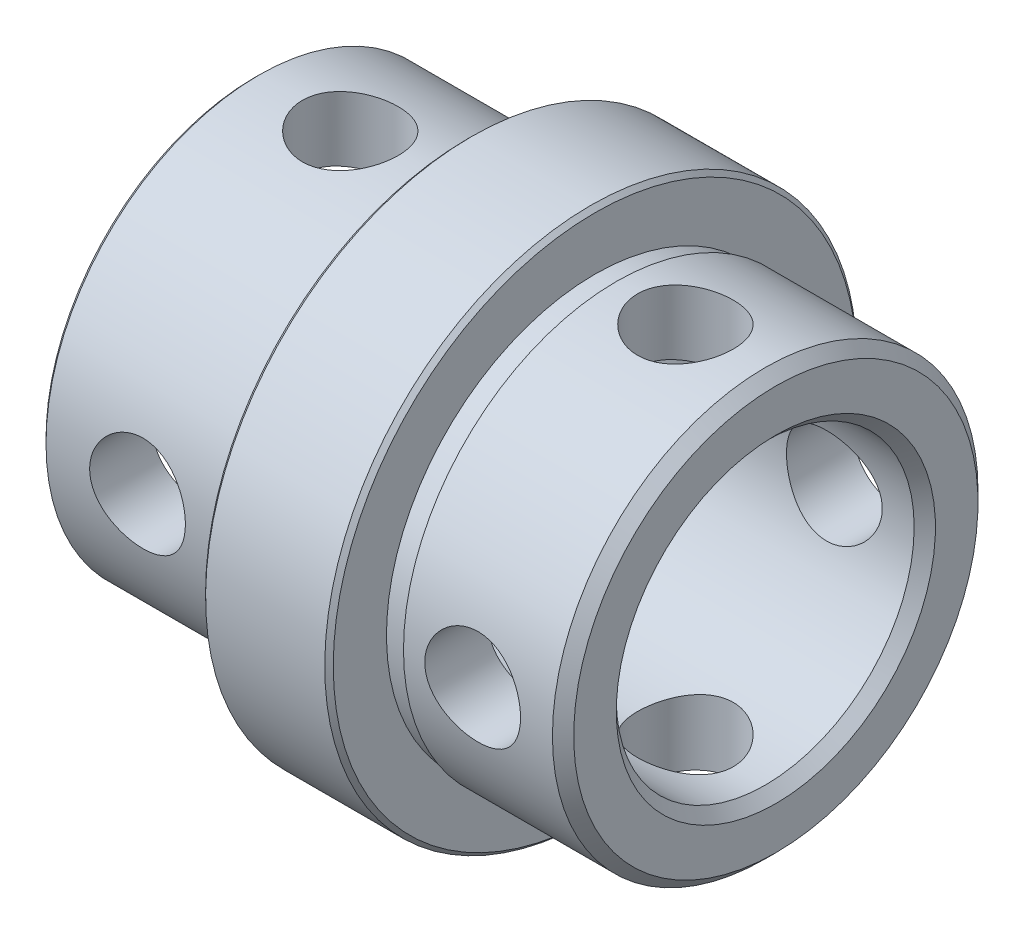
ISO-10303-21;
HEADER;
FILE_DESCRIPTION(('STEP AP214'),'2;1');
FILE_NAME('part.step','',(''),(''),'','','');
FILE_SCHEMA(('AUTOMOTIVE_DESIGN { 1 0 10303 214 1 1 1 1 }'));
ENDSEC;
DATA;
#1=APPLICATION_CONTEXT('core data for automotive mechanical design processes');
#2=APPLICATION_PROTOCOL_DEFINITION('international standard','automotive_design',2000,#1);
#3=PRODUCT_CONTEXT('',#1,'mechanical');
#4=PRODUCT('Part','Part','',(#3));
#5=PRODUCT_RELATED_PRODUCT_CATEGORY('part','',(#4));
#6=PRODUCT_DEFINITION_FORMATION('','',#4);
#7=PRODUCT_DEFINITION_CONTEXT('part definition',#1,'design');
#8=PRODUCT_DEFINITION('design','',#6,#7);
#9=PRODUCT_DEFINITION_SHAPE('','',#8);
#10=(LENGTH_UNIT() NAMED_UNIT(*) SI_UNIT(.MILLI.,.METRE.));
#11=(NAMED_UNIT(*) PLANE_ANGLE_UNIT() SI_UNIT($,.RADIAN.));
#12=(NAMED_UNIT(*) SI_UNIT($,.STERADIAN.) SOLID_ANGLE_UNIT());
#13=UNCERTAINTY_MEASURE_WITH_UNIT(LENGTH_MEASURE(1.E-05),#10,'distance_accuracy_value','');
#14=(GEOMETRIC_REPRESENTATION_CONTEXT(3) GLOBAL_UNCERTAINTY_ASSIGNED_CONTEXT((#13)) GLOBAL_UNIT_ASSIGNED_CONTEXT((#10,
#11,#12)) REPRESENTATION_CONTEXT('',''));
#15=CARTESIAN_POINT('',(0.,0.,0.));
#16=DIRECTION('',(0.,0.,1.));
#17=DIRECTION('',(1.,0.,0.));
#18=AXIS2_PLACEMENT_3D('',#15,#16,#17);
#19=CARTESIAN_POINT('',(-111.2,30.5,-50.5000000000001));
#20=DIRECTION('',(-1.,0.,0.));
#21=DIRECTION('',(0.,0.,1.));
#22=AXIS2_PLACEMENT_3D('',#19,#20,#21);
#23=TOROIDAL_SURFACE('',#22,7.50000000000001,0.5);
#24=CARTESIAN_POINT('',(-111.7,30.5,-50.5000000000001));
#25=DIRECTION('',(-1.,0.,0.));
#26=DIRECTION('',(0.,1.,0.));
#27=AXIS2_PLACEMENT_3D('',#24,#25,#26);
#28=CIRCLE('',#27,7.5);
#29=CARTESIAN_POINT('',(-111.7,38.,-50.5000000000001));
#30=VERTEX_POINT('',#29);
#31=EDGE_CURVE('E45',#30,#30,#28,.T.);
#32=ORIENTED_EDGE('',*,*,#31,.T.);
#33=EDGE_LOOP('',(#32));
#34=FACE_BOUND('',#33,.T.);
#35=CARTESIAN_POINT('',(-111.2,30.5,-50.5000000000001));
#36=DIRECTION('',(-1.,0.,0.));
#37=DIRECTION('',(0.,1.,0.));
#38=AXIS2_PLACEMENT_3D('',#35,#36,#37);
#39=CIRCLE('',#38,7.);
#40=CARTESIAN_POINT('',(-111.2,37.5,-50.5000000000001));
#41=VERTEX_POINT('',#40);
#42=EDGE_CURVE('E294',#41,#41,#39,.T.);
#43=ORIENTED_EDGE('',*,*,#42,.F.);
#44=EDGE_LOOP('',(#43));
#45=FACE_BOUND('',#44,.T.);
#46=ADVANCED_FACE('F12',(#34,#45),#23,.T.);
#47=CARTESIAN_POINT('',(-111.7,39.15,-50.5));
#48=DIRECTION('',(-1.,0.,0.));
#49=DIRECTION('',(0.,0.,1.));
#50=AXIS2_PLACEMENT_3D('',#47,#48,#49);
#51=PLANE('',#50);
#52=CARTESIAN_POINT('',(-111.7,30.5,-50.5000000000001));
#53=DIRECTION('',(-1.,0.,0.));
#54=DIRECTION('',(0.,1.,0.));
#55=AXIS2_PLACEMENT_3D('',#52,#53,#54);
#56=CIRCLE('',#55,9.8);
#57=CARTESIAN_POINT('',(-111.7,40.3,-50.5000000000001));
#58=VERTEX_POINT('',#57);
#59=EDGE_CURVE('E8',#58,#58,#56,.T.);
#60=ORIENTED_EDGE('',*,*,#59,.T.);
#61=EDGE_LOOP('',(#60));
#62=FACE_BOUND('',#61,.T.);
#63=ORIENTED_EDGE('',*,*,#31,.F.);
#64=EDGE_LOOP('',(#63));
#65=FACE_BOUND('',#64,.T.);
#66=ADVANCED_FACE('F64',(#62,#65),#51,.T.);
#67=DIRECTION('',(-0.707106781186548,-0.707106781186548,0.));
#68=VECTOR('',#67,1.);
#69=CARTESIAN_POINT('',(-111.6,40.4,-50.5000000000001));
#70=LINE('',#69,#68);
#71=CARTESIAN_POINT('',(-121.5,30.5,-50.5000000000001));
#72=DIRECTION('',(1.,0.,0.));
#73=AXIS1_PLACEMENT('',#71,#72);
#74=SURFACE_OF_REVOLUTION('',#70,#73);
#75=CARTESIAN_POINT('',(-111.5,30.5,-50.5000000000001));
#76=DIRECTION('',(-1.,0.,0.));
#77=DIRECTION('',(0.,1.,0.));
#78=AXIS2_PLACEMENT_3D('',#75,#76,#77);
#79=CIRCLE('',#78,10.);
#80=CARTESIAN_POINT('',(-111.5,40.5,-50.5000000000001));
#81=VERTEX_POINT('',#80);
#82=EDGE_CURVE('E40',#81,#81,#79,.T.);
#83=ORIENTED_EDGE('',*,*,#82,.T.);
#84=EDGE_LOOP('',(#83));
#85=FACE_BOUND('',#84,.T.);
#86=ORIENTED_EDGE('',*,*,#59,.F.);
#87=EDGE_LOOP('',(#86));
#88=FACE_BOUND('',#87,.T.);
#89=ADVANCED_FACE('F68',(#85,#88),#74,.F.);
#90=CARTESIAN_POINT('',(-102.7,40.4,-50.5000000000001));
#91=DIRECTION('',(1.,0.,0.));
#92=DIRECTION('',(0.,0.,-1.));
#93=AXIS2_PLACEMENT_3D('',#90,#91,#92);
#94=PLANE('',#93);
#95=CARTESIAN_POINT('',(-102.7,30.5,-50.5000000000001));
#96=DIRECTION('',(-1.,0.,0.));
#97=DIRECTION('',(0.,1.,0.));
#98=AXIS2_PLACEMENT_3D('',#95,#96,#97);
#99=CIRCLE('',#98,9.8);
#100=CARTESIAN_POINT('',(-102.7,40.3,-50.5000000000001));
#101=VERTEX_POINT('',#100);
#102=EDGE_CURVE('E27',#101,#101,#99,.T.);
#103=ORIENTED_EDGE('',*,*,#102,.T.);
#104=EDGE_LOOP('',(#103));
#105=FACE_BOUND('',#104,.T.);
#106=CARTESIAN_POINT('',(-102.7,30.5,-50.5000000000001));
#107=DIRECTION('',(-1.,0.,0.));
#108=DIRECTION('',(0.,1.,0.));
#109=AXIS2_PLACEMENT_3D('',#106,#107,#108);
#110=CIRCLE('',#109,10.);
#111=CARTESIAN_POINT('',(-102.7,40.5,-50.5000000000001));
#112=VERTEX_POINT('',#111);
#113=EDGE_CURVE('E274',#112,#112,#110,.T.);
#114=ORIENTED_EDGE('',*,*,#113,.F.);
#115=EDGE_LOOP('',(#114));
#116=FACE_BOUND('',#115,.T.);
#117=ADVANCED_FACE('F71',(#105,#116),#94,.T.);
#118=CARTESIAN_POINT('',(-102.2,30.5,-50.5000000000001));
#119=DIRECTION('',(1.,0.,0.));
#120=DIRECTION('',(0.,0.,-1.));
#121=AXIS2_PLACEMENT_3D('',#118,#119,#120);
#122=CYLINDRICAL_SURFACE('',#121,9.8);
#123=CARTESIAN_POINT('',(-101.7,30.5,-50.5000000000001));
#124=DIRECTION('',(-1.,0.,0.));
#125=DIRECTION('',(0.,1.,0.));
#126=AXIS2_PLACEMENT_3D('',#123,#124,#125);
#127=CIRCLE('',#126,9.8);
#128=CARTESIAN_POINT('',(-101.7,40.3,-50.5000000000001));
#129=VERTEX_POINT('',#128);
#130=EDGE_CURVE('E44',#129,#129,#127,.T.);
#131=ORIENTED_EDGE('',*,*,#130,.T.);
#132=EDGE_LOOP('',(#131));
#133=FACE_BOUND('',#132,.T.);
#134=ORIENTED_EDGE('',*,*,#102,.F.);
#135=EDGE_LOOP('',(#134));
#136=FACE_BOUND('',#135,.T.);
#137=ADVANCED_FACE('F75',(#133,#136),#122,.T.);
#138=CARTESIAN_POINT('',(-101.7,41.55,-50.5));
#139=DIRECTION('',(-1.,0.,0.));
#140=DIRECTION('',(0.,0.,1.));
#141=AXIS2_PLACEMENT_3D('',#138,#139,#140);
#142=PLANE('',#141);
#143=CARTESIAN_POINT('',(-101.7,30.5,-50.5000000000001));
#144=DIRECTION('',(-1.,0.,0.));
#145=DIRECTION('',(0.,1.,0.));
#146=AXIS2_PLACEMENT_3D('',#143,#144,#145);
#147=CIRCLE('',#146,12.3);
#148=CARTESIAN_POINT('',(-101.7,42.8,-50.5000000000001));
#149=VERTEX_POINT('',#148);
#150=EDGE_CURVE('E36',#149,#149,#147,.T.);
#151=ORIENTED_EDGE('',*,*,#150,.T.);
#152=EDGE_LOOP('',(#151));
#153=FACE_BOUND('',#152,.T.);
#154=ORIENTED_EDGE('',*,*,#130,.F.);
#155=EDGE_LOOP('',(#154));
#156=FACE_BOUND('',#155,.T.);
#157=ADVANCED_FACE('F79',(#153,#156),#142,.T.);
#158=DIRECTION('',(-0.707106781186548,-0.707106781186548,0.));
#159=VECTOR('',#158,1.);
#160=CARTESIAN_POINT('',(-101.6,42.9,-50.5000000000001));
#161=LINE('',#160,#159);
#162=CARTESIAN_POINT('',(-114.,30.5,-50.5000000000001));
#163=DIRECTION('',(1.,0.,0.));
#164=AXIS1_PLACEMENT('',#162,#163);
#165=SURFACE_OF_REVOLUTION('',#161,#164);
#166=CARTESIAN_POINT('',(-101.5,30.5,-50.5000000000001));
#167=DIRECTION('',(-1.,0.,0.));
#168=DIRECTION('',(0.,1.,0.));
#169=AXIS2_PLACEMENT_3D('',#166,#167,#168);
#170=CIRCLE('',#169,12.5);
#171=CARTESIAN_POINT('',(-101.5,43.,-50.5000000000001));
#172=VERTEX_POINT('',#171);
#173=EDGE_CURVE('E271',#172,#172,#170,.T.);
#174=ORIENTED_EDGE('',*,*,#173,.T.);
#175=EDGE_LOOP('',(#174));
#176=FACE_BOUND('',#175,.T.);
#177=ORIENTED_EDGE('',*,*,#150,.F.);
#178=EDGE_LOOP('',(#177));
#179=FACE_BOUND('',#178,.T.);
#180=ADVANCED_FACE('F83',(#176,#179),#165,.F.);
#181=CARTESIAN_POINT('',(-98.7,30.5,-50.5000000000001));
#182=DIRECTION('',(1.,0.,0.));
#183=DIRECTION('',(0.,0.,-1.));
#184=AXIS2_PLACEMENT_3D('',#181,#182,#183);
#185=CYLINDRICAL_SURFACE('',#184,12.5);
#186=CARTESIAN_POINT('',(-95.9,30.5,-50.5000000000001));
#187=DIRECTION('',(-1.,0.,0.));
#188=DIRECTION('',(0.,1.,0.));
#189=AXIS2_PLACEMENT_3D('',#186,#187,#188);
#190=CIRCLE('',#189,12.5);
#191=CARTESIAN_POINT('',(-95.9,43.,-50.5000000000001));
#192=VERTEX_POINT('',#191);
#193=EDGE_CURVE('E279',#192,#192,#190,.T.);
#194=ORIENTED_EDGE('',*,*,#193,.T.);
#195=EDGE_LOOP('',(#194));
#196=FACE_BOUND('',#195,.T.);
#197=ORIENTED_EDGE('',*,*,#173,.F.);
#198=EDGE_LOOP('',(#197));
#199=FACE_BOUND('',#198,.T.);
#200=ADVANCED_FACE('F87',(#196,#199),#185,.T.);
#201=DIRECTION('',(0.707106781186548,-0.707106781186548,0.));
#202=VECTOR('',#201,1.);
#203=CARTESIAN_POINT('',(-95.8,42.9,-50.5000000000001));
#204=LINE('',#203,#202);
#205=CARTESIAN_POINT('',(-83.4,30.5,-50.5000000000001));
#206=DIRECTION('',(-1.,0.,0.));
#207=AXIS1_PLACEMENT('',#205,#206);
#208=SURFACE_OF_REVOLUTION('',#204,#207);
#209=CARTESIAN_POINT('',(-95.7,30.5,-50.5000000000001));
#210=DIRECTION('',(-1.,0.,0.));
#211=DIRECTION('',(0.,1.,0.));
#212=AXIS2_PLACEMENT_3D('',#209,#210,#211);
#213=CIRCLE('',#212,12.3);
#214=CARTESIAN_POINT('',(-95.7,42.8,-50.5000000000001));
#215=VERTEX_POINT('',#214);
#216=EDGE_CURVE('E49',#215,#215,#213,.T.);
#217=ORIENTED_EDGE('',*,*,#216,.T.);
#218=EDGE_LOOP('',(#217));
#219=FACE_BOUND('',#218,.T.);
#220=ORIENTED_EDGE('',*,*,#193,.F.);
#221=EDGE_LOOP('',(#220));
#222=FACE_BOUND('',#221,.T.);
#223=ADVANCED_FACE('F96',(#219,#222),#208,.F.);
#224=CARTESIAN_POINT('',(-95.7,41.55,-50.5000000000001));
#225=DIRECTION('',(1.,0.,0.));
#226=DIRECTION('',(0.,0.,-1.));
#227=AXIS2_PLACEMENT_3D('',#224,#225,#226);
#228=PLANE('',#227);
#229=CARTESIAN_POINT('',(-95.7,30.5,-50.5000000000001));
#230=DIRECTION('',(-1.,0.,0.));
#231=DIRECTION('',(0.,1.,0.));
#232=AXIS2_PLACEMENT_3D('',#229,#230,#231);
#233=CIRCLE('',#232,9.8);
#234=CARTESIAN_POINT('',(-95.7,40.3,-50.5000000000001));
#235=VERTEX_POINT('',#234);
#236=EDGE_CURVE('E46',#235,#235,#233,.T.);
#237=ORIENTED_EDGE('',*,*,#236,.T.);
#238=EDGE_LOOP('',(#237));
#239=FACE_BOUND('',#238,.T.);
#240=ORIENTED_EDGE('',*,*,#216,.F.);
#241=EDGE_LOOP('',(#240));
#242=FACE_BOUND('',#241,.T.);
#243=ADVANCED_FACE('F99',(#239,#242),#228,.T.);
#244=CARTESIAN_POINT('',(-95.2000000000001,30.5,-50.5000000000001));
#245=DIRECTION('',(1.,0.,0.));
#246=DIRECTION('',(0.,0.,-1.));
#247=AXIS2_PLACEMENT_3D('',#244,#245,#246);
#248=CYLINDRICAL_SURFACE('',#247,9.8);
#249=CARTESIAN_POINT('',(-94.7,30.5,-50.5000000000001));
#250=DIRECTION('',(-1.,0.,0.));
#251=DIRECTION('',(0.,1.,0.));
#252=AXIS2_PLACEMENT_3D('',#249,#250,#251);
#253=CIRCLE('',#252,9.8);
#254=CARTESIAN_POINT('',(-94.7,40.3,-50.5000000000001));
#255=VERTEX_POINT('',#254);
#256=EDGE_CURVE('E282',#255,#255,#253,.T.);
#257=ORIENTED_EDGE('',*,*,#256,.T.);
#258=EDGE_LOOP('',(#257));
#259=FACE_BOUND('',#258,.T.);
#260=ORIENTED_EDGE('',*,*,#236,.F.);
#261=EDGE_LOOP('',(#260));
#262=FACE_BOUND('',#261,.T.);
#263=ADVANCED_FACE('F103',(#259,#262),#248,.T.);
#264=CARTESIAN_POINT('',(-94.7,40.4,-50.5000000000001));
#265=DIRECTION('',(-1.,0.,0.));
#266=DIRECTION('',(0.,0.,1.));
#267=AXIS2_PLACEMENT_3D('',#264,#265,#266);
#268=PLANE('',#267);
#269=CARTESIAN_POINT('',(-94.7,30.5,-50.5000000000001));
#270=DIRECTION('',(-1.,0.,0.));
#271=DIRECTION('',(0.,1.,0.));
#272=AXIS2_PLACEMENT_3D('',#269,#270,#271);
#273=CIRCLE('',#272,10.);
#274=CARTESIAN_POINT('',(-94.7,40.5,-50.5000000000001));
#275=VERTEX_POINT('',#274);
#276=EDGE_CURVE('E50',#275,#275,#273,.T.);
#277=ORIENTED_EDGE('',*,*,#276,.T.);
#278=EDGE_LOOP('',(#277));
#279=FACE_BOUND('',#278,.T.);
#280=ORIENTED_EDGE('',*,*,#256,.F.);
#281=EDGE_LOOP('',(#280));
#282=FACE_BOUND('',#281,.T.);
#283=ADVANCED_FACE('F107',(#279,#282),#268,.T.);
#284=DIRECTION('',(0.707106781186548,-0.707106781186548,0.));
#285=VECTOR('',#284,1.);
#286=CARTESIAN_POINT('',(-87.4499999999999,40.2500000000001,-50.5000000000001));
#287=LINE('',#286,#285);
#288=CARTESIAN_POINT('',(-77.7,30.5,-50.5000000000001));
#289=DIRECTION('',(-1.,0.,0.));
#290=AXIS1_PLACEMENT('',#288,#289);
#291=SURFACE_OF_REVOLUTION('',#287,#290);
#292=CARTESIAN_POINT('',(-87.2000000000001,30.5,-50.5000000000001));
#293=DIRECTION('',(-1.,0.,0.));
#294=DIRECTION('',(0.,1.,0.));
#295=AXIS2_PLACEMENT_3D('',#292,#293,#294);
#296=CIRCLE('',#295,9.5);
#297=CARTESIAN_POINT('',(-87.2000000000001,40.,-50.5000000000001));
#298=VERTEX_POINT('',#297);
#299=EDGE_CURVE('E285',#298,#298,#296,.T.);
#300=ORIENTED_EDGE('',*,*,#299,.T.);
#301=EDGE_LOOP('',(#300));
#302=FACE_BOUND('',#301,.T.);
#303=CARTESIAN_POINT('',(-87.7,30.5,-50.5000000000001));
#304=DIRECTION('',(-1.,0.,0.));
#305=DIRECTION('',(0.,1.,0.));
#306=AXIS2_PLACEMENT_3D('',#303,#304,#305);
#307=CIRCLE('',#306,10.);
#308=CARTESIAN_POINT('',(-87.7,40.5,-50.5000000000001));
#309=VERTEX_POINT('',#308);
#310=EDGE_CURVE('E253',#309,#309,#307,.T.);
#311=ORIENTED_EDGE('',*,*,#310,.F.);
#312=EDGE_LOOP('',(#311));
#313=FACE_BOUND('',#312,.T.);
#314=ADVANCED_FACE('F111',(#302,#313),#291,.F.);
#315=CARTESIAN_POINT('',(-87.2000000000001,39.,-50.5));
#316=DIRECTION('',(1.,0.,0.));
#317=DIRECTION('',(0.,0.,-1.));
#318=AXIS2_PLACEMENT_3D('',#315,#316,#317);
#319=PLANE('',#318);
#320=CARTESIAN_POINT('',(-87.2000000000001,30.5,-50.5000000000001));
#321=DIRECTION('',(-1.,0.,0.));
#322=DIRECTION('',(0.,1.,0.));
#323=AXIS2_PLACEMENT_3D('',#320,#321,#322);
#324=CIRCLE('',#323,7.5);
#325=CARTESIAN_POINT('',(-87.2000000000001,38.,-50.5000000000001));
#326=VERTEX_POINT('',#325);
#327=EDGE_CURVE('E55',#326,#326,#324,.T.);
#328=ORIENTED_EDGE('',*,*,#327,.T.);
#329=EDGE_LOOP('',(#328));
#330=FACE_BOUND('',#329,.T.);
#331=ORIENTED_EDGE('',*,*,#299,.F.);
#332=EDGE_LOOP('',(#331));
#333=FACE_BOUND('',#332,.T.);
#334=ADVANCED_FACE('F115',(#330,#333),#319,.T.);
#335=DIRECTION('',(0.707106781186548,0.707106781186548,0.));
#336=VECTOR('',#335,1.);
#337=CARTESIAN_POINT('',(-87.4499999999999,37.75,-50.5000000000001));
#338=LINE('',#337,#336);
#339=CARTESIAN_POINT('',(-94.7,30.5,-50.5000000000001));
#340=DIRECTION('',(1.,0.,0.));
#341=AXIS1_PLACEMENT('',#339,#340);
#342=SURFACE_OF_REVOLUTION('',#338,#341);
#343=ORIENTED_EDGE('',*,*,#327,.F.);
#344=EDGE_LOOP('',(#343));
#345=FACE_BOUND('',#344,.T.);
#346=CARTESIAN_POINT('',(-87.7,30.5,-50.5000000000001));
#347=DIRECTION('',(-1.,0.,0.));
#348=DIRECTION('',(0.,1.,0.));
#349=AXIS2_PLACEMENT_3D('',#346,#347,#348);
#350=CIRCLE('',#349,7.);
#351=CARTESIAN_POINT('',(-87.7,37.5,-50.5000000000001));
#352=VERTEX_POINT('',#351);
#353=EDGE_CURVE('E51',#352,#352,#350,.T.);
#354=ORIENTED_EDGE('',*,*,#353,.T.);
#355=EDGE_LOOP('',(#354));
#356=FACE_BOUND('',#355,.T.);
#357=ADVANCED_FACE('F119',(#345,#356),#342,.F.);
#358=CARTESIAN_POINT('',(-107.2,30.5,-50.5000000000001));
#359=DIRECTION('',(0.,1.,0.));
#360=DIRECTION('',(0.,0.,1.));
#361=AXIS2_PLACEMENT_3D('',#358,#359,#360);
#362=CYLINDRICAL_SURFACE('',#361,2.25);
#363=CARTESIAN_POINT('',(-109.45,20.5,-50.5000000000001));
#364=CARTESIAN_POINT('',(-109.449993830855,20.5000032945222,-50.3754368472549));
#365=CARTESIAN_POINT('',(-109.43961086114,20.5023534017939,-50.2507229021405));
#366=CARTESIAN_POINT('',(-109.398368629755,20.5115098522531,-50.004738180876));
#367=CARTESIAN_POINT('',(-109.367469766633,20.5183248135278,-49.8834745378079));
#368=CARTESIAN_POINT('',(-109.286215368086,20.5356520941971,-49.6481376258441));
#369=CARTESIAN_POINT('',(-109.235890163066,20.5461586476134,-49.5340534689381));
#370=CARTESIAN_POINT('',(-109.117295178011,20.5697352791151,-49.3159870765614));
#371=CARTESIAN_POINT('',(-109.04903070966,20.5828045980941,-49.2120018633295));
#372=CARTESIAN_POINT('',(-108.895257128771,20.610328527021,-49.0152689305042));
#373=CARTESIAN_POINT('',(-108.809500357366,20.6248012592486,-48.9227172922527));
#374=CARTESIAN_POINT('',(-108.623703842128,20.6533750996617,-48.7531779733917));
#375=CARTESIAN_POINT('',(-108.523661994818,20.6674761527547,-48.6761925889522));
#376=CARTESIAN_POINT('',(-108.310688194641,20.6938869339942,-48.5391091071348));
#377=CARTESIAN_POINT('',(-108.197618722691,20.7061736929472,-48.4792198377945));
#378=CARTESIAN_POINT('',(-107.962698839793,20.7273059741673,-48.3793695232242));
#379=CARTESIAN_POINT('',(-107.840849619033,20.7361519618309,-48.3394057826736));
#380=CARTESIAN_POINT('',(-107.593945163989,20.7492177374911,-48.2811873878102));
#381=CARTESIAN_POINT('',(-107.468975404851,20.7535110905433,-48.2625871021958));
#382=CARTESIAN_POINT('',(-107.217620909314,20.75720627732,-48.2465485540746));
#383=CARTESIAN_POINT('',(-107.09123635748,20.7566087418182,-48.2491075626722));
#384=CARTESIAN_POINT('',(-106.843225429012,20.7506561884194,-48.2750372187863));
#385=CARTESIAN_POINT('',(-106.721554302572,20.7453934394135,-48.2980042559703));
#386=CARTESIAN_POINT('',(-106.483836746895,20.7308494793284,-48.3634580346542));
#387=CARTESIAN_POINT('',(-106.36779069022,20.7215680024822,-48.4059460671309));
#388=CARTESIAN_POINT('',(-106.143490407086,20.6999423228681,-48.5096026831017));
#389=CARTESIAN_POINT('',(-106.035309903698,20.6875730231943,-48.5709253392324));
#390=CARTESIAN_POINT('',(-105.830633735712,20.6611816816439,-48.7103976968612));
#391=CARTESIAN_POINT('',(-105.734138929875,20.6471595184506,-48.7885486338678));
#392=CARTESIAN_POINT('',(-105.553258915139,20.618649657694,-48.9615720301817));
#393=CARTESIAN_POINT('',(-105.469199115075,20.6041586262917,-49.0567844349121));
#394=CARTESIAN_POINT('',(-105.318149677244,20.5766272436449,-49.2601666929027));
#395=CARTESIAN_POINT('',(-105.251167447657,20.5635875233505,-49.3683421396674));
#396=CARTESIAN_POINT('',(-105.136089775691,20.5403800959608,-49.5950195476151));
#397=CARTESIAN_POINT('',(-105.088054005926,20.5302214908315,-49.7135527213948));
#398=CARTESIAN_POINT('',(-105.012766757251,20.514003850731,-49.9571399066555));
#399=CARTESIAN_POINT('',(-104.985471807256,20.5079362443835,-50.0821796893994));
#400=CARTESIAN_POINT('',(-104.962644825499,20.5028386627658,-50.2568408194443));
#401=CARTESIAN_POINT('',(-104.957907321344,20.5017766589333,-50.3053386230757));
#402=CARTESIAN_POINT('',(-104.951583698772,20.5003566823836,-50.4025499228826));
#403=CARTESIAN_POINT('',(-104.94999758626,20.4999987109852,-50.4512634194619));
#404=CARTESIAN_POINT('',(-104.950006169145,20.5000032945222,-50.6245631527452));
#405=CARTESIAN_POINT('',(-104.96038913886,20.5023534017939,-50.7492770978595));
#406=CARTESIAN_POINT('',(-105.001631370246,20.5115098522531,-50.9952618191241));
#407=CARTESIAN_POINT('',(-105.032530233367,20.5183248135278,-51.1165254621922));
#408=CARTESIAN_POINT('',(-105.113784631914,20.5356520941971,-51.351862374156));
#409=CARTESIAN_POINT('',(-105.164109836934,20.5461586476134,-51.4659465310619));
#410=CARTESIAN_POINT('',(-105.282704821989,20.5697352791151,-51.6840129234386));
#411=CARTESIAN_POINT('',(-105.35096929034,20.5828045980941,-51.7879981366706));
#412=CARTESIAN_POINT('',(-105.504742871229,20.610328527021,-51.9847310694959));
#413=CARTESIAN_POINT('',(-105.590499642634,20.6248012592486,-52.0772827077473));
#414=CARTESIAN_POINT('',(-105.776296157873,20.6533750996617,-52.2468220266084));
#415=CARTESIAN_POINT('',(-105.876338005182,20.6674761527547,-52.3238074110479));
#416=CARTESIAN_POINT('',(-106.089311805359,20.6938869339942,-52.4608908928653));
#417=CARTESIAN_POINT('',(-106.202381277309,20.7061736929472,-52.5207801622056));
#418=CARTESIAN_POINT('',(-106.437301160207,20.7273059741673,-52.6206304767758));
#419=CARTESIAN_POINT('',(-106.559150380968,20.7361519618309,-52.6605942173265));
#420=CARTESIAN_POINT('',(-106.806054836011,20.7492177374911,-52.7188126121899));
#421=CARTESIAN_POINT('',(-106.931024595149,20.7535110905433,-52.7374128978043));
#422=CARTESIAN_POINT('',(-107.182379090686,20.75720627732,-52.7534514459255));
#423=CARTESIAN_POINT('',(-107.30876364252,20.7566087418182,-52.7508924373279));
#424=CARTESIAN_POINT('',(-107.556774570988,20.7506561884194,-52.7249627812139));
#425=CARTESIAN_POINT('',(-107.678445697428,20.7453934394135,-52.7019957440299));
#426=CARTESIAN_POINT('',(-107.916163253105,20.7308494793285,-52.636541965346));
#427=CARTESIAN_POINT('',(-108.03220930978,20.7215680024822,-52.5940539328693));
#428=CARTESIAN_POINT('',(-108.256509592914,20.6999423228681,-52.4903973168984));
#429=CARTESIAN_POINT('',(-108.364690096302,20.6875730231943,-52.4290746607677));
#430=CARTESIAN_POINT('',(-108.569366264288,20.6611816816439,-52.289602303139));
#431=CARTESIAN_POINT('',(-108.665861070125,20.6471595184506,-52.2114513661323));
#432=CARTESIAN_POINT('',(-108.846741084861,20.618649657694,-52.0384279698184));
#433=CARTESIAN_POINT('',(-108.930800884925,20.6041586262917,-51.9432155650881));
#434=CARTESIAN_POINT('',(-109.081850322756,20.5766272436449,-51.7398333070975));
#435=CARTESIAN_POINT('',(-109.148832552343,20.5635875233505,-51.6316578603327));
#436=CARTESIAN_POINT('',(-109.263910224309,20.5403800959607,-51.404980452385));
#437=CARTESIAN_POINT('',(-109.311945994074,20.5302214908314,-51.2864472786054));
#438=CARTESIAN_POINT('',(-109.387233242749,20.514003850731,-51.0428600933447));
#439=CARTESIAN_POINT('',(-109.414528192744,20.5079362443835,-50.9178203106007));
#440=CARTESIAN_POINT('',(-109.437355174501,20.5028386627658,-50.7431591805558));
#441=CARTESIAN_POINT('',(-109.442092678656,20.5017766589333,-50.6946613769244));
#442=CARTESIAN_POINT('',(-109.448416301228,20.5003566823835,-50.5974500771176));
#443=CARTESIAN_POINT('',(-109.45000241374,20.4999987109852,-50.5487365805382));
#444=CARTESIAN_POINT('',(-109.45,20.5,-50.5000000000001));
#445=B_SPLINE_CURVE_WITH_KNOTS('',3,(#363,#364,#365,#366,#367,#368,#369,#370,#371,#372,#373,
#374,#375,#376,#377,#378,#379,#380,#381,#382,#383,#384,#385,#386,#387,#388,#389,#390,#391,#392,
#393,#394,#395,#396,#397,#398,#399,#400,#401,#402,#403,#404,#405,#406,#407,#408,#409,#410,#411,
#412,#413,#414,#415,#416,#417,#418,#419,#420,#421,#422,#423,#424,#425,#426,#427,#428,#429,#430,
#431,#432,#433,#434,#435,#436,#437,#438,#439,#440,#441,#442,#443,#444),.UNSPECIFIED.,.T.,.F.,(4,
2,2,2,2,2,2,2,2,2,2,2,2,2,2,2,2,2,2,2,2,2,2,2,2,2,2,2,2,2,2,2,2,2,2,2,2,2,2,2,4),(0.,
0.373502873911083,0.747728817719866,1.12137282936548,1.49490633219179,1.87414986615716,
2.25344930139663,2.63720091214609,3.02090059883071,3.39830100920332,3.77565274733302,
4.14570368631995,4.51577910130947,4.88896632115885,5.26218094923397,5.64388560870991,
6.02575556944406,6.40881881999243,6.79107696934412,6.93721343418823,7.08335017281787,
7.45685304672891,7.83107899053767,8.20472300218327,8.5782565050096,8.95750003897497,
9.33679947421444,9.72055108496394,10.1042507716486,10.4816511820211,10.8590029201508,
11.2290538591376,11.5991292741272,11.9723164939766,12.3455311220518,12.7272357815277,
13.1091057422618,13.4921689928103,13.874427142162,14.020563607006,14.1667003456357),.UNSPECIFIED.);
#446=CARTESIAN_POINT('',(-109.45,20.5,-50.5000000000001));
#447=VERTEX_POINT('',#446);
#448=EDGE_CURVE('E136',#447,#447,#445,.T.);
#449=ORIENTED_EDGE('',*,*,#448,.F.);
#450=EDGE_LOOP('',(#449));
#451=FACE_BOUND('',#450,.T.);
#452=CARTESIAN_POINT('',(-107.2,23.8714632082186,-48.2500000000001));
#453=CARTESIAN_POINT('',(-107.322749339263,23.8714587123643,-48.2500053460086));
#454=CARTESIAN_POINT('',(-107.445561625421,23.8680132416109,-48.2600859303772));
#455=CARTESIAN_POINT('',(-107.687621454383,23.854654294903,-48.3000444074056));
#456=CARTESIAN_POINT('',(-107.80686560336,23.844734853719,-48.3299405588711));
#457=CARTESIAN_POINT('',(-108.038161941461,23.8196697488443,-48.4083819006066));
#458=CARTESIAN_POINT('',(-108.150228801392,23.8045351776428,-48.4568875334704));
#459=CARTESIAN_POINT('',(-108.364647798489,23.770759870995,-48.5710478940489));
#460=CARTESIAN_POINT('',(-108.466999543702,23.7521189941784,-48.6367033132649));
#461=CARTESIAN_POINT('',(-108.662825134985,23.7126701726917,-48.7858572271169));
#462=CARTESIAN_POINT('',(-108.755895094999,23.6918110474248,-48.8698725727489));
#463=CARTESIAN_POINT('',(-108.926915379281,23.6507058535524,-49.0522782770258));
#464=CARTESIAN_POINT('',(-109.004860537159,23.6304599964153,-49.1506735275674));
#465=CARTESIAN_POINT('',(-109.145226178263,23.592270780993,-49.361986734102));
#466=CARTESIAN_POINT('',(-109.207220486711,23.5743958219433,-49.4752009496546));
#467=CARTESIAN_POINT('',(-109.311072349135,23.5435893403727,-49.7110559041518));
#468=CARTESIAN_POINT('',(-109.352953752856,23.530651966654,-49.8336852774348));
#469=CARTESIAN_POINT('',(-109.405883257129,23.5140849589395,-50.047387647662));
#470=CARTESIAN_POINT('',(-109.422394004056,23.5088322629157,-50.1370195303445));
#471=CARTESIAN_POINT('',(-109.444453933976,23.5017885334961,-50.3177562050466));
#472=CARTESIAN_POINT('',(-109.450003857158,23.4999972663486,-50.4088608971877));
#473=CARTESIAN_POINT('',(-109.449994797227,23.5000036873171,-50.622934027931));
#474=CARTESIAN_POINT('',(-109.439884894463,23.5032714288,-50.7459306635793));
#475=CARTESIAN_POINT('',(-109.399799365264,23.5159991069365,-50.9883742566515));
#476=CARTESIAN_POINT('',(-109.369806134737,23.5254645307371,-51.1078179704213));
#477=CARTESIAN_POINT('',(-109.29108170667,23.5495519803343,-51.3395364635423));
#478=CARTESIAN_POINT('',(-109.24238591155,23.5641642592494,-51.4518243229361));
#479=CARTESIAN_POINT('',(-109.127775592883,23.5970430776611,-51.6666226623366));
#480=CARTESIAN_POINT('',(-109.061860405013,23.6153097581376,-51.7691327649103));
#481=CARTESIAN_POINT('',(-108.912423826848,23.6542312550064,-51.9648213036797));
#482=CARTESIAN_POINT('',(-108.828442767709,23.6749403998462,-52.0576378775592));
#483=CARTESIAN_POINT('',(-108.646235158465,23.7161050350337,-52.2281429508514));
#484=CARTESIAN_POINT('',(-108.548005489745,23.7365604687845,-52.3058281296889));
#485=CARTESIAN_POINT('',(-108.336912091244,23.7754890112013,-52.4458641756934));
#486=CARTESIAN_POINT('',(-108.223730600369,23.7938955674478,-52.507756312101));
#487=CARTESIAN_POINT('',(-107.987878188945,23.8258231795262,-52.6114758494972));
#488=CARTESIAN_POINT('',(-107.865209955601,23.8393456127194,-52.6533089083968));
#489=CARTESIAN_POINT('',(-107.617955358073,23.8594051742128,-52.7143872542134));
#490=CARTESIAN_POINT('',(-107.493552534,23.8661498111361,-52.7343054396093));
#491=CARTESIAN_POINT('',(-107.243001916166,23.8725052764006,-52.7530914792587));
#492=CARTESIAN_POINT('',(-107.116854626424,23.8721181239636,-52.751965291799));
#493=CARTESIAN_POINT('',(-106.872034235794,23.8644363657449,-52.7292192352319));
#494=CARTESIAN_POINT('',(-106.753270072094,23.8574332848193,-52.7084642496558));
#495=CARTESIAN_POINT('',(-106.521007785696,23.8377837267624,-52.6484554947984));
#496=CARTESIAN_POINT('',(-106.407510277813,23.8251365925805,-52.6091995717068));
#497=CARTESIAN_POINT('',(-106.18698095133,23.7954068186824,-52.5127103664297));
#498=CARTESIAN_POINT('',(-106.080074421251,23.7782593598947,-52.4552115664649));
#499=CARTESIAN_POINT('',(-105.87715388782,23.7414908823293,-52.3240564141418));
#500=CARTESIAN_POINT('',(-105.781142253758,23.721869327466,-52.2503965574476));
#501=CARTESIAN_POINT('',(-105.597867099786,23.681205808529,-52.0848169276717));
#502=CARTESIAN_POINT('',(-105.511247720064,23.660140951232,-51.9921885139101));
#503=CARTESIAN_POINT('',(-105.354579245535,23.6197869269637,-51.7934211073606));
#504=CARTESIAN_POINT('',(-105.284537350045,23.6004985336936,-51.6872762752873));
#505=CARTESIAN_POINT('',(-105.162538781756,23.5656442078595,-51.4631642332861));
#506=CARTESIAN_POINT('',(-105.11075753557,23.5501148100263,-51.3450956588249));
#507=CARTESIAN_POINT('',(-105.028075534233,23.524816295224,-51.1014369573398));
#508=CARTESIAN_POINT('',(-104.997131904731,23.5150353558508,-50.9758628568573));
#509=CARTESIAN_POINT('',(-104.968126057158,23.5058091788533,-50.7909523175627));
#510=CARTESIAN_POINT('',(-104.961336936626,23.5036370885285,-50.7330011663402));
#511=CARTESIAN_POINT('',(-104.95227227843,23.5007313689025,-50.6167097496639));
#512=CARTESIAN_POINT('',(-104.949996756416,23.4999977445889,-50.5583694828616));
#513=CARTESIAN_POINT('',(-104.950006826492,23.5000047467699,-50.3771547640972));
#514=CARTESIAN_POINT('',(-104.960107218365,23.5032689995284,-50.2541801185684));
#515=CARTESIAN_POINT('',(-105.000175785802,23.5159911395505,-50.0117128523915));
#516=CARTESIAN_POINT('',(-105.030177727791,23.5254595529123,-49.8922265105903));
#517=CARTESIAN_POINT('',(-105.108922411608,23.5495532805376,-49.6604544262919));
#518=CARTESIAN_POINT('',(-105.157624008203,23.5641672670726,-49.5481535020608));
#519=CARTESIAN_POINT('',(-105.272237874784,23.5970467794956,-49.3333556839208));
#520=CARTESIAN_POINT('',(-105.338147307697,23.6153117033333,-49.2308571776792));
#521=CARTESIAN_POINT('',(-105.48756804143,23.6542292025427,-49.0351893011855));
#522=CARTESIAN_POINT('',(-105.571538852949,23.6749360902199,-48.9423816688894));
#523=CARTESIAN_POINT('',(-105.753745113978,23.7161007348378,-48.7718731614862));
#524=CARTESIAN_POINT('',(-105.85198664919,23.7365583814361,-48.6941787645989));
#525=CARTESIAN_POINT('',(-106.063135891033,23.7754985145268,-48.5541022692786));
#526=CARTESIAN_POINT('',(-106.176365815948,23.7939134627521,-48.492185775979));
#527=CARTESIAN_POINT('',(-106.412251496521,23.8258359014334,-48.3884826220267));
#528=CARTESIAN_POINT('',(-106.534895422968,23.8393494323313,-48.3466711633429));
#529=CARTESIAN_POINT('',(-106.748419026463,23.8566804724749,-48.2939148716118));
#530=CARTESIAN_POINT('',(-106.83784231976,23.8621885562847,-48.277480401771));
#531=CARTESIAN_POINT('',(-107.018165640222,23.8695814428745,-48.2555214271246));
#532=CARTESIAN_POINT('',(-107.109065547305,23.8714665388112,-48.2499960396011));
#533=CARTESIAN_POINT('',(-107.2,23.8714632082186,-48.2500000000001));
#534=B_SPLINE_CURVE_WITH_KNOTS('',3,(#452,#453,#454,#455,#456,#457,#458,#459,#460,#461,#462,
#463,#464,#465,#466,#467,#468,#469,#470,#471,#472,#473,#474,#475,#476,#477,#478,#479,#480,#481,
#482,#483,#484,#485,#486,#487,#488,#489,#490,#491,#492,#493,#494,#495,#496,#497,#498,#499,#500,
#501,#502,#503,#504,#505,#506,#507,#508,#509,#510,#511,#512,#513,#514,#515,#516,#517,#518,#519,
#520,#521,#522,#523,#524,#525,#526,#527,#528,#529,#530,#531,#532,#533),.UNSPECIFIED.,.T.,.F.,(4,
2,2,2,2,2,2,2,2,2,2,2,2,2,2,2,2,2,2,2,2,2,2,2,2,2,2,2,2,2,2,2,2,2,2,2,2,2,2,2,4),(0.,
0.367905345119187,0.736150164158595,1.10361651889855,1.47109769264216,1.85069291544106,
2.23041757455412,2.61942651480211,3.00797302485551,3.28115564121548,3.55431980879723,
3.92278044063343,4.29156773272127,4.65966035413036,5.02776717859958,5.40667010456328,
5.78565608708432,6.17464264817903,6.56351942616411,6.94009019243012,7.31655434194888,
7.67716745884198,8.0378225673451,8.40398825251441,8.77023341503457,9.15411985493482,
9.53817270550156,9.92582053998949,10.3126683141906,10.4876692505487,10.6626707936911,
11.0309815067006,11.3999187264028,11.7680487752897,12.136118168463,12.5149816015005,
12.894007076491,13.283179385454,13.6718704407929,13.9444419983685,14.2169914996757),.UNSPECIFIED.);
#535=CARTESIAN_POINT('',(-107.2,23.8714632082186,-48.2500000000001));
#536=VERTEX_POINT('',#535);
#537=EDGE_CURVE('E207',#536,#536,#534,.T.);
#538=ORIENTED_EDGE('',*,*,#537,.F.);
#539=EDGE_LOOP('',(#538));
#540=FACE_BOUND('',#539,.T.);
#541=ADVANCED_FACE('F122',(#451,#540),#362,.F.);
#542=CARTESIAN_POINT('',(-107.2,30.5,-50.5000000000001));
#543=DIRECTION('',(0.,1.,0.));
#544=DIRECTION('',(0.,0.,1.));
#545=AXIS2_PLACEMENT_3D('',#542,#543,#544);
#546=CYLINDRICAL_SURFACE('',#545,2.25);
#547=CARTESIAN_POINT('',(-107.2,37.1285367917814,-48.25));
#548=CARTESIAN_POINT('',(-107.077250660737,37.1285412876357,-48.2500053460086));
#549=CARTESIAN_POINT('',(-106.954438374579,37.1319867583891,-48.2600859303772));
#550=CARTESIAN_POINT('',(-106.712378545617,37.145345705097,-48.3000444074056));
#551=CARTESIAN_POINT('',(-106.59313439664,37.155265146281,-48.3299405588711));
#552=CARTESIAN_POINT('',(-106.361838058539,37.1803302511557,-48.4083819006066));
#553=CARTESIAN_POINT('',(-106.249771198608,37.1954648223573,-48.4568875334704));
#554=CARTESIAN_POINT('',(-106.035352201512,37.2292401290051,-48.5710478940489));
#555=CARTESIAN_POINT('',(-105.933000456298,37.2478810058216,-48.6367033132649));
#556=CARTESIAN_POINT('',(-105.737174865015,37.2873298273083,-48.7858572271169));
#557=CARTESIAN_POINT('',(-105.644104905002,37.3081889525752,-48.8698725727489));
#558=CARTESIAN_POINT('',(-105.473084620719,37.3492941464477,-49.0522782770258));
#559=CARTESIAN_POINT('',(-105.395139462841,37.3695400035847,-49.1506735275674));
#560=CARTESIAN_POINT('',(-105.254773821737,37.4077292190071,-49.361986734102));
#561=CARTESIAN_POINT('',(-105.192779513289,37.4256041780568,-49.4752009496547));
#562=CARTESIAN_POINT('',(-105.088927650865,37.4564106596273,-49.7110559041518));
#563=CARTESIAN_POINT('',(-105.047046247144,37.469348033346,-49.8336852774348));
#564=CARTESIAN_POINT('',(-104.994116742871,37.4859150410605,-50.047387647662));
#565=CARTESIAN_POINT('',(-104.977605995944,37.4911677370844,-50.1370195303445));
#566=CARTESIAN_POINT('',(-104.955546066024,37.4982114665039,-50.3177562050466));
#567=CARTESIAN_POINT('',(-104.949996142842,37.5000027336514,-50.4088608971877));
#568=CARTESIAN_POINT('',(-104.950005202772,37.4999963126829,-50.622934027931));
#569=CARTESIAN_POINT('',(-104.960115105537,37.4967285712,-50.7459306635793));
#570=CARTESIAN_POINT('',(-105.000200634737,37.4840008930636,-50.9883742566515));
#571=CARTESIAN_POINT('',(-105.030193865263,37.4745354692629,-51.1078179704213));
#572=CARTESIAN_POINT('',(-105.10891829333,37.4504480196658,-51.3395364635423));
#573=CARTESIAN_POINT('',(-105.15761408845,37.4358357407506,-51.4518243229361));
#574=CARTESIAN_POINT('',(-105.272224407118,37.4029569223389,-51.6666226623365));
#575=CARTESIAN_POINT('',(-105.338139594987,37.3846902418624,-51.7691327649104));
#576=CARTESIAN_POINT('',(-105.487576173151,37.3457687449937,-51.9648213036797));
#577=CARTESIAN_POINT('',(-105.571557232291,37.3250596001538,-52.0576378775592));
#578=CARTESIAN_POINT('',(-105.753764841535,37.2838949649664,-52.2281429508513));
#579=CARTESIAN_POINT('',(-105.851994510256,37.2634395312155,-52.3058281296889));
#580=CARTESIAN_POINT('',(-106.063087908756,37.2245109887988,-52.4458641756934));
#581=CARTESIAN_POINT('',(-106.176269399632,37.2061044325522,-52.507756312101));
#582=CARTESIAN_POINT('',(-106.412121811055,37.1741768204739,-52.6114758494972));
#583=CARTESIAN_POINT('',(-106.534790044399,37.1606543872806,-52.6533089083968));
#584=CARTESIAN_POINT('',(-106.782044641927,37.1405948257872,-52.7143872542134));
#585=CARTESIAN_POINT('',(-106.906447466,37.1338501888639,-52.7343054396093));
#586=CARTESIAN_POINT('',(-107.156998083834,37.1274947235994,-52.7530914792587));
#587=CARTESIAN_POINT('',(-107.283145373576,37.1278818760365,-52.751965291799));
#588=CARTESIAN_POINT('',(-107.527965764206,37.1355636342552,-52.7292192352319));
#589=CARTESIAN_POINT('',(-107.646729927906,37.1425667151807,-52.7084642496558));
#590=CARTESIAN_POINT('',(-107.878992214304,37.1622162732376,-52.6484554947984));
#591=CARTESIAN_POINT('',(-107.992489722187,37.1748634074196,-52.6091995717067));
#592=CARTESIAN_POINT('',(-108.21301904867,37.2045931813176,-52.5127103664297));
#593=CARTESIAN_POINT('',(-108.319925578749,37.2217406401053,-52.455211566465));
#594=CARTESIAN_POINT('',(-108.52284611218,37.2585091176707,-52.3240564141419));
#595=CARTESIAN_POINT('',(-108.618857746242,37.2781306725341,-52.2503965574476));
#596=CARTESIAN_POINT('',(-108.802132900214,37.318794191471,-52.0848169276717));
#597=CARTESIAN_POINT('',(-108.888752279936,37.339859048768,-51.9921885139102));
#598=CARTESIAN_POINT('',(-109.045420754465,37.3802130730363,-51.7934211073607));
#599=CARTESIAN_POINT('',(-109.115462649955,37.3995014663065,-51.6872762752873));
#600=CARTESIAN_POINT('',(-109.237461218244,37.4343557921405,-51.4631642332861));
#601=CARTESIAN_POINT('',(-109.28924246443,37.4498851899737,-51.345095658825));
#602=CARTESIAN_POINT('',(-109.371924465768,37.475183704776,-51.1014369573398));
#603=CARTESIAN_POINT('',(-109.402868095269,37.4849646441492,-50.9758628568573));
#604=CARTESIAN_POINT('',(-109.431873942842,37.4941908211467,-50.7909523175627));
#605=CARTESIAN_POINT('',(-109.438663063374,37.4963629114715,-50.7330011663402));
#606=CARTESIAN_POINT('',(-109.44772772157,37.4992686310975,-50.6167097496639));
#607=CARTESIAN_POINT('',(-109.450003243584,37.5000022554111,-50.5583694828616));
#608=CARTESIAN_POINT('',(-109.449993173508,37.4999952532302,-50.3771547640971));
#609=CARTESIAN_POINT('',(-109.439892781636,37.4967310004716,-50.2541801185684));
#610=CARTESIAN_POINT('',(-109.399824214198,37.4840088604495,-50.0117128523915));
#611=CARTESIAN_POINT('',(-109.369822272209,37.4745404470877,-49.8922265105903));
#612=CARTESIAN_POINT('',(-109.291077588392,37.4504467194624,-49.6604544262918));
#613=CARTESIAN_POINT('',(-109.242375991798,37.4358327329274,-49.5481535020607));
#614=CARTESIAN_POINT('',(-109.127762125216,37.4029532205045,-49.3333556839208));
#615=CARTESIAN_POINT('',(-109.061852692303,37.3846882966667,-49.2308571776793));
#616=CARTESIAN_POINT('',(-108.91243195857,37.3457707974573,-49.0351893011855));
#617=CARTESIAN_POINT('',(-108.828461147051,37.3250639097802,-48.9423816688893));
#618=CARTESIAN_POINT('',(-108.646254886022,37.2838992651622,-48.7718731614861));
#619=CARTESIAN_POINT('',(-108.54801335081,37.2634416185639,-48.6941787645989));
#620=CARTESIAN_POINT('',(-108.336864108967,37.2245014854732,-48.5541022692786));
#621=CARTESIAN_POINT('',(-108.223634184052,37.206086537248,-48.492185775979));
#622=CARTESIAN_POINT('',(-107.987748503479,37.1741640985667,-48.3884826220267));
#623=CARTESIAN_POINT('',(-107.865104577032,37.1606505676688,-48.346671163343));
#624=CARTESIAN_POINT('',(-107.651580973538,37.1433195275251,-48.2939148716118));
#625=CARTESIAN_POINT('',(-107.56215768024,37.1378114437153,-48.277480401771));
#626=CARTESIAN_POINT('',(-107.381834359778,37.1304185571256,-48.2555214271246));
#627=CARTESIAN_POINT('',(-107.290934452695,37.1285334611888,-48.2499960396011));
#628=CARTESIAN_POINT('',(-107.2,37.1285367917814,-48.25));
#629=B_SPLINE_CURVE_WITH_KNOTS('',3,(#547,#548,#549,#550,#551,#552,#553,#554,#555,#556,#557,
#558,#559,#560,#561,#562,#563,#564,#565,#566,#567,#568,#569,#570,#571,#572,#573,#574,#575,#576,
#577,#578,#579,#580,#581,#582,#583,#584,#585,#586,#587,#588,#589,#590,#591,#592,#593,#594,#595,
#596,#597,#598,#599,#600,#601,#602,#603,#604,#605,#606,#607,#608,#609,#610,#611,#612,#613,#614,
#615,#616,#617,#618,#619,#620,#621,#622,#623,#624,#625,#626,#627,#628),.UNSPECIFIED.,.T.,.F.,(4,
2,2,2,2,2,2,2,2,2,2,2,2,2,2,2,2,2,2,2,2,2,2,2,2,2,2,2,2,2,2,2,2,2,2,2,2,2,2,2,4),(0.,
0.367905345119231,0.736150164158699,1.1036165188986,1.47109769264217,1.85069291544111,
2.23041757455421,2.6194265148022,3.0079730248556,3.28115564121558,3.55431980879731,
3.9227804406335,4.29156773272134,4.6596603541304,5.02776717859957,5.40667010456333,
5.78565608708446,6.17464264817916,6.56351942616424,6.94009019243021,7.3165543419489,
7.67716745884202,8.03782256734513,8.40398825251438,8.77023341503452,9.15411985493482,
9.5381727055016,9.92582053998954,10.3126683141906,10.4876692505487,10.6626707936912,
11.0309815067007,11.3999187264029,11.7680487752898,12.1361181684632,12.5149816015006,
12.894007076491,13.2831793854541,13.671870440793,13.9444419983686,14.2169914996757),.UNSPECIFIED.);
#630=CARTESIAN_POINT('',(-107.2,37.1285367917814,-48.25));
#631=VERTEX_POINT('',#630);
#632=EDGE_CURVE('E211',#631,#631,#629,.T.);
#633=ORIENTED_EDGE('',*,*,#632,.F.);
#634=EDGE_LOOP('',(#633));
#635=FACE_BOUND('',#634,.T.);
#636=CARTESIAN_POINT('',(-109.45,40.5,-50.5000000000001));
#637=CARTESIAN_POINT('',(-109.449993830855,40.4999967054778,-50.6245631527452));
#638=CARTESIAN_POINT('',(-109.43961086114,40.4976465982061,-50.7492770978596));
#639=CARTESIAN_POINT('',(-109.398368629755,40.488490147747,-50.9952618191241));
#640=CARTESIAN_POINT('',(-109.367469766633,40.4816751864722,-51.1165254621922));
#641=CARTESIAN_POINT('',(-109.286215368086,40.464347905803,-51.351862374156));
#642=CARTESIAN_POINT('',(-109.235890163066,40.4538413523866,-51.465946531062));
#643=CARTESIAN_POINT('',(-109.117295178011,40.430264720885,-51.6840129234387));
#644=CARTESIAN_POINT('',(-109.04903070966,40.4171954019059,-51.7879981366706));
#645=CARTESIAN_POINT('',(-108.895257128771,40.389671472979,-51.9847310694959));
#646=CARTESIAN_POINT('',(-108.809500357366,40.3751987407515,-52.0772827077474));
#647=CARTESIAN_POINT('',(-108.623703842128,40.3466249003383,-52.2468220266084));
#648=CARTESIAN_POINT('',(-108.523661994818,40.3325238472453,-52.3238074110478));
#649=CARTESIAN_POINT('',(-108.310688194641,40.3061130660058,-52.4608908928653));
#650=CARTESIAN_POINT('',(-108.197618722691,40.2938263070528,-52.5207801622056));
#651=CARTESIAN_POINT('',(-107.962698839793,40.2726940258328,-52.6206304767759));
#652=CARTESIAN_POINT('',(-107.840849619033,40.2638480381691,-52.6605942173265));
#653=CARTESIAN_POINT('',(-107.593945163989,40.2507822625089,-52.7188126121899));
#654=CARTESIAN_POINT('',(-107.468975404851,40.2464889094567,-52.7374128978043));
#655=CARTESIAN_POINT('',(-107.217620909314,40.24279372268,-52.7534514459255));
#656=CARTESIAN_POINT('',(-107.09123635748,40.2433912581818,-52.750892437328));
#657=CARTESIAN_POINT('',(-106.843225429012,40.2493438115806,-52.7249627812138));
#658=CARTESIAN_POINT('',(-106.721554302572,40.2546065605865,-52.7019957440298));
#659=CARTESIAN_POINT('',(-106.483836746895,40.2691505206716,-52.6365419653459));
#660=CARTESIAN_POINT('',(-106.36779069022,40.2784319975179,-52.5940539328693));
#661=CARTESIAN_POINT('',(-106.143490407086,40.300057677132,-52.4903973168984));
#662=CARTESIAN_POINT('',(-106.035309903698,40.3124269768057,-52.4290746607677));
#663=CARTESIAN_POINT('',(-105.830633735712,40.3388183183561,-52.2896023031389));
#664=CARTESIAN_POINT('',(-105.734138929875,40.3528404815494,-52.2114513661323));
#665=CARTESIAN_POINT('',(-105.553258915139,40.381350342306,-52.0384279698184));
#666=CARTESIAN_POINT('',(-105.469199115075,40.3958413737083,-51.943215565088));
#667=CARTESIAN_POINT('',(-105.318149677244,40.4233727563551,-51.7398333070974));
#668=CARTESIAN_POINT('',(-105.251167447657,40.4364124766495,-51.6316578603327));
#669=CARTESIAN_POINT('',(-105.136089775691,40.4596199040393,-51.404980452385));
#670=CARTESIAN_POINT('',(-105.088054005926,40.4697785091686,-51.2864472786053));
#671=CARTESIAN_POINT('',(-105.012766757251,40.485996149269,-51.0428600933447));
#672=CARTESIAN_POINT('',(-104.985471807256,40.4920637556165,-50.9178203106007));
#673=CARTESIAN_POINT('',(-104.962644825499,40.4971613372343,-50.7431591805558));
#674=CARTESIAN_POINT('',(-104.957907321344,40.4982233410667,-50.6946613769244));
#675=CARTESIAN_POINT('',(-104.951583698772,40.4996433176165,-50.5974500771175));
#676=CARTESIAN_POINT('',(-104.94999758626,40.5000012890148,-50.5487365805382));
#677=CARTESIAN_POINT('',(-104.950006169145,40.4999967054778,-50.3754368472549));
#678=CARTESIAN_POINT('',(-104.96038913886,40.4976465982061,-50.2507229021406));
#679=CARTESIAN_POINT('',(-105.001631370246,40.488490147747,-50.004738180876));
#680=CARTESIAN_POINT('',(-105.032530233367,40.4816751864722,-49.8834745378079));
#681=CARTESIAN_POINT('',(-105.113784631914,40.464347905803,-49.6481376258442));
#682=CARTESIAN_POINT('',(-105.164109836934,40.4538413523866,-49.5340534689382));
#683=CARTESIAN_POINT('',(-105.282704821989,40.430264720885,-49.3159870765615));
#684=CARTESIAN_POINT('',(-105.35096929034,40.4171954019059,-49.2120018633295));
#685=CARTESIAN_POINT('',(-105.504742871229,40.389671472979,-49.0152689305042));
#686=CARTESIAN_POINT('',(-105.590499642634,40.3751987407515,-48.9227172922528));
#687=CARTESIAN_POINT('',(-105.776296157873,40.3466249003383,-48.7531779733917));
#688=CARTESIAN_POINT('',(-105.876338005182,40.3325238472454,-48.6761925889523));
#689=CARTESIAN_POINT('',(-106.089311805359,40.3061130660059,-48.5391091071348));
#690=CARTESIAN_POINT('',(-106.202381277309,40.2938263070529,-48.4792198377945));
#691=CARTESIAN_POINT('',(-106.437301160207,40.2726940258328,-48.3793695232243));
#692=CARTESIAN_POINT('',(-106.559150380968,40.2638480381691,-48.3394057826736));
#693=CARTESIAN_POINT('',(-106.806054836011,40.2507822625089,-48.2811873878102));
#694=CARTESIAN_POINT('',(-106.931024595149,40.2464889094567,-48.2625871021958));
#695=CARTESIAN_POINT('',(-107.182379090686,40.24279372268,-48.2465485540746));
#696=CARTESIAN_POINT('',(-107.30876364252,40.2433912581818,-48.2491075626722));
#697=CARTESIAN_POINT('',(-107.556774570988,40.2493438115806,-48.2750372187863));
#698=CARTESIAN_POINT('',(-107.678445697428,40.2546065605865,-48.2980042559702));
#699=CARTESIAN_POINT('',(-107.916163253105,40.2691505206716,-48.3634580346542));
#700=CARTESIAN_POINT('',(-108.03220930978,40.2784319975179,-48.4059460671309));
#701=CARTESIAN_POINT('',(-108.256509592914,40.300057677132,-48.5096026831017));
#702=CARTESIAN_POINT('',(-108.364690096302,40.3124269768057,-48.5709253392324));
#703=CARTESIAN_POINT('',(-108.569366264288,40.3388183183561,-48.7103976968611));
#704=CARTESIAN_POINT('',(-108.665861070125,40.3528404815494,-48.7885486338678));
#705=CARTESIAN_POINT('',(-108.846741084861,40.381350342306,-48.9615720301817));
#706=CARTESIAN_POINT('',(-108.930800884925,40.3958413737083,-49.056784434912));
#707=CARTESIAN_POINT('',(-109.081850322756,40.4233727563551,-49.2601666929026));
#708=CARTESIAN_POINT('',(-109.148832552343,40.4364124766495,-49.3683421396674));
#709=CARTESIAN_POINT('',(-109.263910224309,40.4596199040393,-49.5950195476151));
#710=CARTESIAN_POINT('',(-109.311945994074,40.4697785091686,-49.7135527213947));
#711=CARTESIAN_POINT('',(-109.387233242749,40.485996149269,-49.9571399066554));
#712=CARTESIAN_POINT('',(-109.414528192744,40.4920637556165,-50.0821796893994));
#713=CARTESIAN_POINT('',(-109.437355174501,40.4971613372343,-50.2568408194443));
#714=CARTESIAN_POINT('',(-109.442092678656,40.4982233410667,-50.3053386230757));
#715=CARTESIAN_POINT('',(-109.448416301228,40.4996433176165,-50.4025499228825));
#716=CARTESIAN_POINT('',(-109.45000241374,40.5000012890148,-50.4512634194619));
#717=CARTESIAN_POINT('',(-109.45,40.5,-50.5000000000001));
#718=B_SPLINE_CURVE_WITH_KNOTS('',3,(#636,#637,#638,#639,#640,#641,#642,#643,#644,#645,#646,
#647,#648,#649,#650,#651,#652,#653,#654,#655,#656,#657,#658,#659,#660,#661,#662,#663,#664,#665,
#666,#667,#668,#669,#670,#671,#672,#673,#674,#675,#676,#677,#678,#679,#680,#681,#682,#683,#684,
#685,#686,#687,#688,#689,#690,#691,#692,#693,#694,#695,#696,#697,#698,#699,#700,#701,#702,#703,
#704,#705,#706,#707,#708,#709,#710,#711,#712,#713,#714,#715,#716,#717),.UNSPECIFIED.,.T.,.F.,(4,
2,2,2,2,2,2,2,2,2,2,2,2,2,2,2,2,2,2,2,2,2,2,2,2,2,2,2,2,2,2,2,2,2,2,2,2,2,2,2,4),(0.,
0.373502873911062,0.747728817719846,1.12137282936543,1.49490633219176,1.87414986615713,
2.2534493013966,2.63720091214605,3.02090059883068,3.39830100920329,3.77565274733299,
4.14570368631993,4.51577910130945,4.88896632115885,5.26218094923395,5.6438856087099,
6.02575556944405,6.40881881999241,6.79107696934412,6.93721343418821,7.08335017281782,
7.45685304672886,7.83107899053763,8.20472300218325,8.57825650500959,8.95750003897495,
9.33679947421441,9.72055108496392,10.1042507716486,10.4816511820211,10.8590029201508,
11.2290538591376,11.5991292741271,11.9723164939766,12.3455311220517,12.7272357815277,
13.1091057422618,13.4921689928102,13.8744271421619,14.020563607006,14.1667003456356),.UNSPECIFIED.);
#719=CARTESIAN_POINT('',(-109.45,40.5,-50.5000000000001));
#720=VERTEX_POINT('',#719);
#721=EDGE_CURVE('E17',#720,#720,#718,.T.);
#722=ORIENTED_EDGE('',*,*,#721,.F.);
#723=EDGE_LOOP('',(#722));
#724=FACE_BOUND('',#723,.T.);
#725=ADVANCED_FACE('F217',(#635,#724),#546,.F.);
#726=CARTESIAN_POINT('',(-107.1,30.5,-50.5000000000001));
#727=DIRECTION('',(1.,0.,0.));
#728=DIRECTION('',(0.,0.,-1.));
#729=AXIS2_PLACEMENT_3D('',#726,#727,#728);
#730=CYLINDRICAL_SURFACE('',#729,10.);
#731=ORIENTED_EDGE('',*,*,#113,.T.);
#732=EDGE_LOOP('',(#731));
#733=FACE_BOUND('',#732,.T.);
#734=ORIENTED_EDGE('',*,*,#448,.T.);
#735=EDGE_LOOP('',(#734));
#736=FACE_BOUND('',#735,.T.);
#737=ORIENTED_EDGE('',*,*,#82,.F.);
#738=EDGE_LOOP('',(#737));
#739=FACE_BOUND('',#738,.T.);
#740=CARTESIAN_POINT('',(-109.45,30.5,-40.5));
#741=CARTESIAN_POINT('',(-109.449993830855,30.6245631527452,-40.5000032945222));
#742=CARTESIAN_POINT('',(-109.43961086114,30.7492770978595,-40.5023534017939));
#743=CARTESIAN_POINT('',(-109.398368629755,30.9952618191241,-40.5115098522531));
#744=CARTESIAN_POINT('',(-109.367469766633,31.1165254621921,-40.5183248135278));
#745=CARTESIAN_POINT('',(-109.286215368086,31.3518623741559,-40.5356520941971));
#746=CARTESIAN_POINT('',(-109.235890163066,31.4659465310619,-40.5461586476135));
#747=CARTESIAN_POINT('',(-109.117295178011,31.6840129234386,-40.5697352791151));
#748=CARTESIAN_POINT('',(-109.04903070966,31.7879981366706,-40.5828045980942));
#749=CARTESIAN_POINT('',(-108.895257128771,31.9847310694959,-40.6103285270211));
#750=CARTESIAN_POINT('',(-108.809500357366,32.0772827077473,-40.6248012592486));
#751=CARTESIAN_POINT('',(-108.623703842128,32.2468220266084,-40.6533750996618));
#752=CARTESIAN_POINT('',(-108.523661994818,32.3238074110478,-40.6674761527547));
#753=CARTESIAN_POINT('',(-108.310688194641,32.4608908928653,-40.6938869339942));
#754=CARTESIAN_POINT('',(-108.197618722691,32.5207801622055,-40.7061736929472));
#755=CARTESIAN_POINT('',(-107.962698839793,32.6206304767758,-40.7273059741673));
#756=CARTESIAN_POINT('',(-107.840849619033,32.6605942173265,-40.736151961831));
#757=CARTESIAN_POINT('',(-107.593945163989,32.7188126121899,-40.7492177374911));
#758=CARTESIAN_POINT('',(-107.468975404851,32.7374128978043,-40.7535110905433));
#759=CARTESIAN_POINT('',(-107.217620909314,32.7534514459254,-40.75720627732));
#760=CARTESIAN_POINT('',(-107.09123635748,32.7508924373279,-40.7566087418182));
#761=CARTESIAN_POINT('',(-106.843225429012,32.7249627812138,-40.7506561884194));
#762=CARTESIAN_POINT('',(-106.721554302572,32.7019957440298,-40.7453934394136));
#763=CARTESIAN_POINT('',(-106.483836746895,32.6365419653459,-40.7308494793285));
#764=CARTESIAN_POINT('',(-106.36779069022,32.5940539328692,-40.7215680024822));
#765=CARTESIAN_POINT('',(-106.143490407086,32.4903973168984,-40.6999423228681));
#766=CARTESIAN_POINT('',(-106.035309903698,32.4290746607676,-40.6875730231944));
#767=CARTESIAN_POINT('',(-105.830633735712,32.2896023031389,-40.661181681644));
#768=CARTESIAN_POINT('',(-105.734138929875,32.2114513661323,-40.6471595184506));
#769=CARTESIAN_POINT('',(-105.553258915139,32.0384279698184,-40.618649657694));
#770=CARTESIAN_POINT('',(-105.469199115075,31.943215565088,-40.6041586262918));
#771=CARTESIAN_POINT('',(-105.318149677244,31.7398333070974,-40.576627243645));
#772=CARTESIAN_POINT('',(-105.251167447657,31.6316578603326,-40.5635875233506));
#773=CARTESIAN_POINT('',(-105.136089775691,31.404980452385,-40.5403800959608));
#774=CARTESIAN_POINT('',(-105.088054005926,31.2864472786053,-40.5302214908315));
#775=CARTESIAN_POINT('',(-105.012766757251,31.0428600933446,-40.514003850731));
#776=CARTESIAN_POINT('',(-104.985471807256,30.9178203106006,-40.5079362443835));
#777=CARTESIAN_POINT('',(-104.962644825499,30.7431591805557,-40.5028386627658));
#778=CARTESIAN_POINT('',(-104.957907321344,30.6946613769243,-40.5017766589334));
#779=CARTESIAN_POINT('',(-104.951583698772,30.5974500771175,-40.5003566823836));
#780=CARTESIAN_POINT('',(-104.94999758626,30.5487365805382,-40.4999987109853));
#781=CARTESIAN_POINT('',(-104.950006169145,30.3754368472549,-40.5000032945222));
#782=CARTESIAN_POINT('',(-104.96038913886,30.2507229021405,-40.5023534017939));
#783=CARTESIAN_POINT('',(-105.001631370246,30.004738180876,-40.5115098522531));
#784=CARTESIAN_POINT('',(-105.032530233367,29.8834745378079,-40.5183248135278));
#785=CARTESIAN_POINT('',(-105.113784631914,29.6481376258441,-40.5356520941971));
#786=CARTESIAN_POINT('',(-105.164109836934,29.5340534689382,-40.5461586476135));
#787=CARTESIAN_POINT('',(-105.282704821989,29.3159870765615,-40.5697352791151));
#788=CARTESIAN_POINT('',(-105.35096929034,29.2120018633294,-40.5828045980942));
#789=CARTESIAN_POINT('',(-105.504742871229,29.0152689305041,-40.6103285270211));
#790=CARTESIAN_POINT('',(-105.590499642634,28.9227172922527,-40.6248012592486));
#791=CARTESIAN_POINT('',(-105.776296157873,28.7531779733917,-40.6533750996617));
#792=CARTESIAN_POINT('',(-105.876338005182,28.6761925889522,-40.6674761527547));
#793=CARTESIAN_POINT('',(-106.089311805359,28.5391091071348,-40.6938869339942));
#794=CARTESIAN_POINT('',(-106.202381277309,28.4792198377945,-40.7061736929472));
#795=CARTESIAN_POINT('',(-106.437301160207,28.3793695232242,-40.7273059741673));
#796=CARTESIAN_POINT('',(-106.559150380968,28.3394057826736,-40.736151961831));
#797=CARTESIAN_POINT('',(-106.806054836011,28.2811873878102,-40.7492177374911));
#798=CARTESIAN_POINT('',(-106.931024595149,28.2625871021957,-40.7535110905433));
#799=CARTESIAN_POINT('',(-107.182379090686,28.2465485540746,-40.75720627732));
#800=CARTESIAN_POINT('',(-107.30876364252,28.2491075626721,-40.7566087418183));
#801=CARTESIAN_POINT('',(-107.556774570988,28.2750372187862,-40.7506561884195));
#802=CARTESIAN_POINT('',(-107.678445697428,28.2980042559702,-40.7453934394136));
#803=CARTESIAN_POINT('',(-107.916163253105,28.3634580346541,-40.7308494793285));
#804=CARTESIAN_POINT('',(-108.03220930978,28.4059460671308,-40.7215680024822));
#805=CARTESIAN_POINT('',(-108.256509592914,28.5096026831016,-40.6999423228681));
#806=CARTESIAN_POINT('',(-108.364690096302,28.5709253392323,-40.6875730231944));
#807=CARTESIAN_POINT('',(-108.569366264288,28.7103976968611,-40.661181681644));
#808=CARTESIAN_POINT('',(-108.665861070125,28.7885486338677,-40.6471595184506));
#809=CARTESIAN_POINT('',(-108.846741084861,28.9615720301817,-40.618649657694));
#810=CARTESIAN_POINT('',(-108.930800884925,29.056784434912,-40.6041586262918));
#811=CARTESIAN_POINT('',(-109.081850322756,29.2601666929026,-40.576627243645));
#812=CARTESIAN_POINT('',(-109.148832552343,29.3683421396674,-40.5635875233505));
#813=CARTESIAN_POINT('',(-109.263910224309,29.5950195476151,-40.5403800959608));
#814=CARTESIAN_POINT('',(-109.311945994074,29.7135527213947,-40.5302214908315));
#815=CARTESIAN_POINT('',(-109.387233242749,29.9571399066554,-40.514003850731));
#816=CARTESIAN_POINT('',(-109.414528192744,30.0821796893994,-40.5079362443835));
#817=CARTESIAN_POINT('',(-109.437355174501,30.2568408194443,-40.5028386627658));
#818=CARTESIAN_POINT('',(-109.442092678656,30.3053386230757,-40.5017766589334));
#819=CARTESIAN_POINT('',(-109.448416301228,30.4025499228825,-40.5003566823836));
#820=CARTESIAN_POINT('',(-109.45000241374,30.4512634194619,-40.4999987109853));
#821=CARTESIAN_POINT('',(-109.45,30.5,-40.5));
#822=B_SPLINE_CURVE_WITH_KNOTS('',3,(#740,#741,#742,#743,#744,#745,#746,#747,#748,#749,#750,
#751,#752,#753,#754,#755,#756,#757,#758,#759,#760,#761,#762,#763,#764,#765,#766,#767,#768,#769,
#770,#771,#772,#773,#774,#775,#776,#777,#778,#779,#780,#781,#782,#783,#784,#785,#786,#787,#788,
#789,#790,#791,#792,#793,#794,#795,#796,#797,#798,#799,#800,#801,#802,#803,#804,#805,#806,#807,
#808,#809,#810,#811,#812,#813,#814,#815,#816,#817,#818,#819,#820,#821),.UNSPECIFIED.,.T.,.F.,(4,
2,2,2,2,2,2,2,2,2,2,2,2,2,2,2,2,2,2,2,2,2,2,2,2,2,2,2,2,2,2,2,2,2,2,2,2,2,2,2,4),(0.,
0.373502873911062,0.747728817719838,1.12137282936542,1.49490633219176,1.87414986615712,
2.2534493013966,2.63720091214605,3.02090059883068,3.39830100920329,3.77565274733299,
4.1457036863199,4.51577910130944,4.88896632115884,5.26218094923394,5.64388560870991,
6.02575556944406,6.40881881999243,6.79107696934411,6.9372134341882,7.08335017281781,
7.45685304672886,7.83107899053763,8.20472300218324,8.57825650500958,8.95750003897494,
9.3367994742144,9.72055108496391,10.1042507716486,10.4816511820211,10.8590029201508,
11.2290538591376,11.5991292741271,11.9723164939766,12.3455311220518,12.7272357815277,
13.1091057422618,13.4921689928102,13.8744271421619,14.020563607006,14.1667003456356),.UNSPECIFIED.);
#823=CARTESIAN_POINT('',(-109.45,30.5,-40.5));
#824=VERTEX_POINT('',#823);
#825=EDGE_CURVE('E56',#824,#824,#822,.T.);
#826=ORIENTED_EDGE('',*,*,#825,.T.);
#827=EDGE_LOOP('',(#826));
#828=FACE_BOUND('',#827,.T.);
#829=ORIENTED_EDGE('',*,*,#721,.T.);
#830=EDGE_LOOP('',(#829));
#831=FACE_BOUND('',#830,.T.);
#832=CARTESIAN_POINT('',(-104.95,30.5,-60.5000000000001));
#833=CARTESIAN_POINT('',(-104.950006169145,30.6245631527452,-60.4999967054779));
#834=CARTESIAN_POINT('',(-104.96038913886,30.7492770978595,-60.4976465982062));
#835=CARTESIAN_POINT('',(-105.001631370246,30.995261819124,-60.488490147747));
#836=CARTESIAN_POINT('',(-105.032530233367,31.1165254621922,-60.4816751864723));
#837=CARTESIAN_POINT('',(-105.113784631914,31.3518623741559,-60.464347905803));
#838=CARTESIAN_POINT('',(-105.164109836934,31.4659465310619,-60.4538413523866));
#839=CARTESIAN_POINT('',(-105.282704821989,31.6840129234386,-60.430264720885));
#840=CARTESIAN_POINT('',(-105.35096929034,31.7879981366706,-60.4171954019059));
#841=CARTESIAN_POINT('',(-105.504742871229,31.9847310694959,-60.3896714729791));
#842=CARTESIAN_POINT('',(-105.590499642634,32.0772827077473,-60.3751987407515));
#843=CARTESIAN_POINT('',(-105.776296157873,32.2468220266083,-60.3466249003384));
#844=CARTESIAN_POINT('',(-105.876338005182,32.3238074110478,-60.3325238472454));
#845=CARTESIAN_POINT('',(-106.089311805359,32.4608908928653,-60.3061130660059));
#846=CARTESIAN_POINT('',(-106.202381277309,32.5207801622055,-60.2938263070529));
#847=CARTESIAN_POINT('',(-106.437301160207,32.6206304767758,-60.2726940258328));
#848=CARTESIAN_POINT('',(-106.559150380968,32.6605942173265,-60.2638480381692));
#849=CARTESIAN_POINT('',(-106.806054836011,32.7188126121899,-60.250782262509));
#850=CARTESIAN_POINT('',(-106.931024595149,32.7374128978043,-60.2464889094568));
#851=CARTESIAN_POINT('',(-107.182379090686,32.7534514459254,-60.2427937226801));
#852=CARTESIAN_POINT('',(-107.30876364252,32.7508924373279,-60.2433912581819));
#853=CARTESIAN_POINT('',(-107.556774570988,32.7249627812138,-60.2493438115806));
#854=CARTESIAN_POINT('',(-107.678445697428,32.7019957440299,-60.2546065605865));
#855=CARTESIAN_POINT('',(-107.916163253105,32.6365419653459,-60.2691505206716));
#856=CARTESIAN_POINT('',(-108.03220930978,32.5940539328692,-60.2784319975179));
#857=CARTESIAN_POINT('',(-108.256509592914,32.4903973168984,-60.300057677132));
#858=CARTESIAN_POINT('',(-108.364690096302,32.4290746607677,-60.3124269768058));
#859=CARTESIAN_POINT('',(-108.569366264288,32.2896023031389,-60.3388183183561));
#860=CARTESIAN_POINT('',(-108.665861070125,32.2114513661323,-60.3528404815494));
#861=CARTESIAN_POINT('',(-108.846741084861,32.0384279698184,-60.3813503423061));
#862=CARTESIAN_POINT('',(-108.930800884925,31.9432155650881,-60.3958413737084));
#863=CARTESIAN_POINT('',(-109.081850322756,31.7398333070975,-60.4233727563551));
#864=CARTESIAN_POINT('',(-109.148832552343,31.6316578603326,-60.4364124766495));
#865=CARTESIAN_POINT('',(-109.263910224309,31.404980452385,-60.4596199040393));
#866=CARTESIAN_POINT('',(-109.311945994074,31.2864472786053,-60.4697785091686));
#867=CARTESIAN_POINT('',(-109.387233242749,31.0428600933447,-60.4859961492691));
#868=CARTESIAN_POINT('',(-109.414528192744,30.9178203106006,-60.4920637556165));
#869=CARTESIAN_POINT('',(-109.437355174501,30.7431591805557,-60.4971613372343));
#870=CARTESIAN_POINT('',(-109.442092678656,30.6946613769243,-60.4982233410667));
#871=CARTESIAN_POINT('',(-109.448416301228,30.5974500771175,-60.4996433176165));
#872=CARTESIAN_POINT('',(-109.45000241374,30.5487365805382,-60.5000012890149));
#873=CARTESIAN_POINT('',(-109.449993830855,30.3754368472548,-60.4999967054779));
#874=CARTESIAN_POINT('',(-109.43961086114,30.2507229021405,-60.4976465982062));
#875=CARTESIAN_POINT('',(-109.398368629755,30.0047381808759,-60.488490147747));
#876=CARTESIAN_POINT('',(-109.367469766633,29.8834745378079,-60.4816751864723));
#877=CARTESIAN_POINT('',(-109.286215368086,29.6481376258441,-60.464347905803));
#878=CARTESIAN_POINT('',(-109.235890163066,29.5340534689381,-60.4538413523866));
#879=CARTESIAN_POINT('',(-109.117295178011,29.3159870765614,-60.430264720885));
#880=CARTESIAN_POINT('',(-109.04903070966,29.2120018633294,-60.4171954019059));
#881=CARTESIAN_POINT('',(-108.895257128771,29.0152689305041,-60.3896714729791));
#882=CARTESIAN_POINT('',(-108.809500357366,28.9227172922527,-60.3751987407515));
#883=CARTESIAN_POINT('',(-108.623703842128,28.7531779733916,-60.3466249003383));
#884=CARTESIAN_POINT('',(-108.523661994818,28.6761925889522,-60.3325238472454));
#885=CARTESIAN_POINT('',(-108.310688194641,28.5391091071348,-60.3061130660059));
#886=CARTESIAN_POINT('',(-108.197618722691,28.4792198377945,-60.2938263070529));
#887=CARTESIAN_POINT('',(-107.962698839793,28.3793695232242,-60.2726940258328));
#888=CARTESIAN_POINT('',(-107.840849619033,28.3394057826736,-60.2638480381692));
#889=CARTESIAN_POINT('',(-107.593945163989,28.2811873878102,-60.250782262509));
#890=CARTESIAN_POINT('',(-107.468975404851,28.2625871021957,-60.2464889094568));
#891=CARTESIAN_POINT('',(-107.217620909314,28.2465485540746,-60.2427937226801));
#892=CARTESIAN_POINT('',(-107.09123635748,28.2491075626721,-60.2433912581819));
#893=CARTESIAN_POINT('',(-106.843225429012,28.2750372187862,-60.2493438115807));
#894=CARTESIAN_POINT('',(-106.721554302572,28.2980042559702,-60.2546065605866));
#895=CARTESIAN_POINT('',(-106.483836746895,28.3634580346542,-60.2691505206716));
#896=CARTESIAN_POINT('',(-106.36779069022,28.4059460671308,-60.2784319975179));
#897=CARTESIAN_POINT('',(-106.143490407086,28.5096026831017,-60.300057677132));
#898=CARTESIAN_POINT('',(-106.035309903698,28.5709253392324,-60.3124269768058));
#899=CARTESIAN_POINT('',(-105.830633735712,28.7103976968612,-60.3388183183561));
#900=CARTESIAN_POINT('',(-105.734138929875,28.7885486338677,-60.3528404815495));
#901=CARTESIAN_POINT('',(-105.553258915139,28.9615720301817,-60.3813503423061));
#902=CARTESIAN_POINT('',(-105.469199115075,29.056784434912,-60.3958413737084));
#903=CARTESIAN_POINT('',(-105.318149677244,29.2601666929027,-60.4233727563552));
#904=CARTESIAN_POINT('',(-105.251167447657,29.3683421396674,-60.4364124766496));
#905=CARTESIAN_POINT('',(-105.136089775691,29.5950195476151,-60.4596199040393));
#906=CARTESIAN_POINT('',(-105.088054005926,29.7135527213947,-60.4697785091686));
#907=CARTESIAN_POINT('',(-105.012766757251,29.9571399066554,-60.4859961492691));
#908=CARTESIAN_POINT('',(-104.985471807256,30.0821796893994,-60.4920637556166));
#909=CARTESIAN_POINT('',(-104.962644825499,30.2568408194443,-60.4971613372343));
#910=CARTESIAN_POINT('',(-104.957907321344,30.3053386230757,-60.4982233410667));
#911=CARTESIAN_POINT('',(-104.951583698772,30.4025499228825,-60.4996433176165));
#912=CARTESIAN_POINT('',(-104.94999758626,30.4512634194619,-60.5000012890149));
#913=CARTESIAN_POINT('',(-104.95,30.5,-60.5000000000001));
#914=B_SPLINE_CURVE_WITH_KNOTS('',3,(#832,#833,#834,#835,#836,#837,#838,#839,#840,#841,#842,
#843,#844,#845,#846,#847,#848,#849,#850,#851,#852,#853,#854,#855,#856,#857,#858,#859,#860,#861,
#862,#863,#864,#865,#866,#867,#868,#869,#870,#871,#872,#873,#874,#875,#876,#877,#878,#879,#880,
#881,#882,#883,#884,#885,#886,#887,#888,#889,#890,#891,#892,#893,#894,#895,#896,#897,#898,#899,
#900,#901,#902,#903,#904,#905,#906,#907,#908,#909,#910,#911,#912,#913),.UNSPECIFIED.,.T.,.F.,(4,
2,2,2,2,2,2,2,2,2,2,2,2,2,2,2,2,2,2,2,2,2,2,2,2,2,2,2,2,2,2,2,2,2,2,2,2,2,2,2,4),(0.,
0.373502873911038,0.747728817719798,1.1213728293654,1.49490633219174,1.87414986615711,
2.25344930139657,2.63720091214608,3.02090059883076,3.39830100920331,3.77565274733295,
4.1457036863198,4.51577910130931,4.88896632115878,5.26218094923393,5.64388560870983,
6.02575556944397,6.40881881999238,6.79107696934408,6.93721343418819,7.08335017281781,
7.45685304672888,7.83107899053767,8.20472300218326,8.57825650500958,8.95750003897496,
9.33679947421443,9.72055108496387,10.1042507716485,10.4816511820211,10.8590029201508,
11.2290538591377,11.5991292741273,11.9723164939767,12.3455311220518,12.7272357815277,
13.1091057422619,13.4921689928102,13.8744271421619,14.020563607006,14.1667003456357),.UNSPECIFIED.);
#915=CARTESIAN_POINT('',(-104.95,30.5,-60.5000000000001));
#916=VERTEX_POINT('',#915);
#917=EDGE_CURVE('E278',#916,#916,#914,.T.);
#918=ORIENTED_EDGE('',*,*,#917,.T.);
#919=EDGE_LOOP('',(#918));
#920=FACE_BOUND('',#919,.T.);
#921=ADVANCED_FACE('F124',(#733,#736,#739,#828,#831,#920),#730,.T.);
#922=CARTESIAN_POINT('',(-107.2,30.5,-50.5000000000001));
#923=DIRECTION('',(0.,0.,1.));
#924=DIRECTION('',(1.,0.,0.));
#925=AXIS2_PLACEMENT_3D('',#922,#923,#924);
#926=CYLINDRICAL_SURFACE('',#925,2.25);
#927=ORIENTED_EDGE('',*,*,#917,.F.);
#928=EDGE_LOOP('',(#927));
#929=FACE_BOUND('',#928,.T.);
#930=CARTESIAN_POINT('',(-104.95,30.5,-57.5000000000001));
#931=CARTESIAN_POINT('',(-104.950006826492,30.3771547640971,-57.4999952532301));
#932=CARTESIAN_POINT('',(-104.960107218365,30.2541801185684,-57.4967310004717));
#933=CARTESIAN_POINT('',(-105.000175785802,30.0117128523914,-57.4840088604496));
#934=CARTESIAN_POINT('',(-105.030177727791,29.8922265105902,-57.4745404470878));
#935=CARTESIAN_POINT('',(-105.108922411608,29.6604544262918,-57.4504467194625));
#936=CARTESIAN_POINT('',(-105.157624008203,29.5481535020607,-57.4358327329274));
#937=CARTESIAN_POINT('',(-105.272237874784,29.3333556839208,-57.4029532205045));
#938=CARTESIAN_POINT('',(-105.338147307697,29.2308571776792,-57.3846882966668));
#939=CARTESIAN_POINT('',(-105.48756804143,29.0351893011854,-57.3457707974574));
#940=CARTESIAN_POINT('',(-105.571538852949,28.9423816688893,-57.3250639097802));
#941=CARTESIAN_POINT('',(-105.753745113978,28.7718731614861,-57.2838992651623));
#942=CARTESIAN_POINT('',(-105.85198664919,28.6941787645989,-57.263441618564));
#943=CARTESIAN_POINT('',(-106.063135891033,28.5541022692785,-57.2245014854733));
#944=CARTESIAN_POINT('',(-106.176365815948,28.4921857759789,-57.206086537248));
#945=CARTESIAN_POINT('',(-106.412251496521,28.3884826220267,-57.1741640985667));
#946=CARTESIAN_POINT('',(-106.534895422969,28.3466711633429,-57.1606505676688));
#947=CARTESIAN_POINT('',(-106.748419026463,28.2939148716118,-57.1433195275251));
#948=CARTESIAN_POINT('',(-106.83784231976,28.277480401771,-57.1378114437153));
#949=CARTESIAN_POINT('',(-107.018165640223,28.2555214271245,-57.1304185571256));
#950=CARTESIAN_POINT('',(-107.109065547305,28.249996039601,-57.1285334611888));
#951=CARTESIAN_POINT('',(-107.322749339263,28.2500053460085,-57.1285412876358));
#952=CARTESIAN_POINT('',(-107.445561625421,28.2600859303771,-57.1319867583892));
#953=CARTESIAN_POINT('',(-107.687621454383,28.3000444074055,-57.145345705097));
#954=CARTESIAN_POINT('',(-107.80686560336,28.329940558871,-57.155265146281));
#955=CARTESIAN_POINT('',(-108.038161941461,28.4083819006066,-57.1803302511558));
#956=CARTESIAN_POINT('',(-108.150228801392,28.4568875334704,-57.1954648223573));
#957=CARTESIAN_POINT('',(-108.364647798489,28.5710478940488,-57.2292401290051));
#958=CARTESIAN_POINT('',(-108.466999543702,28.6367033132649,-57.2478810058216));
#959=CARTESIAN_POINT('',(-108.662825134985,28.7858572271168,-57.2873298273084));
#960=CARTESIAN_POINT('',(-108.755895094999,28.8698725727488,-57.3081889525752));
#961=CARTESIAN_POINT('',(-108.926915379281,29.0522782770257,-57.3492941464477));
#962=CARTESIAN_POINT('',(-109.004860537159,29.1506735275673,-57.3695400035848));
#963=CARTESIAN_POINT('',(-109.145226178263,29.361986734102,-57.4077292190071));
#964=CARTESIAN_POINT('',(-109.207220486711,29.4752009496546,-57.4256041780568));
#965=CARTESIAN_POINT('',(-109.311072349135,29.7110559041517,-57.4564106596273));
#966=CARTESIAN_POINT('',(-109.352953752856,29.8336852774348,-57.4693480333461));
#967=CARTESIAN_POINT('',(-109.405883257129,30.047387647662,-57.4859150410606));
#968=CARTESIAN_POINT('',(-109.422394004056,30.1370195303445,-57.4911677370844));
#969=CARTESIAN_POINT('',(-109.444453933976,30.3177562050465,-57.498211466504));
#970=CARTESIAN_POINT('',(-109.450003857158,30.4088608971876,-57.5000027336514));
#971=CARTESIAN_POINT('',(-109.449994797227,30.622934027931,-57.4999963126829));
#972=CARTESIAN_POINT('',(-109.439884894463,30.7459306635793,-57.4967285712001));
#973=CARTESIAN_POINT('',(-109.399799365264,30.9883742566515,-57.4840008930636));
#974=CARTESIAN_POINT('',(-109.369806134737,31.1078179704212,-57.4745354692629));
#975=CARTESIAN_POINT('',(-109.29108170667,31.3395364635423,-57.4504480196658));
#976=CARTESIAN_POINT('',(-109.24238591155,31.4518243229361,-57.4358357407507));
#977=CARTESIAN_POINT('',(-109.127775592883,31.6666226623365,-57.402956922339));
#978=CARTESIAN_POINT('',(-109.061860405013,31.7691327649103,-57.3846902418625));
#979=CARTESIAN_POINT('',(-108.912423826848,31.9648213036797,-57.3457687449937));
#980=CARTESIAN_POINT('',(-108.828442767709,32.0576378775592,-57.3250596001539));
#981=CARTESIAN_POINT('',(-108.646235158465,32.2281429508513,-57.2838949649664));
#982=CARTESIAN_POINT('',(-108.548005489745,32.3058281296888,-57.2634395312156));
#983=CARTESIAN_POINT('',(-108.336912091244,32.4458641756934,-57.2245109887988));
#984=CARTESIAN_POINT('',(-108.223730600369,32.507756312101,-57.2061044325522));
#985=CARTESIAN_POINT('',(-107.987878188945,32.6114758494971,-57.1741768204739));
#986=CARTESIAN_POINT('',(-107.865209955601,32.6533089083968,-57.1606543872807));
#987=CARTESIAN_POINT('',(-107.617955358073,32.7143872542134,-57.1405948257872));
#988=CARTESIAN_POINT('',(-107.493552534,32.7343054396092,-57.133850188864));
#989=CARTESIAN_POINT('',(-107.243001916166,32.7530914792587,-57.1274947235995));
#990=CARTESIAN_POINT('',(-107.116854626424,32.751965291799,-57.1278818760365));
#991=CARTESIAN_POINT('',(-106.872034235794,32.7292192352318,-57.1355636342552));
#992=CARTESIAN_POINT('',(-106.753270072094,32.7084642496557,-57.1425667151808));
#993=CARTESIAN_POINT('',(-106.521007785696,32.6484554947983,-57.1622162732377));
#994=CARTESIAN_POINT('',(-106.407510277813,32.6091995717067,-57.1748634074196));
#995=CARTESIAN_POINT('',(-106.18698095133,32.5127103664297,-57.2045931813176));
#996=CARTESIAN_POINT('',(-106.080074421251,32.4552115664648,-57.2217406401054));
#997=CARTESIAN_POINT('',(-105.87715388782,32.3240564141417,-57.2585091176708));
#998=CARTESIAN_POINT('',(-105.781142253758,32.2503965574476,-57.2781306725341));
#999=CARTESIAN_POINT('',(-105.597867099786,32.0848169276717,-57.3187941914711));
#1000=CARTESIAN_POINT('',(-105.511247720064,31.9921885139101,-57.3398590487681));
#1001=CARTESIAN_POINT('',(-105.354579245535,31.7934211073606,-57.3802130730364));
#1002=CARTESIAN_POINT('',(-105.284537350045,31.6872762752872,-57.3995014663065));
#1003=CARTESIAN_POINT('',(-105.162538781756,31.463164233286,-57.4343557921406));
#1004=CARTESIAN_POINT('',(-105.11075753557,31.3450956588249,-57.4498851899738));
#1005=CARTESIAN_POINT('',(-105.028075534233,31.1014369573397,-57.4751837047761));
#1006=CARTESIAN_POINT('',(-104.997131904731,30.9758628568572,-57.4849646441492));
#1007=CARTESIAN_POINT('',(-104.968126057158,30.7909523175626,-57.4941908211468));
#1008=CARTESIAN_POINT('',(-104.961336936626,30.7330011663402,-57.4963629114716));
#1009=CARTESIAN_POINT('',(-104.95227227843,30.6167097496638,-57.4992686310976));
#1010=CARTESIAN_POINT('',(-104.949996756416,30.5583694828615,-57.5000022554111));
#1011=CARTESIAN_POINT('',(-104.95,30.5,-57.5000000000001));
#1012=B_SPLINE_CURVE_WITH_KNOTS('',3,(#930,#931,#932,#933,#934,#935,#936,#937,#938,#939,#940,
#941,#942,#943,#944,#945,#946,#947,#948,#949,#950,#951,#952,#953,#954,#955,#956,#957,#958,#959,
#960,#961,#962,#963,#964,#965,#966,#967,#968,#969,#970,#971,#972,#973,#974,#975,#976,#977,#978,
#979,#980,#981,#982,#983,#984,#985,#986,#987,#988,#989,#990,#991,#992,#993,#994,#995,#996,#997,
#998,#999,#1000,#1001,#1002,#1003,#1004,#1005,#1006,#1007,#1008,#1009,#1010,#1011),
.UNSPECIFIED.,.T.,.F.,(4,2,2,2,2,2,2,2,2,2,2,2,2,2,2,2,2,2,2,2,2,2,2,2,2,2,2,2,2,2,2,2,2,2,2,2,
2,2,2,2,4),(0.,0.368310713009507,0.737247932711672,1.10537798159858,1.47344737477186,
1.85231080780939,2.23133628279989,2.62050859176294,3.00919964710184,3.28177120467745,
3.55432070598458,3.92222605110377,4.29047087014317,4.65793722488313,5.02541839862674,
5.40501362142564,5.78473828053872,6.17374722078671,6.5622937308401,6.83547634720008,
7.10864051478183,7.47710114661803,7.84588843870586,8.21398106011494,8.58208788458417,
8.96099081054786,9.33997679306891,9.72896335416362,10.1178401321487,10.4944108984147,
10.8708750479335,11.2314881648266,11.5921432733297,11.958308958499,12.3245541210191,
12.7084405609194,13.0924934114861,13.4801412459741,13.8669890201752,14.0419899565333,
14.2169914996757),.UNSPECIFIED.);
#1013=CARTESIAN_POINT('',(-104.95,30.5,-57.5000000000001));
#1014=VERTEX_POINT('',#1013);
#1015=EDGE_CURVE('E195',#1014,#1014,#1012,.T.);
#1016=ORIENTED_EDGE('',*,*,#1015,.F.);
#1017=EDGE_LOOP('',(#1016));
#1018=FACE_BOUND('',#1017,.T.);
#1019=ADVANCED_FACE('F148',(#929,#1018),#926,.F.);
#1020=CARTESIAN_POINT('',(-107.2,30.5,-50.5000000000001));
#1021=DIRECTION('',(0.,0.,1.));
#1022=DIRECTION('',(1.,0.,0.));
#1023=AXIS2_PLACEMENT_3D('',#1020,#1021,#1022);
#1024=CYLINDRICAL_SURFACE('',#1023,2.25);
#1025=CARTESIAN_POINT('',(-107.2,28.25,-43.8714632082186));
#1026=CARTESIAN_POINT('',(-107.077250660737,28.2500053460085,-43.8714587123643));
#1027=CARTESIAN_POINT('',(-106.954438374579,28.2600859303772,-43.8680132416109));
#1028=CARTESIAN_POINT('',(-106.712378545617,28.3000444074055,-43.8546542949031));
#1029=CARTESIAN_POINT('',(-106.59313439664,28.329940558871,-43.8447348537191));
#1030=CARTESIAN_POINT('',(-106.361838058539,28.4083819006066,-43.8196697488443));
#1031=CARTESIAN_POINT('',(-106.249771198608,28.4568875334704,-43.8045351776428));
#1032=CARTESIAN_POINT('',(-106.035352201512,28.5710478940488,-43.770759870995));
#1033=CARTESIAN_POINT('',(-105.933000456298,28.6367033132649,-43.7521189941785));
#1034=CARTESIAN_POINT('',(-105.737174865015,28.7858572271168,-43.7126701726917));
#1035=CARTESIAN_POINT('',(-105.644104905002,28.8698725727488,-43.6918110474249));
#1036=CARTESIAN_POINT('',(-105.473084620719,29.0522782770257,-43.6507058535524));
#1037=CARTESIAN_POINT('',(-105.395139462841,29.1506735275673,-43.6304599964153));
#1038=CARTESIAN_POINT('',(-105.254773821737,29.361986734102,-43.592270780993));
#1039=CARTESIAN_POINT('',(-105.192779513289,29.4752009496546,-43.5743958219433));
#1040=CARTESIAN_POINT('',(-105.088927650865,29.7110559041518,-43.5435893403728));
#1041=CARTESIAN_POINT('',(-105.047046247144,29.8336852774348,-43.530651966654));
#1042=CARTESIAN_POINT('',(-104.994116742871,30.047387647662,-43.5140849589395));
#1043=CARTESIAN_POINT('',(-104.977605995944,30.1370195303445,-43.5088322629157));
#1044=CARTESIAN_POINT('',(-104.955546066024,30.3177562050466,-43.5017885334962));
#1045=CARTESIAN_POINT('',(-104.949996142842,30.4088608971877,-43.4999972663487));
#1046=CARTESIAN_POINT('',(-104.950005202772,30.622934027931,-43.5000036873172));
#1047=CARTESIAN_POINT('',(-104.960115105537,30.7459306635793,-43.5032714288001));
#1048=CARTESIAN_POINT('',(-105.000200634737,30.9883742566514,-43.5159991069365));
#1049=CARTESIAN_POINT('',(-105.030193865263,31.1078179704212,-43.5254645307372));
#1050=CARTESIAN_POINT('',(-105.10891829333,31.3395364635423,-43.5495519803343));
#1051=CARTESIAN_POINT('',(-105.15761408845,31.451824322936,-43.5641642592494));
#1052=CARTESIAN_POINT('',(-105.272224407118,31.6666226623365,-43.5970430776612));
#1053=CARTESIAN_POINT('',(-105.338139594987,31.7691327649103,-43.6153097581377));
#1054=CARTESIAN_POINT('',(-105.487576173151,31.9648213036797,-43.6542312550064));
#1055=CARTESIAN_POINT('',(-105.571557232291,32.0576378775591,-43.6749403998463));
#1056=CARTESIAN_POINT('',(-105.753764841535,32.2281429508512,-43.7161050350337));
#1057=CARTESIAN_POINT('',(-105.851994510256,32.3058281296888,-43.7365604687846));
#1058=CARTESIAN_POINT('',(-106.063087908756,32.4458641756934,-43.7754890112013));
#1059=CARTESIAN_POINT('',(-106.176269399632,32.507756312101,-43.7938955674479));
#1060=CARTESIAN_POINT('',(-106.412121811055,32.6114758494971,-43.8258231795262));
#1061=CARTESIAN_POINT('',(-106.534790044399,32.6533089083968,-43.8393456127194));
#1062=CARTESIAN_POINT('',(-106.782044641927,32.7143872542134,-43.8594051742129));
#1063=CARTESIAN_POINT('',(-106.906447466,32.7343054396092,-43.8661498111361));
#1064=CARTESIAN_POINT('',(-107.156998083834,32.7530914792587,-43.8725052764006));
#1065=CARTESIAN_POINT('',(-107.283145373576,32.751965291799,-43.8721181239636));
#1066=CARTESIAN_POINT('',(-107.527965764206,32.7292192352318,-43.8644363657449));
#1067=CARTESIAN_POINT('',(-107.646729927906,32.7084642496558,-43.8574332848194));
#1068=CARTESIAN_POINT('',(-107.878992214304,32.6484554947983,-43.8377837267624));
#1069=CARTESIAN_POINT('',(-107.992489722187,32.6091995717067,-43.8251365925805));
#1070=CARTESIAN_POINT('',(-108.21301904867,32.5127103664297,-43.7954068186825));
#1071=CARTESIAN_POINT('',(-108.319925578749,32.4552115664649,-43.7782593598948));
#1072=CARTESIAN_POINT('',(-108.52284611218,32.3240564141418,-43.7414908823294));
#1073=CARTESIAN_POINT('',(-108.618857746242,32.2503965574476,-43.721869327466));
#1074=CARTESIAN_POINT('',(-108.802132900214,32.0848169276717,-43.681205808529));
#1075=CARTESIAN_POINT('',(-108.888752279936,31.9921885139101,-43.6601409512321));
#1076=CARTESIAN_POINT('',(-109.045420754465,31.7934211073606,-43.6197869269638));
#1077=CARTESIAN_POINT('',(-109.115462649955,31.6872762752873,-43.6004985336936));
#1078=CARTESIAN_POINT('',(-109.237461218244,31.463164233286,-43.5656442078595));
#1079=CARTESIAN_POINT('',(-109.28924246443,31.3450956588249,-43.5501148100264));
#1080=CARTESIAN_POINT('',(-109.371924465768,31.1014369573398,-43.5248162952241));
#1081=CARTESIAN_POINT('',(-109.402868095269,30.9758628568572,-43.5150353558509));
#1082=CARTESIAN_POINT('',(-109.431873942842,30.7909523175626,-43.5058091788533));
#1083=CARTESIAN_POINT('',(-109.438663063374,30.7330011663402,-43.5036370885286));
#1084=CARTESIAN_POINT('',(-109.44772772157,30.6167097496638,-43.5007313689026));
#1085=CARTESIAN_POINT('',(-109.450003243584,30.5583694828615,-43.4999977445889));
#1086=CARTESIAN_POINT('',(-109.449993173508,30.3771547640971,-43.5000047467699));
#1087=CARTESIAN_POINT('',(-109.439892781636,30.2541801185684,-43.5032689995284));
#1088=CARTESIAN_POINT('',(-109.399824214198,30.0117128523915,-43.5159911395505));
#1089=CARTESIAN_POINT('',(-109.369822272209,29.8922265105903,-43.5254595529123));
#1090=CARTESIAN_POINT('',(-109.291077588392,29.6604544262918,-43.5495532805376));
#1091=CARTESIAN_POINT('',(-109.242375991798,29.5481535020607,-43.5641672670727));
#1092=CARTESIAN_POINT('',(-109.127762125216,29.3333556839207,-43.5970467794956));
#1093=CARTESIAN_POINT('',(-109.061852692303,29.2308571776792,-43.6153117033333));
#1094=CARTESIAN_POINT('',(-108.91243195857,29.0351893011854,-43.6542292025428));
#1095=CARTESIAN_POINT('',(-108.828461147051,28.9423816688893,-43.6749360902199));
#1096=CARTESIAN_POINT('',(-108.646254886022,28.7718731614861,-43.7161007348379));
#1097=CARTESIAN_POINT('',(-108.54801335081,28.6941787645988,-43.7365583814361));
#1098=CARTESIAN_POINT('',(-108.336864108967,28.5541022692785,-43.7754985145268));
#1099=CARTESIAN_POINT('',(-108.223634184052,28.4921857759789,-43.7939134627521));
#1100=CARTESIAN_POINT('',(-107.987748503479,28.3884826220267,-43.8258359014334));
#1101=CARTESIAN_POINT('',(-107.865104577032,28.3466711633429,-43.8393494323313));
#1102=CARTESIAN_POINT('',(-107.651580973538,28.2939148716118,-43.856680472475));
#1103=CARTESIAN_POINT('',(-107.56215768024,28.277480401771,-43.8621885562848));
#1104=CARTESIAN_POINT('',(-107.381834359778,28.2555214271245,-43.8695814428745));
#1105=CARTESIAN_POINT('',(-107.290934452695,28.249996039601,-43.8714665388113));
#1106=CARTESIAN_POINT('',(-107.2,28.25,-43.8714632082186));
#1107=B_SPLINE_CURVE_WITH_KNOTS('',3,(#1025,#1026,#1027,#1028,#1029,#1030,#1031,#1032,#1033,
#1034,#1035,#1036,#1037,#1038,#1039,#1040,#1041,#1042,#1043,#1044,#1045,#1046,#1047,#1048,#1049,
#1050,#1051,#1052,#1053,#1054,#1055,#1056,#1057,#1058,#1059,#1060,#1061,#1062,#1063,#1064,#1065,
#1066,#1067,#1068,#1069,#1070,#1071,#1072,#1073,#1074,#1075,#1076,#1077,#1078,#1079,#1080,#1081,
#1082,#1083,#1084,#1085,#1086,#1087,#1088,#1089,#1090,#1091,#1092,#1093,#1094,#1095,#1096,#1097,
#1098,#1099,#1100,#1101,#1102,#1103,#1104,#1105,#1106),.UNSPECIFIED.,.T.,.F.,(4,2,2,2,2,2,2,2,2,
2,2,2,2,2,2,2,2,2,2,2,2,2,2,2,2,2,2,2,2,2,2,2,2,2,2,2,2,2,2,2,4),(0.,0.367905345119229,
0.736150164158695,1.1036165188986,1.47109769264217,1.85069291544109,2.23041757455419,
2.6194265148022,3.00797302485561,3.28115564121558,3.55431980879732,3.9227804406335,
4.29156773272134,4.6596603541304,5.02776717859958,5.40667010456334,5.78565608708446,
6.17464264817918,6.56351942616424,6.9400901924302,7.3165543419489,7.67716745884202,
8.03782256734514,8.40398825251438,8.77023341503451,9.1541198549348,9.53817270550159,
9.92582053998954,10.3126683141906,10.4876692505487,10.6626707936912,11.0309815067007,
11.3999187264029,11.7680487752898,12.1361181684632,12.5149816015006,12.894007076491,
13.2831793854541,13.671870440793,13.9444419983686,14.2169914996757),.UNSPECIFIED.);
#1108=CARTESIAN_POINT('',(-107.2,28.25,-43.8714632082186));
#1109=VERTEX_POINT('',#1108);
#1110=EDGE_CURVE('E155',#1109,#1109,#1107,.T.);
#1111=ORIENTED_EDGE('',*,*,#1110,.F.);
#1112=EDGE_LOOP('',(#1111));
#1113=FACE_BOUND('',#1112,.T.);
#1114=ORIENTED_EDGE('',*,*,#825,.F.);
#1115=EDGE_LOOP('',(#1114));
#1116=FACE_BOUND('',#1115,.T.);
#1117=ADVANCED_FACE('F142',(#1113,#1116),#1024,.F.);
#1118=CARTESIAN_POINT('',(-91.4499999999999,30.5,-50.5000000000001));
#1119=DIRECTION('',(0.,1.,0.));
#1120=DIRECTION('',(0.,0.,1.));
#1121=AXIS2_PLACEMENT_3D('',#1118,#1119,#1120);
#1122=CYLINDRICAL_SURFACE('',#1121,2.25);
#1123=CARTESIAN_POINT('',(-93.7,20.5,-50.5000000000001));
#1124=CARTESIAN_POINT('',(-93.6999938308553,20.5000032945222,-50.3754368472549));
#1125=CARTESIAN_POINT('',(-93.6896108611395,20.5023534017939,-50.2507229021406));
#1126=CARTESIAN_POINT('',(-93.6483686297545,20.5115098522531,-50.004738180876));
#1127=CARTESIAN_POINT('',(-93.6174697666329,20.5183248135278,-49.8834745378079));
#1128=CARTESIAN_POINT('',(-93.5362153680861,20.5356520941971,-49.6481376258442));
#1129=CARTESIAN_POINT('',(-93.4858901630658,20.5461586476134,-49.5340534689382));
#1130=CARTESIAN_POINT('',(-93.367295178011,20.5697352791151,-49.3159870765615));
#1131=CARTESIAN_POINT('',(-93.2990307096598,20.5828045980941,-49.2120018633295));
#1132=CARTESIAN_POINT('',(-93.1452571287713,20.610328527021,-49.0152689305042));
#1133=CARTESIAN_POINT('',(-93.0595003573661,20.6248012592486,-48.9227172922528));
#1134=CARTESIAN_POINT('',(-92.8737038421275,20.6533750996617,-48.7531779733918));
#1135=CARTESIAN_POINT('',(-92.773661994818,20.6674761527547,-48.6761925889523));
#1136=CARTESIAN_POINT('',(-92.5606881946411,20.6938869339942,-48.5391091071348));
#1137=CARTESIAN_POINT('',(-92.4476187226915,20.7061736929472,-48.4792198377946));
#1138=CARTESIAN_POINT('',(-92.2126988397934,20.7273059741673,-48.3793695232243));
#1139=CARTESIAN_POINT('',(-92.0908496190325,20.7361519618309,-48.3394057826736));
#1140=CARTESIAN_POINT('',(-91.843945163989,20.7492177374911,-48.2811873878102));
#1141=CARTESIAN_POINT('',(-91.7189754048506,20.7535110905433,-48.2625871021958));
#1142=CARTESIAN_POINT('',(-91.4676209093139,20.75720627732,-48.2465485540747));
#1143=CARTESIAN_POINT('',(-91.3412363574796,20.7566087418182,-48.2491075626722));
#1144=CARTESIAN_POINT('',(-91.0932254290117,20.7506561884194,-48.2750372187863));
#1145=CARTESIAN_POINT('',(-90.9715543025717,20.7453934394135,-48.2980042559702));
#1146=CARTESIAN_POINT('',(-90.7338367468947,20.7308494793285,-48.3634580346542));
#1147=CARTESIAN_POINT('',(-90.6177906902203,20.7215680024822,-48.4059460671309));
#1148=CARTESIAN_POINT('',(-90.3934904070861,20.6999423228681,-48.5096026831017));
#1149=CARTESIAN_POINT('',(-90.2853099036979,20.6875730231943,-48.5709253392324));
#1150=CARTESIAN_POINT('',(-90.0806337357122,20.6611816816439,-48.7103976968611));
#1151=CARTESIAN_POINT('',(-89.9841389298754,20.6471595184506,-48.7885486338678));
#1152=CARTESIAN_POINT('',(-89.8032589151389,20.618649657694,-48.9615720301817));
#1153=CARTESIAN_POINT('',(-89.7191991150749,20.6041586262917,-49.056784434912));
#1154=CARTESIAN_POINT('',(-89.5681496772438,20.5766272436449,-49.2601666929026));
#1155=CARTESIAN_POINT('',(-89.5011674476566,20.5635875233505,-49.3683421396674));
#1156=CARTESIAN_POINT('',(-89.3860897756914,20.5403800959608,-49.5950195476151));
#1157=CARTESIAN_POINT('',(-89.3380540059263,20.5302214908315,-49.7135527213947));
#1158=CARTESIAN_POINT('',(-89.2627667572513,20.514003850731,-49.9571399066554));
#1159=CARTESIAN_POINT('',(-89.2354718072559,20.5079362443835,-50.0821796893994));
#1160=CARTESIAN_POINT('',(-89.2126448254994,20.5028386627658,-50.2568408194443));
#1161=CARTESIAN_POINT('',(-89.2079073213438,20.5017766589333,-50.3053386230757));
#1162=CARTESIAN_POINT('',(-89.2015836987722,20.5003566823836,-50.4025499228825));
#1163=CARTESIAN_POINT('',(-89.1999975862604,20.4999987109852,-50.4512634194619));
#1164=CARTESIAN_POINT('',(-89.2000061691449,20.5000032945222,-50.6245631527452));
#1165=CARTESIAN_POINT('',(-89.2103891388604,20.5023534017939,-50.7492770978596));
#1166=CARTESIAN_POINT('',(-89.2516313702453,20.5115098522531,-50.9952618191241));
#1167=CARTESIAN_POINT('',(-89.2825302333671,20.5183248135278,-51.1165254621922));
#1168=CARTESIAN_POINT('',(-89.363784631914,20.5356520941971,-51.351862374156));
#1169=CARTESIAN_POINT('',(-89.4141098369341,20.5461586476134,-51.465946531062));
#1170=CARTESIAN_POINT('',(-89.5327048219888,20.5697352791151,-51.6840129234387));
#1171=CARTESIAN_POINT('',(-89.6009692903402,20.5828045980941,-51.7879981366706));
#1172=CARTESIAN_POINT('',(-89.7547428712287,20.610328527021,-51.9847310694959));
#1173=CARTESIAN_POINT('',(-89.8404996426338,20.6248012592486,-52.0772827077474));
#1174=CARTESIAN_POINT('',(-90.0262961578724,20.6533750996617,-52.2468220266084));
#1175=CARTESIAN_POINT('',(-90.126338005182,20.6674761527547,-52.3238074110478));
#1176=CARTESIAN_POINT('',(-90.339311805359,20.6938869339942,-52.4608908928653));
#1177=CARTESIAN_POINT('',(-90.4523812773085,20.7061736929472,-52.5207801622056));
#1178=CARTESIAN_POINT('',(-90.6873011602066,20.7273059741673,-52.6206304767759));
#1179=CARTESIAN_POINT('',(-90.8091503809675,20.7361519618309,-52.6605942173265));
#1180=CARTESIAN_POINT('',(-91.056054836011,20.7492177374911,-52.7188126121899));
#1181=CARTESIAN_POINT('',(-91.1810245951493,20.7535110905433,-52.7374128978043));
#1182=CARTESIAN_POINT('',(-91.4323790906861,20.75720627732,-52.7534514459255));
#1183=CARTESIAN_POINT('',(-91.5587636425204,20.7566087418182,-52.750892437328));
#1184=CARTESIAN_POINT('',(-91.8067745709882,20.7506561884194,-52.7249627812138));
#1185=CARTESIAN_POINT('',(-91.9284456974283,20.7453934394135,-52.7019957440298));
#1186=CARTESIAN_POINT('',(-92.1661632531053,20.7308494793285,-52.6365419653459));
#1187=CARTESIAN_POINT('',(-92.2822093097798,20.7215680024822,-52.5940539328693));
#1188=CARTESIAN_POINT('',(-92.5065095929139,20.6999423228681,-52.4903973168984));
#1189=CARTESIAN_POINT('',(-92.6146900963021,20.6875730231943,-52.4290746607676));
#1190=CARTESIAN_POINT('',(-92.8193662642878,20.6611816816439,-52.2896023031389));
#1191=CARTESIAN_POINT('',(-92.9158610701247,20.6471595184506,-52.2114513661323));
#1192=CARTESIAN_POINT('',(-93.0967410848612,20.618649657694,-52.0384279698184));
#1193=CARTESIAN_POINT('',(-93.180800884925,20.6041586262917,-51.943215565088));
#1194=CARTESIAN_POINT('',(-93.3318503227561,20.5766272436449,-51.7398333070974));
#1195=CARTESIAN_POINT('',(-93.3988325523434,20.5635875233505,-51.6316578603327));
#1196=CARTESIAN_POINT('',(-93.5139102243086,20.5403800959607,-51.404980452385));
#1197=CARTESIAN_POINT('',(-93.5619459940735,20.5302214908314,-51.2864472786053));
#1198=CARTESIAN_POINT('',(-93.6372332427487,20.514003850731,-51.0428600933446));
#1199=CARTESIAN_POINT('',(-93.6645281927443,20.5079362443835,-50.9178203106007));
#1200=CARTESIAN_POINT('',(-93.6873551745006,20.5028386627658,-50.7431591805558));
#1201=CARTESIAN_POINT('',(-93.6920926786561,20.5017766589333,-50.6946613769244));
#1202=CARTESIAN_POINT('',(-93.6984163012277,20.5003566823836,-50.5974500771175));
#1203=CARTESIAN_POINT('',(-93.7000024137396,20.4999987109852,-50.5487365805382));
#1204=CARTESIAN_POINT('',(-93.7,20.5,-50.5000000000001));
#1205=B_SPLINE_CURVE_WITH_KNOTS('',3,(#1123,#1124,#1125,#1126,#1127,#1128,#1129,#1130,#1131,
#1132,#1133,#1134,#1135,#1136,#1137,#1138,#1139,#1140,#1141,#1142,#1143,#1144,#1145,#1146,#1147,
#1148,#1149,#1150,#1151,#1152,#1153,#1154,#1155,#1156,#1157,#1158,#1159,#1160,#1161,#1162,#1163,
#1164,#1165,#1166,#1167,#1168,#1169,#1170,#1171,#1172,#1173,#1174,#1175,#1176,#1177,#1178,#1179,
#1180,#1181,#1182,#1183,#1184,#1185,#1186,#1187,#1188,#1189,#1190,#1191,#1192,#1193,#1194,#1195,
#1196,#1197,#1198,#1199,#1200,#1201,#1202,#1203,#1204),.UNSPECIFIED.,.T.,.F.,(4,2,2,2,2,2,2,2,2,
2,2,2,2,2,2,2,2,2,2,2,2,2,2,2,2,2,2,2,2,2,2,2,2,2,2,2,2,2,2,2,4),(0.,0.373502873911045,
0.747728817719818,1.12137282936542,1.49490633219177,1.87414986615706,2.2534493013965,
2.63720091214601,3.02090059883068,3.39830100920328,3.77565274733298,4.14570368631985,
4.51577910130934,4.88896632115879,5.26218094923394,5.64388560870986,6.025755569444,
6.40881881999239,6.7910769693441,6.9372134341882,7.08335017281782,7.45685304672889,
7.83107899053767,8.20472300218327,8.57825650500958,8.95750003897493,9.33679947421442,
9.72055108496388,10.1042507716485,10.4816511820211,10.8590029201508,11.2290538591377,
11.5991292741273,11.9723164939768,12.3455311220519,12.7272357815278,13.1091057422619,
13.4921689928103,13.874427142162,14.0205636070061,14.1667003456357),.UNSPECIFIED.);
#1206=CARTESIAN_POINT('',(-93.7,20.5,-50.5000000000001));
#1207=VERTEX_POINT('',#1206);
#1208=EDGE_CURVE('E247',#1207,#1207,#1205,.T.);
#1209=ORIENTED_EDGE('',*,*,#1208,.F.);
#1210=EDGE_LOOP('',(#1209));
#1211=FACE_BOUND('',#1210,.T.);
#1212=CARTESIAN_POINT('',(-91.4499999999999,23.8714632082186,-48.2500000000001));
#1213=CARTESIAN_POINT('',(-91.5727493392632,23.8714587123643,-48.2500053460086));
#1214=CARTESIAN_POINT('',(-91.6955616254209,23.8680132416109,-48.2600859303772));
#1215=CARTESIAN_POINT('',(-91.9376214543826,23.854654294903,-48.3000444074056));
#1216=CARTESIAN_POINT('',(-92.0568656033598,23.844734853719,-48.3299405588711));
#1217=CARTESIAN_POINT('',(-92.2881619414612,23.8196697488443,-48.4083819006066));
#1218=CARTESIAN_POINT('',(-92.4002288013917,23.8045351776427,-48.4568875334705));
#1219=CARTESIAN_POINT('',(-92.6146477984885,23.770759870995,-48.5710478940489));
#1220=CARTESIAN_POINT('',(-92.7169995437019,23.7521189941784,-48.6367033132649));
#1221=CARTESIAN_POINT('',(-92.9128251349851,23.7126701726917,-48.7858572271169));
#1222=CARTESIAN_POINT('',(-93.0058950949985,23.6918110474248,-48.8698725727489));
#1223=CARTESIAN_POINT('',(-93.1769153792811,23.6507058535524,-49.0522782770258));
#1224=CARTESIAN_POINT('',(-93.2548605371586,23.6304599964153,-49.1506735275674));
#1225=CARTESIAN_POINT('',(-93.3952261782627,23.592270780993,-49.361986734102));
#1226=CARTESIAN_POINT('',(-93.4572204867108,23.5743958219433,-49.4752009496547));
#1227=CARTESIAN_POINT('',(-93.5610723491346,23.5435893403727,-49.7110559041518));
#1228=CARTESIAN_POINT('',(-93.6029537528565,23.530651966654,-49.8336852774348));
#1229=CARTESIAN_POINT('',(-93.6558832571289,23.5140849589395,-50.047387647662));
#1230=CARTESIAN_POINT('',(-93.6723940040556,23.5088322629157,-50.1370195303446));
#1231=CARTESIAN_POINT('',(-93.6944539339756,23.5017885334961,-50.3177562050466));
#1232=CARTESIAN_POINT('',(-93.7000038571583,23.4999972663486,-50.4088608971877));
#1233=CARTESIAN_POINT('',(-93.6999947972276,23.5000036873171,-50.622934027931));
#1234=CARTESIAN_POINT('',(-93.6898848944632,23.5032714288,-50.7459306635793));
#1235=CARTESIAN_POINT('',(-93.6497993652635,23.5159991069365,-50.9883742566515));
#1236=CARTESIAN_POINT('',(-93.6198061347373,23.5254645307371,-51.1078179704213));
#1237=CARTESIAN_POINT('',(-93.5410817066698,23.5495519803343,-51.3395364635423));
#1238=CARTESIAN_POINT('',(-93.49238591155,23.5641642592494,-51.4518243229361));
#1239=CARTESIAN_POINT('',(-93.3777755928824,23.5970430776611,-51.6666226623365));
#1240=CARTESIAN_POINT('',(-93.311860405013,23.6153097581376,-51.7691327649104));
#1241=CARTESIAN_POINT('',(-93.1624238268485,23.6542312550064,-51.9648213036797));
#1242=CARTESIAN_POINT('',(-93.0784427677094,23.6749403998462,-52.0576378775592));
#1243=CARTESIAN_POINT('',(-92.896235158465,23.7161050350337,-52.2281429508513));
#1244=CARTESIAN_POINT('',(-92.7980054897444,23.7365604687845,-52.3058281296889));
#1245=CARTESIAN_POINT('',(-92.5869120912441,23.7754890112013,-52.4458641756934));
#1246=CARTESIAN_POINT('',(-92.4737306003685,23.7938955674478,-52.507756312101));
#1247=CARTESIAN_POINT('',(-92.2378781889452,23.8258231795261,-52.6114758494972));
#1248=CARTESIAN_POINT('',(-92.1152099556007,23.8393456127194,-52.6533089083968));
#1249=CARTESIAN_POINT('',(-91.8679553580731,23.8594051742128,-52.7143872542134));
#1250=CARTESIAN_POINT('',(-91.7435525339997,23.8661498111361,-52.7343054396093));
#1251=CARTESIAN_POINT('',(-91.4930019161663,23.8725052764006,-52.7530914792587));
#1252=CARTESIAN_POINT('',(-91.3668546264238,23.8721181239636,-52.751965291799));
#1253=CARTESIAN_POINT('',(-91.122034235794,23.8644363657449,-52.7292192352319));
#1254=CARTESIAN_POINT('',(-91.0032700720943,23.8574332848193,-52.7084642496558));
#1255=CARTESIAN_POINT('',(-90.7710077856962,23.8377837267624,-52.6484554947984));
#1256=CARTESIAN_POINT('',(-90.6575102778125,23.8251365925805,-52.6091995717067));
#1257=CARTESIAN_POINT('',(-90.43698095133,23.7954068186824,-52.5127103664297));
#1258=CARTESIAN_POINT('',(-90.3300744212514,23.7782593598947,-52.455211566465));
#1259=CARTESIAN_POINT('',(-90.1271538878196,23.7414908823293,-52.3240564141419));
#1260=CARTESIAN_POINT('',(-90.0311422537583,23.721869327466,-52.2503965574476));
#1261=CARTESIAN_POINT('',(-89.847867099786,23.681205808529,-52.0848169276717));
#1262=CARTESIAN_POINT('',(-89.7612477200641,23.660140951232,-51.9921885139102));
#1263=CARTESIAN_POINT('',(-89.6045792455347,23.6197869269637,-51.7934211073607));
#1264=CARTESIAN_POINT('',(-89.5345373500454,23.6004985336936,-51.6872762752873));
#1265=CARTESIAN_POINT('',(-89.4125387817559,23.5656442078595,-51.4631642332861));
#1266=CARTESIAN_POINT('',(-89.3607575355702,23.5501148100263,-51.345095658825));
#1267=CARTESIAN_POINT('',(-89.2780755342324,23.524816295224,-51.1014369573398));
#1268=CARTESIAN_POINT('',(-89.2471319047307,23.5150353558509,-50.9758628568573));
#1269=CARTESIAN_POINT('',(-89.2181260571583,23.5058091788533,-50.7909523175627));
#1270=CARTESIAN_POINT('',(-89.2113369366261,23.5036370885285,-50.7330011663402));
#1271=CARTESIAN_POINT('',(-89.2022722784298,23.5007313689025,-50.6167097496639));
#1272=CARTESIAN_POINT('',(-89.1999967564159,23.4999977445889,-50.5583694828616));
#1273=CARTESIAN_POINT('',(-89.2000068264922,23.5000047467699,-50.3771547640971));
#1274=CARTESIAN_POINT('',(-89.2101072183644,23.5032689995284,-50.2541801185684));
#1275=CARTESIAN_POINT('',(-89.2501757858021,23.5159911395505,-50.0117128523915));
#1276=CARTESIAN_POINT('',(-89.2801777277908,23.5254595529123,-49.8922265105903));
#1277=CARTESIAN_POINT('',(-89.3589224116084,23.5495532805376,-49.6604544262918));
#1278=CARTESIAN_POINT('',(-89.4076240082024,23.5641672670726,-49.5481535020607));
#1279=CARTESIAN_POINT('',(-89.522237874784,23.5970467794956,-49.3333556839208));
#1280=CARTESIAN_POINT('',(-89.5881473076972,23.6153117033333,-49.2308571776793));
#1281=CARTESIAN_POINT('',(-89.7375680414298,23.6542292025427,-49.0351893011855));
#1282=CARTESIAN_POINT('',(-89.8215388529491,23.6749360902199,-48.9423816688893));
#1283=CARTESIAN_POINT('',(-90.003745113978,23.7161007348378,-48.7718731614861));
#1284=CARTESIAN_POINT('',(-90.1019866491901,23.7365583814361,-48.6941787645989));
#1285=CARTESIAN_POINT('',(-90.3131358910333,23.7754985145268,-48.5541022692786));
#1286=CARTESIAN_POINT('',(-90.4263658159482,23.7939134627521,-48.4921857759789));
#1287=CARTESIAN_POINT('',(-90.6622514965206,23.8258359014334,-48.3884826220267));
#1288=CARTESIAN_POINT('',(-90.7848954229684,23.8393494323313,-48.3466711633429));
#1289=CARTESIAN_POINT('',(-90.9984190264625,23.856680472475,-48.2939148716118));
#1290=CARTESIAN_POINT('',(-91.0878423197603,23.8621885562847,-48.277480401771));
#1291=CARTESIAN_POINT('',(-91.2681656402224,23.8695814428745,-48.2555214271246));
#1292=CARTESIAN_POINT('',(-91.3590655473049,23.8714665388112,-48.2499960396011));
#1293=CARTESIAN_POINT('',(-91.4499999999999,23.8714632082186,-48.2500000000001));
#1294=B_SPLINE_CURVE_WITH_KNOTS('',3,(#1212,#1213,#1214,#1215,#1216,#1217,#1218,#1219,#1220,
#1221,#1222,#1223,#1224,#1225,#1226,#1227,#1228,#1229,#1230,#1231,#1232,#1233,#1234,#1235,#1236,
#1237,#1238,#1239,#1240,#1241,#1242,#1243,#1244,#1245,#1246,#1247,#1248,#1249,#1250,#1251,#1252,
#1253,#1254,#1255,#1256,#1257,#1258,#1259,#1260,#1261,#1262,#1263,#1264,#1265,#1266,#1267,#1268,
#1269,#1270,#1271,#1272,#1273,#1274,#1275,#1276,#1277,#1278,#1279,#1280,#1281,#1282,#1283,#1284,
#1285,#1286,#1287,#1288,#1289,#1290,#1291,#1292,#1293),.UNSPECIFIED.,.T.,.F.,(4,2,2,2,2,2,2,2,2,
2,2,2,2,2,2,2,2,2,2,2,2,2,2,2,2,2,2,2,2,2,2,2,2,2,2,2,2,2,2,2,4),(0.,0.367905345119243,
0.736150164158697,1.10361651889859,1.47109769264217,1.85069291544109,2.23041757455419,
2.61942651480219,3.00797302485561,3.28115564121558,3.55431980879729,3.92278044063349,
4.29156773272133,4.65966035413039,5.02776717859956,5.40667010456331,5.78565608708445,
6.17464264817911,6.56351942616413,6.94009019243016,7.3165543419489,7.67716745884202,
8.03782256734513,8.40398825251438,8.77023341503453,9.15411985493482,9.53817270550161,
9.92582053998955,10.3126683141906,10.4876692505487,10.6626707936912,11.0309815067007,
11.3999187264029,11.7680487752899,12.1361181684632,12.5149816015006,12.8940070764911,
13.2831793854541,13.671870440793,13.9444419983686,14.2169914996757),.UNSPECIFIED.);
#1295=CARTESIAN_POINT('',(-91.4499999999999,23.8714632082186,-48.2500000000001));
#1296=VERTEX_POINT('',#1295);
#1297=EDGE_CURVE('E201',#1296,#1296,#1294,.T.);
#1298=ORIENTED_EDGE('',*,*,#1297,.F.);
#1299=EDGE_LOOP('',(#1298));
#1300=FACE_BOUND('',#1299,.T.);
#1301=ADVANCED_FACE('F147',(#1211,#1300),#1122,.F.);
#1302=CARTESIAN_POINT('',(-91.4499999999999,30.5,-50.5000000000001));
#1303=DIRECTION('',(0.,1.,0.));
#1304=DIRECTION('',(0.,0.,1.));
#1305=AXIS2_PLACEMENT_3D('',#1302,#1303,#1304);
#1306=CYLINDRICAL_SURFACE('',#1305,2.25);
#1307=CARTESIAN_POINT('',(-93.7,37.5,-50.5000000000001));
#1308=CARTESIAN_POINT('',(-93.6999931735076,37.4999952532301,-50.3771547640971));
#1309=CARTESIAN_POINT('',(-93.6898927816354,37.4967310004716,-50.2541801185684));
#1310=CARTESIAN_POINT('',(-93.6498242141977,37.4840088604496,-50.0117128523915));
#1311=CARTESIAN_POINT('',(-93.6198222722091,37.4745404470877,-49.8922265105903));
#1312=CARTESIAN_POINT('',(-93.5410775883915,37.4504467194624,-49.6604544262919));
#1313=CARTESIAN_POINT('',(-93.4923759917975,37.4358327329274,-49.5481535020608));
#1314=CARTESIAN_POINT('',(-93.3777621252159,37.4029532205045,-49.3333556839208));
#1315=CARTESIAN_POINT('',(-93.3118526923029,37.3846882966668,-49.2308571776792));
#1316=CARTESIAN_POINT('',(-93.1624319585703,37.3457707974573,-49.0351893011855));
#1317=CARTESIAN_POINT('',(-93.0784611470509,37.3250639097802,-48.9423816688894));
#1318=CARTESIAN_POINT('',(-92.8962548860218,37.2838992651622,-48.7718731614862));
#1319=CARTESIAN_POINT('',(-92.7980133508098,37.2634416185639,-48.6941787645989));
#1320=CARTESIAN_POINT('',(-92.5868641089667,37.2245014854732,-48.5541022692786));
#1321=CARTESIAN_POINT('',(-92.4736341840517,37.206086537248,-48.492185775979));
#1322=CARTESIAN_POINT('',(-92.2377485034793,37.1741640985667,-48.3884826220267));
#1323=CARTESIAN_POINT('',(-92.1151045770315,37.1606505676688,-48.346671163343));
#1324=CARTESIAN_POINT('',(-91.9015809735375,37.1433195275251,-48.2939148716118));
#1325=CARTESIAN_POINT('',(-91.8121576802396,37.1378114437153,-48.277480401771));
#1326=CARTESIAN_POINT('',(-91.6318343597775,37.1304185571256,-48.2555214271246));
#1327=CARTESIAN_POINT('',(-91.5409344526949,37.1285334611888,-48.2499960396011));
#1328=CARTESIAN_POINT('',(-91.3272506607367,37.1285412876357,-48.2500053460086));
#1329=CARTESIAN_POINT('',(-91.204438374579,37.1319867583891,-48.2600859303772));
#1330=CARTESIAN_POINT('',(-90.9623785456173,37.145345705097,-48.3000444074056));
#1331=CARTESIAN_POINT('',(-90.8431343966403,37.155265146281,-48.3299405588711));
#1332=CARTESIAN_POINT('',(-90.6118380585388,37.1803302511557,-48.4083819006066));
#1333=CARTESIAN_POINT('',(-90.4997711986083,37.1954648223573,-48.4568875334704));
#1334=CARTESIAN_POINT('',(-90.2853522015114,37.2292401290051,-48.5710478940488));
#1335=CARTESIAN_POINT('',(-90.1830004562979,37.2478810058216,-48.6367033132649));
#1336=CARTESIAN_POINT('',(-89.9871748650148,37.2873298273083,-48.7858572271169));
#1337=CARTESIAN_POINT('',(-89.8941049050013,37.3081889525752,-48.8698725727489));
#1338=CARTESIAN_POINT('',(-89.7230846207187,37.3492941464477,-49.0522782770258));
#1339=CARTESIAN_POINT('',(-89.6451394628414,37.3695400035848,-49.1506735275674));
#1340=CARTESIAN_POINT('',(-89.5047738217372,37.4077292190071,-49.361986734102));
#1341=CARTESIAN_POINT('',(-89.442779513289,37.4256041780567,-49.4752009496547));
#1342=CARTESIAN_POINT('',(-89.3389276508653,37.4564106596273,-49.7110559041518));
#1343=CARTESIAN_POINT('',(-89.2970462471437,37.469348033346,-49.8336852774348));
#1344=CARTESIAN_POINT('',(-89.2441167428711,37.4859150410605,-50.047387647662));
#1345=CARTESIAN_POINT('',(-89.2276059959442,37.4911677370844,-50.1370195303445));
#1346=CARTESIAN_POINT('',(-89.2055460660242,37.4982114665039,-50.3177562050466));
#1347=CARTESIAN_POINT('',(-89.1999961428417,37.5000027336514,-50.4088608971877));
#1348=CARTESIAN_POINT('',(-89.2000052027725,37.4999963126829,-50.622934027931));
#1349=CARTESIAN_POINT('',(-89.2101151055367,37.4967285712,-50.7459306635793));
#1350=CARTESIAN_POINT('',(-89.2502006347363,37.4840008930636,-50.9883742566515));
#1351=CARTESIAN_POINT('',(-89.2801938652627,37.4745354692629,-51.1078179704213));
#1352=CARTESIAN_POINT('',(-89.3589182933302,37.4504480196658,-51.3395364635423));
#1353=CARTESIAN_POINT('',(-89.4076140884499,37.4358357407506,-51.4518243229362));
#1354=CARTESIAN_POINT('',(-89.5222244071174,37.4029569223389,-51.6666226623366));
#1355=CARTESIAN_POINT('',(-89.5881395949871,37.3846902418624,-51.7691327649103));
#1356=CARTESIAN_POINT('',(-89.7375761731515,37.3457687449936,-51.9648213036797));
#1357=CARTESIAN_POINT('',(-89.8215572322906,37.3250596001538,-52.0576378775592));
#1358=CARTESIAN_POINT('',(-90.0037648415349,37.2838949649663,-52.2281429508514));
#1359=CARTESIAN_POINT('',(-90.1019945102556,37.2634395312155,-52.3058281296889));
#1360=CARTESIAN_POINT('',(-90.3130879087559,37.2245109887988,-52.4458641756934));
#1361=CARTESIAN_POINT('',(-90.4262693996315,37.2061044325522,-52.507756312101));
#1362=CARTESIAN_POINT('',(-90.6621218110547,37.1741768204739,-52.6114758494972));
#1363=CARTESIAN_POINT('',(-90.7847900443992,37.1606543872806,-52.6533089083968));
#1364=CARTESIAN_POINT('',(-91.0320446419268,37.1405948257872,-52.7143872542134));
#1365=CARTESIAN_POINT('',(-91.1564474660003,37.1338501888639,-52.7343054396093));
#1366=CARTESIAN_POINT('',(-91.4069980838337,37.1274947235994,-52.7530914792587));
#1367=CARTESIAN_POINT('',(-91.5331453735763,37.1278818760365,-52.751965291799));
#1368=CARTESIAN_POINT('',(-91.7779657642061,37.1355636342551,-52.7292192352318));
#1369=CARTESIAN_POINT('',(-91.8967299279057,37.1425667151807,-52.7084642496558));
#1370=CARTESIAN_POINT('',(-92.1289922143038,37.1622162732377,-52.6484554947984));
#1371=CARTESIAN_POINT('',(-92.2424897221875,37.1748634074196,-52.6091995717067));
#1372=CARTESIAN_POINT('',(-92.4630190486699,37.2045931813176,-52.5127103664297));
#1373=CARTESIAN_POINT('',(-92.5699255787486,37.2217406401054,-52.4552115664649));
#1374=CARTESIAN_POINT('',(-92.7728461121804,37.2585091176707,-52.3240564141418));
#1375=CARTESIAN_POINT('',(-92.8688577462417,37.2781306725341,-52.2503965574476));
#1376=CARTESIAN_POINT('',(-93.052132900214,37.318794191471,-52.0848169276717));
#1377=CARTESIAN_POINT('',(-93.1387522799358,37.339859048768,-51.9921885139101));
#1378=CARTESIAN_POINT('',(-93.2954207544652,37.3802130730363,-51.7934211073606));
#1379=CARTESIAN_POINT('',(-93.3654626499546,37.3995014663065,-51.6872762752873));
#1380=CARTESIAN_POINT('',(-93.4874612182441,37.4343557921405,-51.4631642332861));
#1381=CARTESIAN_POINT('',(-93.5392424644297,37.4498851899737,-51.3450956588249));
#1382=CARTESIAN_POINT('',(-93.6219244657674,37.475183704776,-51.1014369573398));
#1383=CARTESIAN_POINT('',(-93.6528680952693,37.4849646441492,-50.9758628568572));
#1384=CARTESIAN_POINT('',(-93.6818739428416,37.4941908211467,-50.7909523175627));
#1385=CARTESIAN_POINT('',(-93.6886630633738,37.4963629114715,-50.7330011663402));
#1386=CARTESIAN_POINT('',(-93.69772772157,37.4992686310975,-50.6167097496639));
#1387=CARTESIAN_POINT('',(-93.7000032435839,37.5000022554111,-50.5583694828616));
#1388=CARTESIAN_POINT('',(-93.7,37.5,-50.5000000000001));
#1389=B_SPLINE_CURVE_WITH_KNOTS('',3,(#1307,#1308,#1309,#1310,#1311,#1312,#1313,#1314,#1315,
#1316,#1317,#1318,#1319,#1320,#1321,#1322,#1323,#1324,#1325,#1326,#1327,#1328,#1329,#1330,#1331,
#1332,#1333,#1334,#1335,#1336,#1337,#1338,#1339,#1340,#1341,#1342,#1343,#1344,#1345,#1346,#1347,
#1348,#1349,#1350,#1351,#1352,#1353,#1354,#1355,#1356,#1357,#1358,#1359,#1360,#1361,#1362,#1363,
#1364,#1365,#1366,#1367,#1368,#1369,#1370,#1371,#1372,#1373,#1374,#1375,#1376,#1377,#1378,#1379,
#1380,#1381,#1382,#1383,#1384,#1385,#1386,#1387,#1388),.UNSPECIFIED.,.T.,.F.,(4,2,2,2,2,2,2,2,2,
2,2,2,2,2,2,2,2,2,2,2,2,2,2,2,2,2,2,2,2,2,2,2,2,2,2,2,2,2,2,2,4),(0.,0.36831071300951,
0.737247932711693,1.10537798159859,1.47344737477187,1.85231080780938,2.23133628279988,
2.62050859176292,3.00919964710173,3.2817712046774,3.55432070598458,3.92222605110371,
4.29047087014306,4.65793722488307,5.02541839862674,5.40501362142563,5.78473828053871,
6.17374722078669,6.56229373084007,6.83547634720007,7.10864051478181,7.47710114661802,
7.84588843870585,8.21398106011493,8.58208788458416,8.96099081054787,9.33997679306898,
9.72896335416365,10.1178401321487,10.4944108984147,10.8708750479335,11.2314881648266,
11.5921432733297,11.9583089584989,12.3245541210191,12.7084405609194,13.0924934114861,
13.4801412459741,13.8669890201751,14.0419899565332,14.2169914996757),.UNSPECIFIED.);
#1390=CARTESIAN_POINT('',(-93.7,37.5,-50.5000000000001));
#1391=VERTEX_POINT('',#1390);
#1392=EDGE_CURVE('E164',#1391,#1391,#1389,.T.);
#1393=ORIENTED_EDGE('',*,*,#1392,.F.);
#1394=EDGE_LOOP('',(#1393));
#1395=FACE_BOUND('',#1394,.T.);
#1396=CARTESIAN_POINT('',(-89.2000000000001,40.5,-50.5000000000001));
#1397=CARTESIAN_POINT('',(-89.2000061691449,40.4999967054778,-50.3754368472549));
#1398=CARTESIAN_POINT('',(-89.2103891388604,40.4976465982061,-50.2507229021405));
#1399=CARTESIAN_POINT('',(-89.2516313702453,40.488490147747,-50.004738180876));
#1400=CARTESIAN_POINT('',(-89.2825302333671,40.4816751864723,-49.8834745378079));
#1401=CARTESIAN_POINT('',(-89.363784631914,40.464347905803,-49.6481376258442));
#1402=CARTESIAN_POINT('',(-89.4141098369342,40.4538413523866,-49.5340534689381));
#1403=CARTESIAN_POINT('',(-89.5327048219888,40.430264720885,-49.3159870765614));
#1404=CARTESIAN_POINT('',(-89.6009692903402,40.4171954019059,-49.2120018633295));
#1405=CARTESIAN_POINT('',(-89.7547428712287,40.389671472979,-49.0152689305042));
#1406=CARTESIAN_POINT('',(-89.8404996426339,40.3751987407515,-48.9227172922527));
#1407=CARTESIAN_POINT('',(-90.0262961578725,40.3466249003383,-48.7531779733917));
#1408=CARTESIAN_POINT('',(-90.126338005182,40.3325238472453,-48.6761925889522));
#1409=CARTESIAN_POINT('',(-90.339311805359,40.3061130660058,-48.5391091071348));
#1410=CARTESIAN_POINT('',(-90.4523812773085,40.2938263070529,-48.4792198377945));
#1411=CARTESIAN_POINT('',(-90.6873011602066,40.2726940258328,-48.3793695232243));
#1412=CARTESIAN_POINT('',(-90.8091503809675,40.2638480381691,-48.3394057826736));
#1413=CARTESIAN_POINT('',(-91.056054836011,40.2507822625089,-48.2811873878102));
#1414=CARTESIAN_POINT('',(-91.1810245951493,40.2464889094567,-48.2625871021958));
#1415=CARTESIAN_POINT('',(-91.4323790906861,40.24279372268,-48.2465485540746));
#1416=CARTESIAN_POINT('',(-91.5587636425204,40.2433912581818,-48.2491075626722));
#1417=CARTESIAN_POINT('',(-91.8067745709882,40.2493438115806,-48.2750372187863));
#1418=CARTESIAN_POINT('',(-91.9284456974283,40.2546065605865,-48.2980042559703));
#1419=CARTESIAN_POINT('',(-92.1661632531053,40.2691505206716,-48.3634580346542));
#1420=CARTESIAN_POINT('',(-92.2822093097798,40.2784319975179,-48.4059460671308));
#1421=CARTESIAN_POINT('',(-92.5065095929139,40.300057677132,-48.5096026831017));
#1422=CARTESIAN_POINT('',(-92.6146900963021,40.3124269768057,-48.5709253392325));
#1423=CARTESIAN_POINT('',(-92.8193662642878,40.3388183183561,-48.7103976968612));
#1424=CARTESIAN_POINT('',(-92.9158610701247,40.3528404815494,-48.7885486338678));
#1425=CARTESIAN_POINT('',(-93.0967410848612,40.381350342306,-48.9615720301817));
#1426=CARTESIAN_POINT('',(-93.180800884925,40.3958413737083,-49.0567844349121));
#1427=CARTESIAN_POINT('',(-93.3318503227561,40.4233727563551,-49.2601666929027));
#1428=CARTESIAN_POINT('',(-93.3988325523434,40.4364124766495,-49.3683421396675));
#1429=CARTESIAN_POINT('',(-93.5139102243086,40.4596199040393,-49.5950195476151));
#1430=CARTESIAN_POINT('',(-93.5619459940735,40.4697785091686,-49.7135527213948));
#1431=CARTESIAN_POINT('',(-93.6372332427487,40.485996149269,-49.9571399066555));
#1432=CARTESIAN_POINT('',(-93.6645281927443,40.4920637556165,-50.0821796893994));
#1433=CARTESIAN_POINT('',(-93.6873551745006,40.4971613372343,-50.2568408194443));
#1434=CARTESIAN_POINT('',(-93.6920926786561,40.4982233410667,-50.3053386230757));
#1435=CARTESIAN_POINT('',(-93.6984163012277,40.4996433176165,-50.4025499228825));
#1436=CARTESIAN_POINT('',(-93.7000024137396,40.5000012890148,-50.4512634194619));
#1437=CARTESIAN_POINT('',(-93.6999938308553,40.4999967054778,-50.6245631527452));
#1438=CARTESIAN_POINT('',(-93.6896108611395,40.4976465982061,-50.7492770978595));
#1439=CARTESIAN_POINT('',(-93.6483686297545,40.488490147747,-50.9952618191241));
#1440=CARTESIAN_POINT('',(-93.6174697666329,40.4816751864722,-51.1165254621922));
#1441=CARTESIAN_POINT('',(-93.5362153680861,40.464347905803,-51.351862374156));
#1442=CARTESIAN_POINT('',(-93.4858901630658,40.4538413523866,-51.4659465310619));
#1443=CARTESIAN_POINT('',(-93.367295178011,40.430264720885,-51.6840129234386));
#1444=CARTESIAN_POINT('',(-93.2990307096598,40.4171954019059,-51.7879981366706));
#1445=CARTESIAN_POINT('',(-93.1452571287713,40.389671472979,-51.9847310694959));
#1446=CARTESIAN_POINT('',(-93.0595003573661,40.3751987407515,-52.0772827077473));
#1447=CARTESIAN_POINT('',(-92.8737038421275,40.3466249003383,-52.2468220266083));
#1448=CARTESIAN_POINT('',(-92.773661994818,40.3325238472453,-52.3238074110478));
#1449=CARTESIAN_POINT('',(-92.5606881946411,40.3061130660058,-52.4608908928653));
#1450=CARTESIAN_POINT('',(-92.4476187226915,40.2938263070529,-52.5207801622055));
#1451=CARTESIAN_POINT('',(-92.2126988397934,40.2726940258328,-52.6206304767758));
#1452=CARTESIAN_POINT('',(-92.0908496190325,40.2638480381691,-52.6605942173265));
#1453=CARTESIAN_POINT('',(-91.843945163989,40.2507822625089,-52.7188126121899));
#1454=CARTESIAN_POINT('',(-91.7189754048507,40.2464889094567,-52.7374128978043));
#1455=CARTESIAN_POINT('',(-91.4676209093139,40.24279372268,-52.7534514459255));
#1456=CARTESIAN_POINT('',(-91.3412363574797,40.2433912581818,-52.7508924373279));
#1457=CARTESIAN_POINT('',(-91.0932254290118,40.2493438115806,-52.7249627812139));
#1458=CARTESIAN_POINT('',(-90.9715543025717,40.2546065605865,-52.7019957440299));
#1459=CARTESIAN_POINT('',(-90.7338367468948,40.2691505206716,-52.636541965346));
#1460=CARTESIAN_POINT('',(-90.6177906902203,40.2784319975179,-52.5940539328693));
#1461=CARTESIAN_POINT('',(-90.3934904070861,40.300057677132,-52.4903973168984));
#1462=CARTESIAN_POINT('',(-90.2853099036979,40.3124269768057,-52.4290746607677));
#1463=CARTESIAN_POINT('',(-90.0806337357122,40.3388183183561,-52.289602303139));
#1464=CARTESIAN_POINT('',(-89.9841389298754,40.3528404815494,-52.2114513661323));
#1465=CARTESIAN_POINT('',(-89.8032589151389,40.381350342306,-52.0384279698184));
#1466=CARTESIAN_POINT('',(-89.7191991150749,40.3958413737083,-51.9432155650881));
#1467=CARTESIAN_POINT('',(-89.5681496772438,40.4233727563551,-51.7398333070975));
#1468=CARTESIAN_POINT('',(-89.5011674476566,40.4364124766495,-51.6316578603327));
#1469=CARTESIAN_POINT('',(-89.3860897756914,40.4596199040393,-51.404980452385));
#1470=CARTESIAN_POINT('',(-89.3380540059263,40.4697785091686,-51.2864472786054));
#1471=CARTESIAN_POINT('',(-89.2627667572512,40.485996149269,-51.0428600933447));
#1472=CARTESIAN_POINT('',(-89.2354718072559,40.4920637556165,-50.9178203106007));
#1473=CARTESIAN_POINT('',(-89.2126448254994,40.4971613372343,-50.7431591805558));
#1474=CARTESIAN_POINT('',(-89.2079073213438,40.4982233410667,-50.6946613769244));
#1475=CARTESIAN_POINT('',(-89.2015836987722,40.4996433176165,-50.5974500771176));
#1476=CARTESIAN_POINT('',(-89.1999975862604,40.5000012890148,-50.5487365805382));
#1477=CARTESIAN_POINT('',(-89.2000000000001,40.5,-50.5000000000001));
#1478=B_SPLINE_CURVE_WITH_KNOTS('',3,(#1396,#1397,#1398,#1399,#1400,#1401,#1402,#1403,#1404,
#1405,#1406,#1407,#1408,#1409,#1410,#1411,#1412,#1413,#1414,#1415,#1416,#1417,#1418,#1419,#1420,
#1421,#1422,#1423,#1424,#1425,#1426,#1427,#1428,#1429,#1430,#1431,#1432,#1433,#1434,#1435,#1436,
#1437,#1438,#1439,#1440,#1441,#1442,#1443,#1444,#1445,#1446,#1447,#1448,#1449,#1450,#1451,#1452,
#1453,#1454,#1455,#1456,#1457,#1458,#1459,#1460,#1461,#1462,#1463,#1464,#1465,#1466,#1467,#1468,
#1469,#1470,#1471,#1472,#1473,#1474,#1475,#1476,#1477),.UNSPECIFIED.,.T.,.F.,(4,2,2,2,2,2,2,2,2,
2,2,2,2,2,2,2,2,2,2,2,2,2,2,2,2,2,2,2,2,2,2,2,2,2,2,2,2,2,2,2,4),(0.,0.373502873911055,
0.747728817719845,1.12137282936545,1.49490633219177,1.87414986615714,2.25344930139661,
2.63720091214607,3.02090059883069,3.39830100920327,3.775652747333,4.1457036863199,
4.51577910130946,4.88896632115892,5.26218094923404,5.64388560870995,6.02575556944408,
6.40881881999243,6.79107696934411,6.93721343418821,7.08335017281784,7.45685304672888,
7.83107899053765,8.20472300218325,8.57825650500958,8.95750003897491,9.33679947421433,
9.72055108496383,10.1042507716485,10.4816511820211,10.8590029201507,11.2290538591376,
11.5991292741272,11.9723164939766,12.3455311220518,12.7272357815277,13.1091057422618,
13.4921689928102,13.8744271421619,14.0205636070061,14.1667003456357),.UNSPECIFIED.);
#1479=CARTESIAN_POINT('',(-89.2000000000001,40.5,-50.5000000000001));
#1480=VERTEX_POINT('',#1479);
#1481=EDGE_CURVE('E241',#1480,#1480,#1478,.T.);
#1482=ORIENTED_EDGE('',*,*,#1481,.F.);
#1483=EDGE_LOOP('',(#1482));
#1484=FACE_BOUND('',#1483,.T.);
#1485=ADVANCED_FACE('F180',(#1395,#1484),#1306,.F.);
#1486=CARTESIAN_POINT('',(-91.2000000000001,30.5,-50.5000000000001));
#1487=DIRECTION('',(1.,0.,0.));
#1488=DIRECTION('',(0.,0.,-1.));
#1489=AXIS2_PLACEMENT_3D('',#1486,#1487,#1488);
#1490=CYLINDRICAL_SURFACE('',#1489,10.);
#1491=ORIENTED_EDGE('',*,*,#310,.T.);
#1492=EDGE_LOOP('',(#1491));
#1493=FACE_BOUND('',#1492,.T.);
#1494=ORIENTED_EDGE('',*,*,#1208,.T.);
#1495=EDGE_LOOP('',(#1494));
#1496=FACE_BOUND('',#1495,.T.);
#1497=ORIENTED_EDGE('',*,*,#276,.F.);
#1498=EDGE_LOOP('',(#1497));
#1499=FACE_BOUND('',#1498,.T.);
#1500=CARTESIAN_POINT('',(-89.2000000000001,30.5,-40.5));
#1501=CARTESIAN_POINT('',(-89.2000061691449,30.3754368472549,-40.5000032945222));
#1502=CARTESIAN_POINT('',(-89.2103891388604,30.2507229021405,-40.5023534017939));
#1503=CARTESIAN_POINT('',(-89.2516313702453,30.004738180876,-40.5115098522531));
#1504=CARTESIAN_POINT('',(-89.2825302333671,29.8834745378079,-40.5183248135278));
#1505=CARTESIAN_POINT('',(-89.363784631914,29.6481376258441,-40.5356520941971));
#1506=CARTESIAN_POINT('',(-89.4141098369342,29.5340534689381,-40.5461586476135));
#1507=CARTESIAN_POINT('',(-89.5327048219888,29.3159870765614,-40.5697352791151));
#1508=CARTESIAN_POINT('',(-89.6009692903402,29.2120018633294,-40.5828045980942));
#1509=CARTESIAN_POINT('',(-89.7547428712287,29.0152689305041,-40.6103285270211));
#1510=CARTESIAN_POINT('',(-89.8404996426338,28.9227172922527,-40.6248012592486));
#1511=CARTESIAN_POINT('',(-90.0262961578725,28.7531779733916,-40.6533750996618));
#1512=CARTESIAN_POINT('',(-90.126338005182,28.6761925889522,-40.6674761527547));
#1513=CARTESIAN_POINT('',(-90.339311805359,28.5391091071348,-40.6938869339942));
#1514=CARTESIAN_POINT('',(-90.4523812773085,28.4792198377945,-40.7061736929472));
#1515=CARTESIAN_POINT('',(-90.6873011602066,28.3793695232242,-40.7273059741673));
#1516=CARTESIAN_POINT('',(-90.8091503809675,28.3394057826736,-40.736151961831));
#1517=CARTESIAN_POINT('',(-91.056054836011,28.2811873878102,-40.7492177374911));
#1518=CARTESIAN_POINT('',(-91.1810245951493,28.2625871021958,-40.7535110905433));
#1519=CARTESIAN_POINT('',(-91.4323790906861,28.2465485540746,-40.75720627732));
#1520=CARTESIAN_POINT('',(-91.5587636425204,28.2491075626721,-40.7566087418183));
#1521=CARTESIAN_POINT('',(-91.8067745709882,28.2750372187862,-40.7506561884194));
#1522=CARTESIAN_POINT('',(-91.9284456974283,28.2980042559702,-40.7453934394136));
#1523=CARTESIAN_POINT('',(-92.1661632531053,28.3634580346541,-40.7308494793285));
#1524=CARTESIAN_POINT('',(-92.2822093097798,28.4059460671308,-40.7215680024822));
#1525=CARTESIAN_POINT('',(-92.5065095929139,28.5096026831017,-40.6999423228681));
#1526=CARTESIAN_POINT('',(-92.6146900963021,28.5709253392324,-40.6875730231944));
#1527=CARTESIAN_POINT('',(-92.8193662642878,28.7103976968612,-40.661181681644));
#1528=CARTESIAN_POINT('',(-92.9158610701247,28.7885486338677,-40.6471595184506));
#1529=CARTESIAN_POINT('',(-93.0967410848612,28.9615720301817,-40.618649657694));
#1530=CARTESIAN_POINT('',(-93.180800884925,29.0567844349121,-40.6041586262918));
#1531=CARTESIAN_POINT('',(-93.3318503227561,29.2601666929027,-40.576627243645));
#1532=CARTESIAN_POINT('',(-93.3988325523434,29.3683421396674,-40.5635875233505));
#1533=CARTESIAN_POINT('',(-93.5139102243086,29.595019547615,-40.5403800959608));
#1534=CARTESIAN_POINT('',(-93.5619459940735,29.7135527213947,-40.5302214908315));
#1535=CARTESIAN_POINT('',(-93.6372332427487,29.9571399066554,-40.5140038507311));
#1536=CARTESIAN_POINT('',(-93.6645281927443,30.0821796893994,-40.5079362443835));
#1537=CARTESIAN_POINT('',(-93.6873551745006,30.2568408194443,-40.5028386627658));
#1538=CARTESIAN_POINT('',(-93.6920926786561,30.3053386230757,-40.5017766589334));
#1539=CARTESIAN_POINT('',(-93.6984163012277,30.4025499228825,-40.5003566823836));
#1540=CARTESIAN_POINT('',(-93.7000024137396,30.4512634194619,-40.4999987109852));
#1541=CARTESIAN_POINT('',(-93.6999938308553,30.6245631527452,-40.5000032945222));
#1542=CARTESIAN_POINT('',(-93.6896108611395,30.7492770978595,-40.5023534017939));
#1543=CARTESIAN_POINT('',(-93.6483686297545,30.9952618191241,-40.5115098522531));
#1544=CARTESIAN_POINT('',(-93.6174697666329,31.1165254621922,-40.5183248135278));
#1545=CARTESIAN_POINT('',(-93.5362153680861,31.3518623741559,-40.5356520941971));
#1546=CARTESIAN_POINT('',(-93.4858901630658,31.4659465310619,-40.5461586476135));
#1547=CARTESIAN_POINT('',(-93.367295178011,31.6840129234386,-40.5697352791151));
#1548=CARTESIAN_POINT('',(-93.2990307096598,31.7879981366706,-40.5828045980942));
#1549=CARTESIAN_POINT('',(-93.1452571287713,31.9847310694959,-40.6103285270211));
#1550=CARTESIAN_POINT('',(-93.0595003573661,32.0772827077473,-40.6248012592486));
#1551=CARTESIAN_POINT('',(-92.8737038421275,32.2468220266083,-40.6533750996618));
#1552=CARTESIAN_POINT('',(-92.773661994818,32.3238074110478,-40.6674761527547));
#1553=CARTESIAN_POINT('',(-92.5606881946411,32.4608908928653,-40.6938869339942));
#1554=CARTESIAN_POINT('',(-92.4476187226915,32.5207801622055,-40.7061736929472));
#1555=CARTESIAN_POINT('',(-92.2126988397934,32.6206304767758,-40.7273059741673));
#1556=CARTESIAN_POINT('',(-92.0908496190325,32.6605942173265,-40.736151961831));
#1557=CARTESIAN_POINT('',(-91.843945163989,32.7188126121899,-40.7492177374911));
#1558=CARTESIAN_POINT('',(-91.7189754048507,32.7374128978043,-40.7535110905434));
#1559=CARTESIAN_POINT('',(-91.4676209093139,32.7534514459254,-40.75720627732));
#1560=CARTESIAN_POINT('',(-91.3412363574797,32.7508924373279,-40.7566087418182));
#1561=CARTESIAN_POINT('',(-91.0932254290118,32.7249627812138,-40.7506561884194));
#1562=CARTESIAN_POINT('',(-90.9715543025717,32.7019957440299,-40.7453934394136));
#1563=CARTESIAN_POINT('',(-90.7338367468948,32.6365419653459,-40.7308494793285));
#1564=CARTESIAN_POINT('',(-90.6177906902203,32.5940539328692,-40.7215680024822));
#1565=CARTESIAN_POINT('',(-90.3934904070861,32.4903973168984,-40.6999423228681));
#1566=CARTESIAN_POINT('',(-90.2853099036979,32.4290746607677,-40.6875730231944));
#1567=CARTESIAN_POINT('',(-90.0806337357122,32.289602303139,-40.661181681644));
#1568=CARTESIAN_POINT('',(-89.9841389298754,32.2114513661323,-40.6471595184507));
#1569=CARTESIAN_POINT('',(-89.8032589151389,32.0384279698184,-40.618649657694));
#1570=CARTESIAN_POINT('',(-89.7191991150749,31.9432155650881,-40.6041586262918));
#1571=CARTESIAN_POINT('',(-89.5681496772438,31.7398333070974,-40.576627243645));
#1572=CARTESIAN_POINT('',(-89.5011674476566,31.6316578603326,-40.5635875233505));
#1573=CARTESIAN_POINT('',(-89.3860897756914,31.404980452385,-40.5403800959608));
#1574=CARTESIAN_POINT('',(-89.3380540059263,31.2864472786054,-40.5302214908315));
#1575=CARTESIAN_POINT('',(-89.2627667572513,31.0428600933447,-40.5140038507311));
#1576=CARTESIAN_POINT('',(-89.2354718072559,30.9178203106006,-40.5079362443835));
#1577=CARTESIAN_POINT('',(-89.2126448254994,30.7431591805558,-40.5028386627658));
#1578=CARTESIAN_POINT('',(-89.2079073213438,30.6946613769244,-40.5017766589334));
#1579=CARTESIAN_POINT('',(-89.2015836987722,30.5974500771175,-40.5003566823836));
#1580=CARTESIAN_POINT('',(-89.1999975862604,30.5487365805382,-40.4999987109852));
#1581=CARTESIAN_POINT('',(-89.2000000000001,30.5,-40.5));
#1582=B_SPLINE_CURVE_WITH_KNOTS('',3,(#1500,#1501,#1502,#1503,#1504,#1505,#1506,#1507,#1508,
#1509,#1510,#1511,#1512,#1513,#1514,#1515,#1516,#1517,#1518,#1519,#1520,#1521,#1522,#1523,#1524,
#1525,#1526,#1527,#1528,#1529,#1530,#1531,#1532,#1533,#1534,#1535,#1536,#1537,#1538,#1539,#1540,
#1541,#1542,#1543,#1544,#1545,#1546,#1547,#1548,#1549,#1550,#1551,#1552,#1553,#1554,#1555,#1556,
#1557,#1558,#1559,#1560,#1561,#1562,#1563,#1564,#1565,#1566,#1567,#1568,#1569,#1570,#1571,#1572,
#1573,#1574,#1575,#1576,#1577,#1578,#1579,#1580,#1581),.UNSPECIFIED.,.T.,.F.,(4,2,2,2,2,2,2,2,2,
2,2,2,2,2,2,2,2,2,2,2,2,2,2,2,2,2,2,2,2,2,2,2,2,2,2,2,2,2,2,2,4),(0.,0.373502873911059,
0.747728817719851,1.12137282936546,1.49490633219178,1.87414986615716,2.25344930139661,
2.63720091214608,3.02090059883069,3.3983010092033,3.775652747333,4.14570368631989,
4.51577910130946,4.88896632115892,5.26218094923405,5.64388560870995,6.02575556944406,
6.40881881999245,6.79107696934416,6.93721343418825,7.08335017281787,7.45685304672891,
7.83107899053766,8.20472300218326,8.57825650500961,8.95750003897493,9.33679947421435,
9.72055108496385,10.1042507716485,10.4816511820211,10.8590029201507,11.2290538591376,
11.5991292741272,11.9723164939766,12.3455311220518,12.7272357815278,13.1091057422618,
13.4921689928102,13.8744271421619,14.020563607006,14.1667003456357),.UNSPECIFIED.);
#1583=CARTESIAN_POINT('',(-89.2000000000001,30.5,-40.5));
#1584=VERTEX_POINT('',#1583);
#1585=EDGE_CURVE('E236',#1584,#1584,#1582,.T.);
#1586=ORIENTED_EDGE('',*,*,#1585,.T.);
#1587=EDGE_LOOP('',(#1586));
#1588=FACE_BOUND('',#1587,.T.);
#1589=ORIENTED_EDGE('',*,*,#1481,.T.);
#1590=EDGE_LOOP('',(#1589));
#1591=FACE_BOUND('',#1590,.T.);
#1592=CARTESIAN_POINT('',(-93.7,30.5,-60.5000000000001));
#1593=CARTESIAN_POINT('',(-93.6999938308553,30.3754368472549,-60.4999967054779));
#1594=CARTESIAN_POINT('',(-93.6896108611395,30.2507229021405,-60.4976465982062));
#1595=CARTESIAN_POINT('',(-93.6483686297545,30.004738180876,-60.488490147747));
#1596=CARTESIAN_POINT('',(-93.6174697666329,29.8834745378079,-60.4816751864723));
#1597=CARTESIAN_POINT('',(-93.5362153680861,29.6481376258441,-60.464347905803));
#1598=CARTESIAN_POINT('',(-93.4858901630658,29.5340534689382,-60.4538413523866));
#1599=CARTESIAN_POINT('',(-93.367295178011,29.3159870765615,-60.430264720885));
#1600=CARTESIAN_POINT('',(-93.2990307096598,29.2120018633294,-60.4171954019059));
#1601=CARTESIAN_POINT('',(-93.1452571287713,29.0152689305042,-60.3896714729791));
#1602=CARTESIAN_POINT('',(-93.0595003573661,28.9227172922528,-60.3751987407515));
#1603=CARTESIAN_POINT('',(-92.8737038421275,28.7531779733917,-60.3466249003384));
#1604=CARTESIAN_POINT('',(-92.773661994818,28.6761925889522,-60.3325238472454));
#1605=CARTESIAN_POINT('',(-92.5606881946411,28.5391091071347,-60.3061130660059));
#1606=CARTESIAN_POINT('',(-92.4476187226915,28.4792198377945,-60.2938263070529));
#1607=CARTESIAN_POINT('',(-92.2126988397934,28.3793695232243,-60.2726940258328));
#1608=CARTESIAN_POINT('',(-92.0908496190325,28.3394057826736,-60.2638480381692));
#1609=CARTESIAN_POINT('',(-91.843945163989,28.2811873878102,-60.250782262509));
#1610=CARTESIAN_POINT('',(-91.7189754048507,28.2625871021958,-60.2464889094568));
#1611=CARTESIAN_POINT('',(-91.4676209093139,28.2465485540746,-60.2427937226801));
#1612=CARTESIAN_POINT('',(-91.3412363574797,28.2491075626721,-60.2433912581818));
#1613=CARTESIAN_POINT('',(-91.0932254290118,28.2750372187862,-60.2493438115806));
#1614=CARTESIAN_POINT('',(-90.9715543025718,28.2980042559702,-60.2546065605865));
#1615=CARTESIAN_POINT('',(-90.7338367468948,28.3634580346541,-60.2691505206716));
#1616=CARTESIAN_POINT('',(-90.6177906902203,28.4059460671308,-60.2784319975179));
#1617=CARTESIAN_POINT('',(-90.3934904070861,28.5096026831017,-60.300057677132));
#1618=CARTESIAN_POINT('',(-90.2853099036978,28.5709253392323,-60.3124269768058));
#1619=CARTESIAN_POINT('',(-90.0806337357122,28.7103976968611,-60.3388183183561));
#1620=CARTESIAN_POINT('',(-89.9841389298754,28.7885486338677,-60.3528404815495));
#1621=CARTESIAN_POINT('',(-89.8032589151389,28.9615720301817,-60.3813503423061));
#1622=CARTESIAN_POINT('',(-89.7191991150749,29.056784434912,-60.3958413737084));
#1623=CARTESIAN_POINT('',(-89.5681496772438,29.2601666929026,-60.4233727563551));
#1624=CARTESIAN_POINT('',(-89.5011674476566,29.3683421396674,-60.4364124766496));
#1625=CARTESIAN_POINT('',(-89.3860897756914,29.5950195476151,-60.4596199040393));
#1626=CARTESIAN_POINT('',(-89.3380540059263,29.7135527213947,-60.4697785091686));
#1627=CARTESIAN_POINT('',(-89.2627667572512,29.9571399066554,-60.4859961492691));
#1628=CARTESIAN_POINT('',(-89.2354718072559,30.0821796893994,-60.4920637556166));
#1629=CARTESIAN_POINT('',(-89.2126448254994,30.2568408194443,-60.4971613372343));
#1630=CARTESIAN_POINT('',(-89.2079073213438,30.3053386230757,-60.4982233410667));
#1631=CARTESIAN_POINT('',(-89.2015836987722,30.4025499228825,-60.4996433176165));
#1632=CARTESIAN_POINT('',(-89.1999975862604,30.4512634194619,-60.5000012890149));
#1633=CARTESIAN_POINT('',(-89.2000061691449,30.6245631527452,-60.4999967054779));
#1634=CARTESIAN_POINT('',(-89.2103891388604,30.7492770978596,-60.4976465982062));
#1635=CARTESIAN_POINT('',(-89.2516313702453,30.9952618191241,-60.488490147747));
#1636=CARTESIAN_POINT('',(-89.2825302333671,31.1165254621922,-60.4816751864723));
#1637=CARTESIAN_POINT('',(-89.363784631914,31.3518623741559,-60.464347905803));
#1638=CARTESIAN_POINT('',(-89.4141098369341,31.465946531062,-60.4538413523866));
#1639=CARTESIAN_POINT('',(-89.5327048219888,31.6840129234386,-60.430264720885));
#1640=CARTESIAN_POINT('',(-89.6009692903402,31.7879981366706,-60.4171954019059));
#1641=CARTESIAN_POINT('',(-89.7547428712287,31.9847310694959,-60.3896714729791));
#1642=CARTESIAN_POINT('',(-89.8404996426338,32.0772827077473,-60.3751987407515));
#1643=CARTESIAN_POINT('',(-90.0262961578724,32.2468220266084,-60.3466249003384));
#1644=CARTESIAN_POINT('',(-90.126338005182,32.3238074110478,-60.3325238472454));
#1645=CARTESIAN_POINT('',(-90.339311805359,32.4608908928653,-60.3061130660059));
#1646=CARTESIAN_POINT('',(-90.4523812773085,32.5207801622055,-60.2938263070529));
#1647=CARTESIAN_POINT('',(-90.6873011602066,32.6206304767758,-60.2726940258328));
#1648=CARTESIAN_POINT('',(-90.8091503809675,32.6605942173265,-60.2638480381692));
#1649=CARTESIAN_POINT('',(-91.056054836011,32.7188126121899,-60.250782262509));
#1650=CARTESIAN_POINT('',(-91.1810245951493,32.7374128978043,-60.2464889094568));
#1651=CARTESIAN_POINT('',(-91.4323790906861,32.7534514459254,-60.2427937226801));
#1652=CARTESIAN_POINT('',(-91.5587636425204,32.7508924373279,-60.2433912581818));
#1653=CARTESIAN_POINT('',(-91.8067745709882,32.7249627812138,-60.2493438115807));
#1654=CARTESIAN_POINT('',(-91.9284456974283,32.7019957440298,-60.2546065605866));
#1655=CARTESIAN_POINT('',(-92.1661632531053,32.6365419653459,-60.2691505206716));
#1656=CARTESIAN_POINT('',(-92.2822093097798,32.5940539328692,-60.2784319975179));
#1657=CARTESIAN_POINT('',(-92.5065095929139,32.4903973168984,-60.300057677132));
#1658=CARTESIAN_POINT('',(-92.6146900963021,32.4290746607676,-60.3124269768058));
#1659=CARTESIAN_POINT('',(-92.8193662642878,32.2896023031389,-60.3388183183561));
#1660=CARTESIAN_POINT('',(-92.9158610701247,32.2114513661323,-60.3528404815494));
#1661=CARTESIAN_POINT('',(-93.0967410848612,32.0384279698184,-60.3813503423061));
#1662=CARTESIAN_POINT('',(-93.180800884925,31.943215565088,-60.3958413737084));
#1663=CARTESIAN_POINT('',(-93.3318503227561,31.7398333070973,-60.4233727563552));
#1664=CARTESIAN_POINT('',(-93.3988325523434,31.6316578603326,-60.4364124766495));
#1665=CARTESIAN_POINT('',(-93.5139102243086,31.404980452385,-60.4596199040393));
#1666=CARTESIAN_POINT('',(-93.5619459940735,31.2864472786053,-60.4697785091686));
#1667=CARTESIAN_POINT('',(-93.6372332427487,31.0428600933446,-60.4859961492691));
#1668=CARTESIAN_POINT('',(-93.6645281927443,30.9178203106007,-60.4920637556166));
#1669=CARTESIAN_POINT('',(-93.6873551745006,30.7431591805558,-60.4971613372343));
#1670=CARTESIAN_POINT('',(-93.6920926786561,30.6946613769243,-60.4982233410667));
#1671=CARTESIAN_POINT('',(-93.6984163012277,30.5974500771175,-60.4996433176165));
#1672=CARTESIAN_POINT('',(-93.7000024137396,30.5487365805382,-60.5000012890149));
#1673=CARTESIAN_POINT('',(-93.7,30.5,-60.5000000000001));
#1674=B_SPLINE_CURVE_WITH_KNOTS('',3,(#1592,#1593,#1594,#1595,#1596,#1597,#1598,#1599,#1600,
#1601,#1602,#1603,#1604,#1605,#1606,#1607,#1608,#1609,#1610,#1611,#1612,#1613,#1614,#1615,#1616,
#1617,#1618,#1619,#1620,#1621,#1622,#1623,#1624,#1625,#1626,#1627,#1628,#1629,#1630,#1631,#1632,
#1633,#1634,#1635,#1636,#1637,#1638,#1639,#1640,#1641,#1642,#1643,#1644,#1645,#1646,#1647,#1648,
#1649,#1650,#1651,#1652,#1653,#1654,#1655,#1656,#1657,#1658,#1659,#1660,#1661,#1662,#1663,#1664,
#1665,#1666,#1667,#1668,#1669,#1670,#1671,#1672,#1673),.UNSPECIFIED.,.T.,.F.,(4,2,2,2,2,2,2,2,2,
2,2,2,2,2,2,2,2,2,2,2,2,2,2,2,2,2,2,2,2,2,2,2,2,2,2,2,2,2,2,2,4),(0.,0.373502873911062,
0.747728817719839,1.12137282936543,1.49490633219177,1.87414986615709,2.25344930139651,
2.63720091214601,3.02090059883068,3.39830100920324,3.77565274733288,4.14570368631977,
4.51577910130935,4.88896632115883,5.26218094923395,5.64388560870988,6.02575556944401,
6.4088188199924,6.79107696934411,6.93721343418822,7.08335017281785,7.45685304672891,
7.8310789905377,8.20472300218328,8.57825650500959,8.95750003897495,9.33679947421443,
9.72055108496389,10.1042507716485,10.4816511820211,10.8590029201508,11.2290538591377,
11.5991292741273,11.9723164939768,12.3455311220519,12.7272357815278,13.1091057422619,
13.4921689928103,13.874427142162,14.0205636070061,14.1667003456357),.UNSPECIFIED.);
#1675=CARTESIAN_POINT('',(-93.7,30.5,-60.5000000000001));
#1676=VERTEX_POINT('',#1675);
#1677=EDGE_CURVE('E231',#1676,#1676,#1674,.T.);
#1678=ORIENTED_EDGE('',*,*,#1677,.T.);
#1679=EDGE_LOOP('',(#1678));
#1680=FACE_BOUND('',#1679,.T.);
#1681=ADVANCED_FACE('F178',(#1493,#1496,#1499,#1588,#1591,#1680),#1490,.T.);
#1682=CARTESIAN_POINT('',(-99.4499999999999,30.5,-50.5000000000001));
#1683=DIRECTION('',(1.,0.,0.));
#1684=DIRECTION('',(0.,0.,-1.));
#1685=AXIS2_PLACEMENT_3D('',#1682,#1683,#1684);
#1686=CYLINDRICAL_SURFACE('',#1685,7.);
#1687=ORIENTED_EDGE('',*,*,#353,.F.);
#1688=EDGE_LOOP('',(#1687));
#1689=FACE_BOUND('',#1688,.T.);
#1690=ORIENTED_EDGE('',*,*,#1297,.T.);
#1691=EDGE_LOOP('',(#1690));
#1692=FACE_BOUND('',#1691,.T.);
#1693=ORIENTED_EDGE('',*,*,#537,.T.);
#1694=EDGE_LOOP('',(#1693));
#1695=FACE_BOUND('',#1694,.T.);
#1696=ORIENTED_EDGE('',*,*,#42,.T.);
#1697=EDGE_LOOP('',(#1696));
#1698=FACE_BOUND('',#1697,.T.);
#1699=ORIENTED_EDGE('',*,*,#632,.T.);
#1700=EDGE_LOOP('',(#1699));
#1701=FACE_BOUND('',#1700,.T.);
#1702=CARTESIAN_POINT('',(-89.2000000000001,30.5,-57.5000000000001));
#1703=CARTESIAN_POINT('',(-89.2000068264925,30.3771547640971,-57.4999952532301));
#1704=CARTESIAN_POINT('',(-89.2101072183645,30.2541801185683,-57.4967310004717));
#1705=CARTESIAN_POINT('',(-89.250175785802,30.0117128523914,-57.4840088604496));
#1706=CARTESIAN_POINT('',(-89.2801777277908,29.8922265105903,-57.4745404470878));
#1707=CARTESIAN_POINT('',(-89.3589224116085,29.6604544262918,-57.4504467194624));
#1708=CARTESIAN_POINT('',(-89.4076240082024,29.5481535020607,-57.4358327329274));
#1709=CARTESIAN_POINT('',(-89.522237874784,29.3333556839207,-57.4029532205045));
#1710=CARTESIAN_POINT('',(-89.5881473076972,29.2308571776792,-57.3846882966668));
#1711=CARTESIAN_POINT('',(-89.7375680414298,29.0351893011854,-57.3457707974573));
#1712=CARTESIAN_POINT('',(-89.8215388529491,28.9423816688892,-57.3250639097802));
#1713=CARTESIAN_POINT('',(-90.0037451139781,28.7718731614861,-57.2838992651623));
#1714=CARTESIAN_POINT('',(-90.1019866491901,28.6941787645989,-57.263441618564));
#1715=CARTESIAN_POINT('',(-90.3131358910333,28.5541022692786,-57.2245014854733));
#1716=CARTESIAN_POINT('',(-90.4263658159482,28.4921857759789,-57.206086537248));
#1717=CARTESIAN_POINT('',(-90.6622514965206,28.3884826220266,-57.1741640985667));
#1718=CARTESIAN_POINT('',(-90.7848954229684,28.3466711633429,-57.1606505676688));
#1719=CARTESIAN_POINT('',(-90.9984190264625,28.2939148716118,-57.1433195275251));
#1720=CARTESIAN_POINT('',(-91.0878423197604,28.277480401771,-57.1378114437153));
#1721=CARTESIAN_POINT('',(-91.2681656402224,28.2555214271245,-57.1304185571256));
#1722=CARTESIAN_POINT('',(-91.359065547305,28.249996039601,-57.1285334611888));
#1723=CARTESIAN_POINT('',(-91.5727493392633,28.2500053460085,-57.1285412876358));
#1724=CARTESIAN_POINT('',(-91.695561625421,28.2600859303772,-57.1319867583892));
#1725=CARTESIAN_POINT('',(-91.9376214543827,28.3000444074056,-57.145345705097));
#1726=CARTESIAN_POINT('',(-92.0568656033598,28.329940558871,-57.155265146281));
#1727=CARTESIAN_POINT('',(-92.2881619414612,28.4083819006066,-57.1803302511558));
#1728=CARTESIAN_POINT('',(-92.4002288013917,28.4568875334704,-57.1954648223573));
#1729=CARTESIAN_POINT('',(-92.6146477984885,28.5710478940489,-57.2292401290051));
#1730=CARTESIAN_POINT('',(-92.7169995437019,28.6367033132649,-57.2478810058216));
#1731=CARTESIAN_POINT('',(-92.9128251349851,28.7858572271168,-57.2873298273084));
#1732=CARTESIAN_POINT('',(-93.0058950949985,28.8698725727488,-57.3081889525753));
#1733=CARTESIAN_POINT('',(-93.1769153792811,29.0522782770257,-57.3492941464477));
#1734=CARTESIAN_POINT('',(-93.2548605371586,29.1506735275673,-57.3695400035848));
#1735=CARTESIAN_POINT('',(-93.3952261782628,29.361986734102,-57.4077292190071));
#1736=CARTESIAN_POINT('',(-93.4572204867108,29.4752009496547,-57.4256041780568));
#1737=CARTESIAN_POINT('',(-93.5610723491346,29.7110559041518,-57.4564106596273));
#1738=CARTESIAN_POINT('',(-93.6029537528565,29.8336852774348,-57.4693480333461));
#1739=CARTESIAN_POINT('',(-93.6558832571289,30.047387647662,-57.4859150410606));
#1740=CARTESIAN_POINT('',(-93.6723940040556,30.1370195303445,-57.4911677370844));
#1741=CARTESIAN_POINT('',(-93.6944539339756,30.3177562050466,-57.498211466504));
#1742=CARTESIAN_POINT('',(-93.7000038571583,30.4088608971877,-57.5000027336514));
#1743=CARTESIAN_POINT('',(-93.6999947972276,30.622934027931,-57.4999963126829));
#1744=CARTESIAN_POINT('',(-93.6898848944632,30.7459306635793,-57.4967285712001));
#1745=CARTESIAN_POINT('',(-93.6497993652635,30.9883742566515,-57.4840008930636));
#1746=CARTESIAN_POINT('',(-93.6198061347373,31.1078179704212,-57.4745354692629));
#1747=CARTESIAN_POINT('',(-93.5410817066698,31.3395364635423,-57.4504480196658));
#1748=CARTESIAN_POINT('',(-93.49238591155,31.451824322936,-57.4358357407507));
#1749=CARTESIAN_POINT('',(-93.3777755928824,31.6666226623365,-57.402956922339));
#1750=CARTESIAN_POINT('',(-93.311860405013,31.7691327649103,-57.3846902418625));
#1751=CARTESIAN_POINT('',(-93.1624238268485,31.9648213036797,-57.3457687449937));
#1752=CARTESIAN_POINT('',(-93.0784427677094,32.0576378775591,-57.3250596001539));
#1753=CARTESIAN_POINT('',(-92.896235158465,32.2281429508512,-57.2838949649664));
#1754=CARTESIAN_POINT('',(-92.7980054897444,32.3058281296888,-57.2634395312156));
#1755=CARTESIAN_POINT('',(-92.5869120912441,32.4458641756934,-57.2245109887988));
#1756=CARTESIAN_POINT('',(-92.4737306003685,32.507756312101,-57.2061044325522));
#1757=CARTESIAN_POINT('',(-92.2378781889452,32.6114758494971,-57.1741768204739));
#1758=CARTESIAN_POINT('',(-92.1152099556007,32.6533089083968,-57.1606543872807));
#1759=CARTESIAN_POINT('',(-91.8679553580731,32.7143872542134,-57.1405948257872));
#1760=CARTESIAN_POINT('',(-91.7435525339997,32.7343054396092,-57.133850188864));
#1761=CARTESIAN_POINT('',(-91.4930019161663,32.7530914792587,-57.1274947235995));
#1762=CARTESIAN_POINT('',(-91.3668546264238,32.751965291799,-57.1278818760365));
#1763=CARTESIAN_POINT('',(-91.122034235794,32.7292192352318,-57.1355636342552));
#1764=CARTESIAN_POINT('',(-91.0032700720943,32.7084642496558,-57.1425667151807));
#1765=CARTESIAN_POINT('',(-90.7710077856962,32.6484554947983,-57.1622162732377));
#1766=CARTESIAN_POINT('',(-90.6575102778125,32.6091995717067,-57.1748634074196));
#1767=CARTESIAN_POINT('',(-90.43698095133,32.5127103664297,-57.2045931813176));
#1768=CARTESIAN_POINT('',(-90.3300744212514,32.4552115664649,-57.2217406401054));
#1769=CARTESIAN_POINT('',(-90.1271538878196,32.3240564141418,-57.2585091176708));
#1770=CARTESIAN_POINT('',(-90.0311422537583,32.2503965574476,-57.2781306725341));
#1771=CARTESIAN_POINT('',(-89.847867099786,32.0848169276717,-57.3187941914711));
#1772=CARTESIAN_POINT('',(-89.7612477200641,31.9921885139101,-57.3398590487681));
#1773=CARTESIAN_POINT('',(-89.6045792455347,31.7934211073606,-57.3802130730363));
#1774=CARTESIAN_POINT('',(-89.5345373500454,31.6872762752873,-57.3995014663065));
#1775=CARTESIAN_POINT('',(-89.4125387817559,31.463164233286,-57.4343557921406));
#1776=CARTESIAN_POINT('',(-89.3607575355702,31.3450956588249,-57.4498851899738));
#1777=CARTESIAN_POINT('',(-89.2780755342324,31.1014369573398,-57.4751837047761));
#1778=CARTESIAN_POINT('',(-89.2471319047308,30.9758628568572,-57.4849646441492));
#1779=CARTESIAN_POINT('',(-89.2181260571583,30.7909523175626,-57.4941908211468));
#1780=CARTESIAN_POINT('',(-89.2113369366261,30.7330011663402,-57.4963629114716));
#1781=CARTESIAN_POINT('',(-89.2022722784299,30.6167097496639,-57.4992686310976));
#1782=CARTESIAN_POINT('',(-89.1999967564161,30.5583694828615,-57.5000022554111));
#1783=CARTESIAN_POINT('',(-89.2000000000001,30.5,-57.5000000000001));
#1784=B_SPLINE_CURVE_WITH_KNOTS('',3,(#1702,#1703,#1704,#1705,#1706,#1707,#1708,#1709,#1710,
#1711,#1712,#1713,#1714,#1715,#1716,#1717,#1718,#1719,#1720,#1721,#1722,#1723,#1724,#1725,#1726,
#1727,#1728,#1729,#1730,#1731,#1732,#1733,#1734,#1735,#1736,#1737,#1738,#1739,#1740,#1741,#1742,
#1743,#1744,#1745,#1746,#1747,#1748,#1749,#1750,#1751,#1752,#1753,#1754,#1755,#1756,#1757,#1758,
#1759,#1760,#1761,#1762,#1763,#1764,#1765,#1766,#1767,#1768,#1769,#1770,#1771,#1772,#1773,#1774,
#1775,#1776,#1777,#1778,#1779,#1780,#1781,#1782,#1783),.UNSPECIFIED.,.T.,.F.,(4,2,2,2,2,2,2,2,2,
2,2,2,2,2,2,2,2,2,2,2,2,2,2,2,2,2,2,2,2,2,2,2,2,2,2,2,2,2,2,2,4),(0.,0.368310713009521,
0.737247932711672,1.10537798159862,1.47344737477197,1.85231080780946,2.23133628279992,
2.62050859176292,3.00919964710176,3.28177120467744,3.55432070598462,3.92222605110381,
4.29047087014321,4.65793722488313,5.02541839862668,5.4050136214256,5.7847382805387,
6.17374722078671,6.56229373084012,6.83547634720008,7.10864051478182,7.47710114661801,
7.84588843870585,8.2139810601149,8.58208788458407,8.96099081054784,9.33997679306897,
9.72896335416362,10.1178401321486,10.4944108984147,10.8708750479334,11.2314881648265,
11.5921432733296,11.9583089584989,12.324554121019,12.7084405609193,13.0924934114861,
13.4801412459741,13.8669890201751,14.0419899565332,14.2169914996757),.UNSPECIFIED.);
#1785=CARTESIAN_POINT('',(-89.2000000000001,30.5,-57.5000000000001));
#1786=VERTEX_POINT('',#1785);
#1787=EDGE_CURVE('E188',#1786,#1786,#1784,.T.);
#1788=ORIENTED_EDGE('',*,*,#1787,.T.);
#1789=EDGE_LOOP('',(#1788));
#1790=FACE_BOUND('',#1789,.T.);
#1791=ORIENTED_EDGE('',*,*,#1015,.T.);
#1792=EDGE_LOOP('',(#1791));
#1793=FACE_BOUND('',#1792,.T.);
#1794=ORIENTED_EDGE('',*,*,#1392,.T.);
#1795=EDGE_LOOP('',(#1794));
#1796=FACE_BOUND('',#1795,.T.);
#1797=ORIENTED_EDGE('',*,*,#1110,.T.);
#1798=EDGE_LOOP('',(#1797));
#1799=FACE_BOUND('',#1798,.T.);
#1800=CARTESIAN_POINT('',(-91.4499999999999,28.25,-43.8714632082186));
#1801=CARTESIAN_POINT('',(-91.3272506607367,28.2500053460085,-43.8714587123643));
#1802=CARTESIAN_POINT('',(-91.204438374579,28.2600859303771,-43.868013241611));
#1803=CARTESIAN_POINT('',(-90.9623785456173,28.3000444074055,-43.8546542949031));
#1804=CARTESIAN_POINT('',(-90.8431343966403,28.329940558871,-43.8447348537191));
#1805=CARTESIAN_POINT('',(-90.6118380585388,28.4083819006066,-43.8196697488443));
#1806=CARTESIAN_POINT('',(-90.4997711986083,28.4568875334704,-43.8045351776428));
#1807=CARTESIAN_POINT('',(-90.2853522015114,28.5710478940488,-43.770759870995));
#1808=CARTESIAN_POINT('',(-90.1830004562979,28.6367033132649,-43.7521189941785));
#1809=CARTESIAN_POINT('',(-89.9871748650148,28.7858572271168,-43.7126701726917));
#1810=CARTESIAN_POINT('',(-89.8941049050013,28.8698725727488,-43.6918110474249));
#1811=CARTESIAN_POINT('',(-89.7230846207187,29.0522782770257,-43.6507058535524));
#1812=CARTESIAN_POINT('',(-89.6451394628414,29.1506735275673,-43.6304599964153));
#1813=CARTESIAN_POINT('',(-89.5047738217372,29.361986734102,-43.592270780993));
#1814=CARTESIAN_POINT('',(-89.442779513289,29.4752009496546,-43.5743958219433));
#1815=CARTESIAN_POINT('',(-89.3389276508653,29.7110559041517,-43.5435893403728));
#1816=CARTESIAN_POINT('',(-89.2970462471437,29.8336852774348,-43.530651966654));
#1817=CARTESIAN_POINT('',(-89.2441167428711,30.047387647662,-43.5140849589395));
#1818=CARTESIAN_POINT('',(-89.2276059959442,30.1370195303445,-43.5088322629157));
#1819=CARTESIAN_POINT('',(-89.2055460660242,30.3177562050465,-43.5017885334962));
#1820=CARTESIAN_POINT('',(-89.1999961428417,30.4088608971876,-43.4999972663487));
#1821=CARTESIAN_POINT('',(-89.2000052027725,30.622934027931,-43.5000036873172));
#1822=CARTESIAN_POINT('',(-89.2101151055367,30.7459306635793,-43.5032714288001));
#1823=CARTESIAN_POINT('',(-89.2502006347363,30.9883742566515,-43.5159991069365));
#1824=CARTESIAN_POINT('',(-89.2801938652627,31.1078179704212,-43.5254645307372));
#1825=CARTESIAN_POINT('',(-89.3589182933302,31.3395364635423,-43.5495519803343));
#1826=CARTESIAN_POINT('',(-89.4076140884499,31.4518243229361,-43.5641642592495));
#1827=CARTESIAN_POINT('',(-89.5222244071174,31.6666226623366,-43.5970430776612));
#1828=CARTESIAN_POINT('',(-89.5881395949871,31.7691327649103,-43.6153097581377));
#1829=CARTESIAN_POINT('',(-89.7375761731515,31.9648213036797,-43.6542312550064));
#1830=CARTESIAN_POINT('',(-89.8215572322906,32.0576378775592,-43.6749403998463));
#1831=CARTESIAN_POINT('',(-90.0037648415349,32.2281429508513,-43.7161050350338));
#1832=CARTESIAN_POINT('',(-90.1019945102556,32.3058281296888,-43.7365604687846));
#1833=CARTESIAN_POINT('',(-90.3130879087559,32.4458641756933,-43.7754890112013));
#1834=CARTESIAN_POINT('',(-90.4262693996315,32.507756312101,-43.7938955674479));
#1835=CARTESIAN_POINT('',(-90.6621218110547,32.6114758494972,-43.8258231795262));
#1836=CARTESIAN_POINT('',(-90.7847900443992,32.6533089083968,-43.8393456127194));
#1837=CARTESIAN_POINT('',(-91.0320446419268,32.7143872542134,-43.8594051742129));
#1838=CARTESIAN_POINT('',(-91.1564474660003,32.7343054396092,-43.8661498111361));
#1839=CARTESIAN_POINT('',(-91.4069980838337,32.7530914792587,-43.8725052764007));
#1840=CARTESIAN_POINT('',(-91.5331453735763,32.751965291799,-43.8721181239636));
#1841=CARTESIAN_POINT('',(-91.7779657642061,32.7292192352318,-43.8644363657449));
#1842=CARTESIAN_POINT('',(-91.8967299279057,32.7084642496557,-43.8574332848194));
#1843=CARTESIAN_POINT('',(-92.1289922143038,32.6484554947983,-43.8377837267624));
#1844=CARTESIAN_POINT('',(-92.2424897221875,32.6091995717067,-43.8251365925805));
#1845=CARTESIAN_POINT('',(-92.4630190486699,32.5127103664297,-43.7954068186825));
#1846=CARTESIAN_POINT('',(-92.5699255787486,32.4552115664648,-43.7782593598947));
#1847=CARTESIAN_POINT('',(-92.7728461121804,32.3240564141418,-43.7414908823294));
#1848=CARTESIAN_POINT('',(-92.8688577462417,32.2503965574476,-43.721869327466));
#1849=CARTESIAN_POINT('',(-93.052132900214,32.0848169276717,-43.681205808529));
#1850=CARTESIAN_POINT('',(-93.1387522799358,31.9921885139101,-43.660140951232));
#1851=CARTESIAN_POINT('',(-93.2954207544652,31.7934211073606,-43.6197869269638));
#1852=CARTESIAN_POINT('',(-93.3654626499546,31.6872762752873,-43.6004985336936));
#1853=CARTESIAN_POINT('',(-93.4874612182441,31.4631642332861,-43.5656442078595));
#1854=CARTESIAN_POINT('',(-93.5392424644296,31.3450956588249,-43.5501148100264));
#1855=CARTESIAN_POINT('',(-93.6219244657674,31.1014369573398,-43.5248162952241));
#1856=CARTESIAN_POINT('',(-93.6528680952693,30.9758628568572,-43.5150353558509));
#1857=CARTESIAN_POINT('',(-93.6818739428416,30.7909523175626,-43.5058091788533));
#1858=CARTESIAN_POINT('',(-93.6886630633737,30.7330011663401,-43.5036370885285));
#1859=CARTESIAN_POINT('',(-93.69772772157,30.6167097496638,-43.5007313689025));
#1860=CARTESIAN_POINT('',(-93.7000032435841,30.5583694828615,-43.4999977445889));
#1861=CARTESIAN_POINT('',(-93.6999931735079,30.3771547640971,-43.5000047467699));
#1862=CARTESIAN_POINT('',(-93.6898927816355,30.2541801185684,-43.5032689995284));
#1863=CARTESIAN_POINT('',(-93.6498242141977,30.0117128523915,-43.5159911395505));
#1864=CARTESIAN_POINT('',(-93.6198222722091,29.8922265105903,-43.5254595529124));
#1865=CARTESIAN_POINT('',(-93.5410775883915,29.6604544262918,-43.5495532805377));
#1866=CARTESIAN_POINT('',(-93.4923759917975,29.5481535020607,-43.5641672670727));
#1867=CARTESIAN_POINT('',(-93.3777621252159,29.3333556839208,-43.5970467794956));
#1868=CARTESIAN_POINT('',(-93.3118526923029,29.2308571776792,-43.6153117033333));
#1869=CARTESIAN_POINT('',(-93.1624319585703,29.0351893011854,-43.6542292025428));
#1870=CARTESIAN_POINT('',(-93.0784611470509,28.9423816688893,-43.6749360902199));
#1871=CARTESIAN_POINT('',(-92.8962548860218,28.7718731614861,-43.7161007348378));
#1872=CARTESIAN_POINT('',(-92.7980133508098,28.6941787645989,-43.7365583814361));
#1873=CARTESIAN_POINT('',(-92.5868641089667,28.5541022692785,-43.7754985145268));
#1874=CARTESIAN_POINT('',(-92.4736341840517,28.4921857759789,-43.7939134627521));
#1875=CARTESIAN_POINT('',(-92.2377485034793,28.3884826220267,-43.8258359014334));
#1876=CARTESIAN_POINT('',(-92.1151045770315,28.3466711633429,-43.8393494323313));
#1877=CARTESIAN_POINT('',(-91.9015809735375,28.2939148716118,-43.856680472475));
#1878=CARTESIAN_POINT('',(-91.8121576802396,28.277480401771,-43.8621885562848));
#1879=CARTESIAN_POINT('',(-91.6318343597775,28.2555214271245,-43.8695814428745));
#1880=CARTESIAN_POINT('',(-91.5409344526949,28.249996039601,-43.8714665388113));
#1881=CARTESIAN_POINT('',(-91.4499999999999,28.25,-43.8714632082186));
#1882=B_SPLINE_CURVE_WITH_KNOTS('',3,(#1800,#1801,#1802,#1803,#1804,#1805,#1806,#1807,#1808,
#1809,#1810,#1811,#1812,#1813,#1814,#1815,#1816,#1817,#1818,#1819,#1820,#1821,#1822,#1823,#1824,
#1825,#1826,#1827,#1828,#1829,#1830,#1831,#1832,#1833,#1834,#1835,#1836,#1837,#1838,#1839,#1840,
#1841,#1842,#1843,#1844,#1845,#1846,#1847,#1848,#1849,#1850,#1851,#1852,#1853,#1854,#1855,#1856,
#1857,#1858,#1859,#1860,#1861,#1862,#1863,#1864,#1865,#1866,#1867,#1868,#1869,#1870,#1871,#1872,
#1873,#1874,#1875,#1876,#1877,#1878,#1879,#1880,#1881),.UNSPECIFIED.,.T.,.F.,(4,2,2,2,2,2,2,2,2,
2,2,2,2,2,2,2,2,2,2,2,2,2,2,2,2,2,2,2,2,2,2,2,2,2,2,2,2,2,2,2,4),(0.,0.367905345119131,
0.736150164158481,1.10361651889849,1.47109769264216,1.85069291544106,2.23041757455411,
2.61942651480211,3.00797302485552,3.28115564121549,3.55431980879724,3.92278044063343,
4.29156773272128,4.65966035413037,5.02776717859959,5.40667010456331,5.78565608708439,
6.17464264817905,6.56351942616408,6.94009019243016,7.31655434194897,7.67716745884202,
8.03782256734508,8.40398825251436,8.77023341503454,9.15411985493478,9.53817270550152,
9.92582053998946,10.3126683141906,10.4876692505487,10.6626707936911,11.0309815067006,
11.3999187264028,11.7680487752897,12.136118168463,12.5149816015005,12.894007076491,
13.283179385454,13.6718704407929,13.9444419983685,14.2169914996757),.UNSPECIFIED.);
#1883=CARTESIAN_POINT('',(-91.4499999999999,28.25,-43.8714632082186));
#1884=VERTEX_POINT('',#1883);
#1885=EDGE_CURVE('E165',#1884,#1884,#1882,.T.);
#1886=ORIENTED_EDGE('',*,*,#1885,.T.);
#1887=EDGE_LOOP('',(#1886));
#1888=FACE_BOUND('',#1887,.T.);
#1889=ADVANCED_FACE('F174',(#1689,#1692,#1695,#1698,#1701,#1790,#1793,#1796,#1799,#1888),#1686,.F.);
#1890=CARTESIAN_POINT('',(-91.4499999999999,30.5,-50.5000000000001));
#1891=DIRECTION('',(0.,0.,1.));
#1892=DIRECTION('',(1.,0.,0.));
#1893=AXIS2_PLACEMENT_3D('',#1890,#1891,#1892);
#1894=CYLINDRICAL_SURFACE('',#1893,2.25);
#1895=ORIENTED_EDGE('',*,*,#1677,.F.);
#1896=EDGE_LOOP('',(#1895));
#1897=FACE_BOUND('',#1896,.T.);
#1898=ORIENTED_EDGE('',*,*,#1787,.F.);
#1899=EDGE_LOOP('',(#1898));
#1900=FACE_BOUND('',#1899,.T.);
#1901=ADVANCED_FACE('F177',(#1897,#1900),#1894,.F.);
#1902=CARTESIAN_POINT('',(-91.4499999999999,30.5,-50.5000000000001));
#1903=DIRECTION('',(0.,0.,1.));
#1904=DIRECTION('',(1.,0.,0.));
#1905=AXIS2_PLACEMENT_3D('',#1902,#1903,#1904);
#1906=CYLINDRICAL_SURFACE('',#1905,2.25);
#1907=ORIENTED_EDGE('',*,*,#1885,.F.);
#1908=EDGE_LOOP('',(#1907));
#1909=FACE_BOUND('',#1908,.T.);
#1910=ORIENTED_EDGE('',*,*,#1585,.F.);
#1911=EDGE_LOOP('',(#1910));
#1912=FACE_BOUND('',#1911,.T.);
#1913=ADVANCED_FACE('F14',(#1909,#1912),#1906,.F.);
#1914=CLOSED_SHELL('',(#46,#66,#89,#117,#137,#157,#180,#200,#223,#243,#263,#283,#314,#334,#357,
#541,#725,#921,#1019,#1117,#1301,#1485,#1681,#1889,#1901,#1913));
#1915=MANIFOLD_SOLID_BREP('B1',#1914);
#1916=ADVANCED_BREP_SHAPE_REPRESENTATION('',(#18,#1915),#14);
#1917=SHAPE_DEFINITION_REPRESENTATION(#9,#1916);
ENDSEC;
END-ISO-10303-21;
